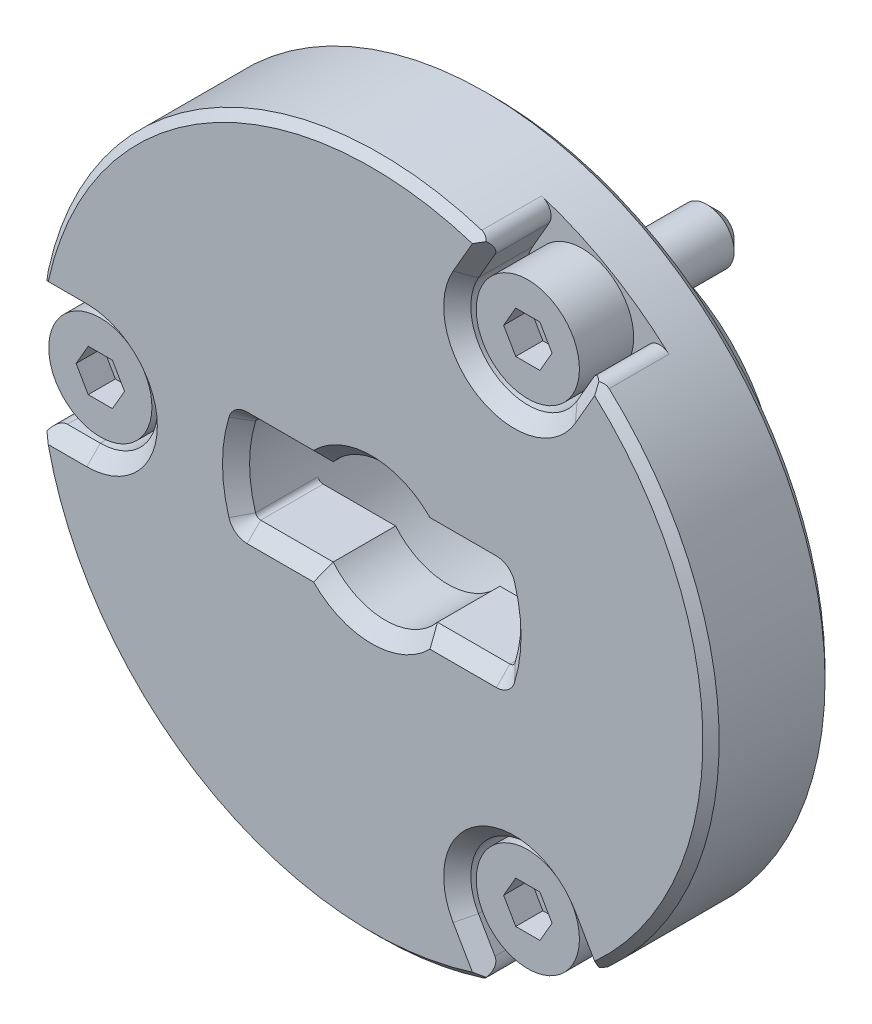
ISO-10303-21;
HEADER;
FILE_DESCRIPTION(('STEP AP214'),'2;1');
FILE_NAME('part.step','',(''),(''),'','','');
FILE_SCHEMA(('AUTOMOTIVE_DESIGN { 1 0 10303 214 1 1 1 1 }'));
ENDSEC;
DATA;
#1=APPLICATION_CONTEXT('core data for automotive mechanical design processes');
#2=APPLICATION_PROTOCOL_DEFINITION('international standard','automotive_design',2000,#1);
#3=PRODUCT_CONTEXT('',#1,'mechanical');
#4=PRODUCT('Part','Part','',(#3));
#5=PRODUCT_RELATED_PRODUCT_CATEGORY('part','',(#4));
#6=PRODUCT_DEFINITION_FORMATION('','',#4);
#7=PRODUCT_DEFINITION_CONTEXT('part definition',#1,'design');
#8=PRODUCT_DEFINITION('design','',#6,#7);
#9=PRODUCT_DEFINITION_SHAPE('','',#8);
#10=(LENGTH_UNIT() NAMED_UNIT(*) SI_UNIT(.MILLI.,.METRE.));
#11=(NAMED_UNIT(*) PLANE_ANGLE_UNIT() SI_UNIT($,.RADIAN.));
#12=(NAMED_UNIT(*) SI_UNIT($,.STERADIAN.) SOLID_ANGLE_UNIT());
#13=UNCERTAINTY_MEASURE_WITH_UNIT(LENGTH_MEASURE(1.E-05),#10,'distance_accuracy_value','');
#14=(GEOMETRIC_REPRESENTATION_CONTEXT(3) GLOBAL_UNCERTAINTY_ASSIGNED_CONTEXT((#13)) GLOBAL_UNIT_ASSIGNED_CONTEXT((#10,
#11,#12)) REPRESENTATION_CONTEXT('',''));
#15=CARTESIAN_POINT('',(0.,0.,0.));
#16=DIRECTION('',(0.,0.,1.));
#17=DIRECTION('',(1.,0.,0.));
#18=AXIS2_PLACEMENT_3D('',#15,#16,#17);
#19=CARTESIAN_POINT('',(-4.73708771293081,1.6,-0.384875));
#20=DIRECTION('',(0.,1.,0.));
#21=DIRECTION('',(-1.,0.,0.));
#22=AXIS2_PLACEMENT_3D('',#19,#20,#21);
#23=PLANE('',#22);
#24=DIRECTION('',(-1.,0.,0.));
#25=VECTOR('',#24,1.);
#26=CARTESIAN_POINT('',(-4.73708771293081,1.6,1.7));
#27=LINE('',#26,#25);
#28=CARTESIAN_POINT('',(-1.92093727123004,1.59999999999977,1.7));
#29=VERTEX_POINT('',#28);
#30=CARTESIAN_POINT('',(-4.5912961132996,1.6,1.7));
#31=VERTEX_POINT('',#30);
#32=EDGE_CURVE('E413',#29,#31,#27,.T.);
#33=ORIENTED_EDGE('',*,*,#32,.F.);
#34=DIRECTION('',(0.,0.,1.));
#35=VECTOR('',#34,1.);
#36=CARTESIAN_POINT('',(-1.92093727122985,1.6,-5.5));
#37=LINE('',#36,#35);
#38=CARTESIAN_POINT('',(-1.92093727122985,1.6,4.));
#39=VERTEX_POINT('',#38);
#40=EDGE_CURVE('E1029',#39,#29,#37,.F.);
#41=ORIENTED_EDGE('',*,*,#40,.F.);
#42=DIRECTION('',(-1.,0.,0.));
#43=VECTOR('',#42,1.);
#44=CARTESIAN_POINT('',(-4.5912961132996,1.6,4.));
#45=LINE('',#44,#43);
#46=CARTESIAN_POINT('',(-4.5912961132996,1.6,4.));
#47=VERTEX_POINT('',#46);
#48=EDGE_CURVE('E776',#39,#47,#45,.T.);
#49=ORIENTED_EDGE('',*,*,#48,.T.);
#50=DIRECTION('',(0.,0.,-1.));
#51=VECTOR('',#50,1.);
#52=CARTESIAN_POINT('',(-4.5912961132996,1.6,1.61225012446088));
#53=LINE('',#52,#51);
#54=EDGE_CURVE('E449',#47,#31,#53,.T.);
#55=ORIENTED_EDGE('',*,*,#54,.T.);
#56=EDGE_LOOP('',(#33,#41,#49,#55));
#57=FACE_BOUND('',#56,.T.);
#58=ADVANCED_FACE('F14',(#57),#23,.F.);
#59=CARTESIAN_POINT('',(-4.5912961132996,1.4,4.5));
#60=DIRECTION('',(0.,0.,1.));
#61=DIRECTION('',(0.,-1.,0.));
#62=AXIS2_PLACEMENT_3D('',#59,#60,#61);
#63=CYLINDRICAL_SURFACE('',#62,0.2);
#64=CARTESIAN_POINT('',(-4.5912961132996,1.4,1.7));
#65=DIRECTION('',(0.,0.,-1.));
#66=DIRECTION('',(-1.,0.,0.));
#67=AXIS2_PLACEMENT_3D('',#64,#65,#66);
#68=CIRCLE('',#67,0.2);
#69=CARTESIAN_POINT('',(-4.78260011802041,1.45833333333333,1.7));
#70=VERTEX_POINT('',#69);
#71=EDGE_CURVE('E407',#31,#70,#68,.F.);
#72=ORIENTED_EDGE('',*,*,#71,.F.);
#73=ORIENTED_EDGE('',*,*,#54,.F.);
#74=CARTESIAN_POINT('',(-4.5912961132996,1.4,4.));
#75=DIRECTION('',(0.,0.,1.));
#76=DIRECTION('',(0.,-1.,0.));
#77=AXIS2_PLACEMENT_3D('',#74,#75,#76);
#78=CIRCLE('',#77,0.2);
#79=CARTESIAN_POINT('',(-4.78260011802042,1.45833333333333,4.));
#80=VERTEX_POINT('',#79);
#81=EDGE_CURVE('E432',#47,#80,#78,.T.);
#82=ORIENTED_EDGE('',*,*,#81,.T.);
#83=DIRECTION('',(0.,0.,1.));
#84=VECTOR('',#83,1.);
#85=CARTESIAN_POINT('',(-4.78260011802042,1.45833333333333,4.5));
#86=LINE('',#85,#84);
#87=EDGE_CURVE('E424',#70,#80,#86,.T.);
#88=ORIENTED_EDGE('',*,*,#87,.F.);
#89=EDGE_LOOP('',(#72,#73,#82,#88));
#90=FACE_BOUND('',#89,.T.);
#91=ADVANCED_FACE('F430',(#90),#63,.F.);
#92=CARTESIAN_POINT('',(-4.5912961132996,-1.4,4.5));
#93=DIRECTION('',(0.,0.,1.));
#94=DIRECTION('',(0.,-1.,0.));
#95=AXIS2_PLACEMENT_3D('',#92,#93,#94);
#96=CYLINDRICAL_SURFACE('',#95,0.2);
#97=CARTESIAN_POINT('',(-4.5912961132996,-1.4,1.7));
#98=DIRECTION('',(0.,0.,-1.));
#99=DIRECTION('',(-1.,0.,0.));
#100=AXIS2_PLACEMENT_3D('',#97,#98,#99);
#101=CIRCLE('',#100,0.2);
#102=CARTESIAN_POINT('',(-4.78260011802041,-1.45833333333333,1.7));
#103=VERTEX_POINT('',#102);
#104=CARTESIAN_POINT('',(-4.5912961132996,-1.6,1.7));
#105=VERTEX_POINT('',#104);
#106=EDGE_CURVE('E761',#103,#105,#101,.F.);
#107=ORIENTED_EDGE('',*,*,#106,.F.);
#108=DIRECTION('',(0.,0.,1.));
#109=VECTOR('',#108,1.);
#110=CARTESIAN_POINT('',(-4.78260011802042,-1.45833333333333,4.5));
#111=LINE('',#110,#109);
#112=CARTESIAN_POINT('',(-4.78260011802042,-1.45833333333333,4.));
#113=VERTEX_POINT('',#112);
#114=EDGE_CURVE('E434',#113,#103,#111,.F.);
#115=ORIENTED_EDGE('',*,*,#114,.F.);
#116=CARTESIAN_POINT('',(-4.5912961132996,-1.4,4.));
#117=DIRECTION('',(0.,0.,1.));
#118=DIRECTION('',(0.,-1.,0.));
#119=AXIS2_PLACEMENT_3D('',#116,#117,#118);
#120=CIRCLE('',#119,0.2);
#121=CARTESIAN_POINT('',(-4.5912961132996,-1.6,4.));
#122=VERTEX_POINT('',#121);
#123=EDGE_CURVE('E748',#113,#122,#120,.T.);
#124=ORIENTED_EDGE('',*,*,#123,.T.);
#125=DIRECTION('',(0.,0.,-1.));
#126=VECTOR('',#125,1.);
#127=CARTESIAN_POINT('',(-4.5912961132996,-1.6,4.5));
#128=LINE('',#127,#126);
#129=EDGE_CURVE('E451',#105,#122,#128,.F.);
#130=ORIENTED_EDGE('',*,*,#129,.F.);
#131=EDGE_LOOP('',(#107,#115,#124,#130));
#132=FACE_BOUND('',#131,.T.);
#133=ADVANCED_FACE('F642',(#132),#96,.F.);
#134=CARTESIAN_POINT('',(-4.73708771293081,-1.6,-0.384875));
#135=DIRECTION('',(0.,-1.,0.));
#136=DIRECTION('',(1.,0.,0.));
#137=AXIS2_PLACEMENT_3D('',#134,#135,#136);
#138=PLANE('',#137);
#139=DIRECTION('',(1.,0.,0.));
#140=VECTOR('',#139,1.);
#141=CARTESIAN_POINT('',(-4.73708771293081,-1.6,1.7));
#142=LINE('',#141,#140);
#143=CARTESIAN_POINT('',(-1.92093727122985,-1.6,1.7));
#144=VERTEX_POINT('',#143);
#145=EDGE_CURVE('E1256',#105,#144,#142,.T.);
#146=ORIENTED_EDGE('',*,*,#145,.F.);
#147=ORIENTED_EDGE('',*,*,#129,.T.);
#148=DIRECTION('',(1.,0.,0.));
#149=VECTOR('',#148,1.);
#150=CARTESIAN_POINT('',(-2.53771550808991,-1.6,4.));
#151=LINE('',#150,#149);
#152=CARTESIAN_POINT('',(-1.92093727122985,-1.6,4.));
#153=VERTEX_POINT('',#152);
#154=EDGE_CURVE('E770',#122,#153,#151,.T.);
#155=ORIENTED_EDGE('',*,*,#154,.T.);
#156=DIRECTION('',(0.,0.,1.));
#157=VECTOR('',#156,1.);
#158=CARTESIAN_POINT('',(-1.92093727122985,-1.6,-5.5));
#159=LINE('',#158,#157);
#160=EDGE_CURVE('E1022',#144,#153,#159,.T.);
#161=ORIENTED_EDGE('',*,*,#160,.F.);
#162=EDGE_LOOP('',(#146,#147,#155,#161));
#163=FACE_BOUND('',#162,.T.);
#164=ADVANCED_FACE('F1254',(#163),#138,.F.);
#165=CARTESIAN_POINT('',(0.,0.,-5.5));
#166=DIRECTION('',(0.,0.,1.));
#167=DIRECTION('',(0.,-1.,0.));
#168=AXIS2_PLACEMENT_3D('',#165,#166,#167);
#169=CYLINDRICAL_SURFACE('',#168,2.5);
#170=CARTESIAN_POINT('',(0.,0.,1.7));
#171=DIRECTION('',(0.,0.,-1.));
#172=DIRECTION('',(-1.,0.,0.));
#173=AXIS2_PLACEMENT_3D('',#170,#171,#172);
#174=CIRCLE('',#173,2.5);
#175=CARTESIAN_POINT('',(1.92093727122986,-1.6,1.7));
#176=VERTEX_POINT('',#175);
#177=EDGE_CURVE('E1246',#144,#176,#174,.F.);
#178=ORIENTED_EDGE('',*,*,#177,.F.);
#179=ORIENTED_EDGE('',*,*,#160,.T.);
#180=CARTESIAN_POINT('',(0.,0.,4.));
#181=DIRECTION('',(0.,0.,1.));
#182=DIRECTION('',(0.,-1.,0.));
#183=AXIS2_PLACEMENT_3D('',#180,#181,#182);
#184=CIRCLE('',#183,2.5);
#185=CARTESIAN_POINT('',(1.92093727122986,-1.6,4.));
#186=VERTEX_POINT('',#185);
#187=EDGE_CURVE('E836',#153,#186,#184,.T.);
#188=ORIENTED_EDGE('',*,*,#187,.T.);
#189=DIRECTION('',(0.,0.,1.));
#190=VECTOR('',#189,1.);
#191=CARTESIAN_POINT('',(1.92093727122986,-1.6,-5.5));
#192=LINE('',#191,#190);
#193=EDGE_CURVE('E1019',#186,#176,#192,.F.);
#194=ORIENTED_EDGE('',*,*,#193,.T.);
#195=EDGE_LOOP('',(#178,#179,#188,#194));
#196=FACE_BOUND('',#195,.T.);
#197=ADVANCED_FACE('F1250',(#196),#169,.F.);
#198=DIRECTION('',(1.,0.,0.));
#199=VECTOR('',#198,1.);
#200=CARTESIAN_POINT('',(-4.73708771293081,-1.6,1.7));
#201=LINE('',#200,#199);
#202=CARTESIAN_POINT('',(4.5912961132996,-1.6,1.7));
#203=VERTEX_POINT('',#202);
#204=EDGE_CURVE('E30',#176,#203,#201,.T.);
#205=ORIENTED_EDGE('',*,*,#204,.F.);
#206=ORIENTED_EDGE('',*,*,#193,.F.);
#207=DIRECTION('',(1.,0.,0.));
#208=VECTOR('',#207,1.);
#209=CARTESIAN_POINT('',(4.5912961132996,-1.6,4.));
#210=LINE('',#209,#208);
#211=CARTESIAN_POINT('',(4.5912961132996,-1.6,4.));
#212=VERTEX_POINT('',#211);
#213=EDGE_CURVE('E1204',#186,#212,#210,.T.);
#214=ORIENTED_EDGE('',*,*,#213,.T.);
#215=DIRECTION('',(0.,0.,-1.));
#216=VECTOR('',#215,1.);
#217=CARTESIAN_POINT('',(4.5912961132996,-1.6,1.61225012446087));
#218=LINE('',#217,#216);
#219=EDGE_CURVE('E444',#212,#203,#218,.T.);
#220=ORIENTED_EDGE('',*,*,#219,.T.);
#221=EDGE_LOOP('',(#205,#206,#214,#220));
#222=FACE_BOUND('',#221,.T.);
#223=ADVANCED_FACE('F1245',(#222),#138,.F.);
#224=CARTESIAN_POINT('',(4.5912961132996,-1.4,4.5));
#225=DIRECTION('',(0.,0.,1.));
#226=DIRECTION('',(0.,-1.,0.));
#227=AXIS2_PLACEMENT_3D('',#224,#225,#226);
#228=CYLINDRICAL_SURFACE('',#227,0.2);
#229=CARTESIAN_POINT('',(4.5912961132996,-1.4,1.7));
#230=DIRECTION('',(0.,0.,-1.));
#231=DIRECTION('',(-1.,0.,0.));
#232=AXIS2_PLACEMENT_3D('',#229,#230,#231);
#233=CIRCLE('',#232,0.2);
#234=CARTESIAN_POINT('',(4.7826001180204,-1.45833333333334,1.7));
#235=VERTEX_POINT('',#234);
#236=EDGE_CURVE('E418',#203,#235,#233,.F.);
#237=ORIENTED_EDGE('',*,*,#236,.F.);
#238=ORIENTED_EDGE('',*,*,#219,.F.);
#239=CARTESIAN_POINT('',(4.5912961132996,-1.4,4.));
#240=DIRECTION('',(0.,0.,1.));
#241=DIRECTION('',(0.,-1.,0.));
#242=AXIS2_PLACEMENT_3D('',#239,#240,#241);
#243=CIRCLE('',#242,0.2);
#244=CARTESIAN_POINT('',(4.7826001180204,-1.45833333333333,4.));
#245=VERTEX_POINT('',#244);
#246=EDGE_CURVE('E1200',#212,#245,#243,.T.);
#247=ORIENTED_EDGE('',*,*,#246,.T.);
#248=DIRECTION('',(0.,0.,1.));
#249=VECTOR('',#248,1.);
#250=CARTESIAN_POINT('',(4.7826001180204,-1.45833333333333,4.5));
#251=LINE('',#250,#249);
#252=EDGE_CURVE('E436',#235,#245,#251,.T.);
#253=ORIENTED_EDGE('',*,*,#252,.F.);
#254=EDGE_LOOP('',(#237,#238,#247,#253));
#255=FACE_BOUND('',#254,.T.);
#256=ADVANCED_FACE('F656',(#255),#228,.F.);
#257=CARTESIAN_POINT('',(4.5912961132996,1.4,4.5));
#258=DIRECTION('',(0.,0.,1.));
#259=DIRECTION('',(0.,-1.,0.));
#260=AXIS2_PLACEMENT_3D('',#257,#258,#259);
#261=CYLINDRICAL_SURFACE('',#260,0.2);
#262=CARTESIAN_POINT('',(4.5912961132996,1.4,1.7));
#263=DIRECTION('',(0.,0.,-1.));
#264=DIRECTION('',(-1.,0.,0.));
#265=AXIS2_PLACEMENT_3D('',#262,#263,#264);
#266=CIRCLE('',#265,0.2);
#267=CARTESIAN_POINT('',(4.7826001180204,1.45833333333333,1.7));
#268=VERTEX_POINT('',#267);
#269=CARTESIAN_POINT('',(4.5912961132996,1.6,1.7));
#270=VERTEX_POINT('',#269);
#271=EDGE_CURVE('E664',#268,#270,#266,.F.);
#272=ORIENTED_EDGE('',*,*,#271,.F.);
#273=DIRECTION('',(0.,0.,1.));
#274=VECTOR('',#273,1.);
#275=CARTESIAN_POINT('',(4.7826001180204,1.45833333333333,4.5));
#276=LINE('',#275,#274);
#277=CARTESIAN_POINT('',(4.7826001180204,1.45833333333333,4.));
#278=VERTEX_POINT('',#277);
#279=EDGE_CURVE('E427',#278,#268,#276,.F.);
#280=ORIENTED_EDGE('',*,*,#279,.F.);
#281=CARTESIAN_POINT('',(4.5912961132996,1.4,4.));
#282=DIRECTION('',(0.,0.,1.));
#283=DIRECTION('',(0.,-1.,0.));
#284=AXIS2_PLACEMENT_3D('',#281,#282,#283);
#285=CIRCLE('',#284,0.2);
#286=CARTESIAN_POINT('',(4.5912961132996,1.6,4.));
#287=VERTEX_POINT('',#286);
#288=EDGE_CURVE('E667',#278,#287,#285,.T.);
#289=ORIENTED_EDGE('',*,*,#288,.T.);
#290=DIRECTION('',(0.,0.,-1.));
#291=VECTOR('',#290,1.);
#292=CARTESIAN_POINT('',(4.5912961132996,1.6,4.5));
#293=LINE('',#292,#291);
#294=EDGE_CURVE('E447',#270,#287,#293,.F.);
#295=ORIENTED_EDGE('',*,*,#294,.F.);
#296=EDGE_LOOP('',(#272,#280,#289,#295));
#297=FACE_BOUND('',#296,.T.);
#298=ADVANCED_FACE('F648',(#297),#261,.F.);
#299=DIRECTION('',(-1.,0.,0.));
#300=VECTOR('',#299,1.);
#301=CARTESIAN_POINT('',(-4.73708771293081,1.6,1.7));
#302=LINE('',#301,#300);
#303=CARTESIAN_POINT('',(1.92093727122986,1.6,1.7));
#304=VERTEX_POINT('',#303);
#305=EDGE_CURVE('E37',#270,#304,#302,.T.);
#306=ORIENTED_EDGE('',*,*,#305,.F.);
#307=ORIENTED_EDGE('',*,*,#294,.T.);
#308=DIRECTION('',(-1.,0.,0.));
#309=VECTOR('',#308,1.);
#310=CARTESIAN_POINT('',(2.53771550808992,1.6,4.));
#311=LINE('',#310,#309);
#312=CARTESIAN_POINT('',(1.92093727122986,1.6,4.));
#313=VERTEX_POINT('',#312);
#314=EDGE_CURVE('E687',#287,#313,#311,.T.);
#315=ORIENTED_EDGE('',*,*,#314,.T.);
#316=DIRECTION('',(0.,0.,1.));
#317=VECTOR('',#316,1.);
#318=CARTESIAN_POINT('',(1.92093727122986,1.6,-5.5));
#319=LINE('',#318,#317);
#320=EDGE_CURVE('E663',#304,#313,#319,.T.);
#321=ORIENTED_EDGE('',*,*,#320,.F.);
#322=EDGE_LOOP('',(#306,#307,#315,#321));
#323=FACE_BOUND('',#322,.T.);
#324=ADVANCED_FACE('F638',(#323),#23,.F.);
#325=CARTESIAN_POINT('',(0.,0.,-5.5));
#326=DIRECTION('',(0.,0.,1.));
#327=DIRECTION('',(0.,-1.,0.));
#328=AXIS2_PLACEMENT_3D('',#325,#326,#327);
#329=CYLINDRICAL_SURFACE('',#328,2.5);
#330=CARTESIAN_POINT('',(0.,0.,1.7));
#331=DIRECTION('',(0.,0.,-1.));
#332=DIRECTION('',(-1.,0.,0.));
#333=AXIS2_PLACEMENT_3D('',#330,#331,#332);
#334=CIRCLE('',#333,2.5);
#335=EDGE_CURVE('E9',#304,#29,#334,.F.);
#336=ORIENTED_EDGE('',*,*,#335,.F.);
#337=ORIENTED_EDGE('',*,*,#320,.T.);
#338=CARTESIAN_POINT('',(0.,0.,4.));
#339=DIRECTION('',(0.,0.,1.));
#340=DIRECTION('',(0.,-1.,0.));
#341=AXIS2_PLACEMENT_3D('',#338,#339,#340);
#342=CIRCLE('',#341,2.5);
#343=EDGE_CURVE('E845',#313,#39,#342,.T.);
#344=ORIENTED_EDGE('',*,*,#343,.T.);
#345=ORIENTED_EDGE('',*,*,#40,.T.);
#346=EDGE_LOOP('',(#336,#337,#344,#345));
#347=FACE_BOUND('',#346,.T.);
#348=ADVANCED_FACE('F647',(#347),#329,.F.);
#349=CARTESIAN_POINT('',(4.80399691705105,-8.32076673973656,3.));
#350=DIRECTION('',(0.,0.,1.));
#351=DIRECTION('',(0.866025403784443,0.500000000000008,0.));
#352=AXIS2_PLACEMENT_3D('',#349,#350,#351);
#353=PLANE('',#352);
#354=DIRECTION('',(-1.,0.,0.));
#355=VECTOR('',#354,1.);
#356=CARTESIAN_POINT('',(5.696003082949,-8.32076673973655,3.));
#357=LINE('',#356,#355);
#358=CARTESIAN_POINT('',(5.696003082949,-8.32076673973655,3.));
#359=VERTEX_POINT('',#358);
#360=CARTESIAN_POINT('',(4.80399691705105,-8.32076673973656,3.));
#361=VERTEX_POINT('',#360);
#362=EDGE_CURVE('E1264',#359,#361,#357,.T.);
#363=ORIENTED_EDGE('',*,*,#362,.T.);
#364=DIRECTION('',(-0.5,-0.866025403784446,0.));
#365=VECTOR('',#364,1.);
#366=CARTESIAN_POINT('',(4.80399691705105,-8.32076673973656,3.));
#367=LINE('',#366,#365);
#368=CARTESIAN_POINT('',(4.35799383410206,-9.09326673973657,3.));
#369=VERTEX_POINT('',#368);
#370=EDGE_CURVE('E1267',#361,#369,#367,.T.);
#371=ORIENTED_EDGE('',*,*,#370,.T.);
#372=DIRECTION('',(0.5,-0.866025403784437,0.));
#373=VECTOR('',#372,1.);
#374=CARTESIAN_POINT('',(4.35799383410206,-9.09326673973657,3.));
#375=LINE('',#374,#373);
#376=CARTESIAN_POINT('',(4.80399691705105,-9.86576673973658,3.));
#377=VERTEX_POINT('',#376);
#378=EDGE_CURVE('E1271',#369,#377,#375,.T.);
#379=ORIENTED_EDGE('',*,*,#378,.T.);
#380=DIRECTION('',(1.,0.,0.));
#381=VECTOR('',#380,1.);
#382=CARTESIAN_POINT('',(4.80399691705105,-9.86576673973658,3.));
#383=LINE('',#382,#381);
#384=CARTESIAN_POINT('',(5.696003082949,-9.86576673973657,3.));
#385=VERTEX_POINT('',#384);
#386=EDGE_CURVE('E1274',#377,#385,#383,.T.);
#387=ORIENTED_EDGE('',*,*,#386,.T.);
#388=DIRECTION('',(0.5,0.866025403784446,0.));
#389=VECTOR('',#388,1.);
#390=CARTESIAN_POINT('',(5.696003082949,-9.86576673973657,3.));
#391=LINE('',#390,#389);
#392=CARTESIAN_POINT('',(6.142006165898,-9.09326673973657,3.));
#393=VERTEX_POINT('',#392);
#394=EDGE_CURVE('E1277',#385,#393,#391,.T.);
#395=ORIENTED_EDGE('',*,*,#394,.T.);
#396=DIRECTION('',(-0.500000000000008,0.866025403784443,0.));
#397=VECTOR('',#396,1.);
#398=CARTESIAN_POINT('',(6.142006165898,-9.09326673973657,3.));
#399=LINE('',#398,#397);
#400=EDGE_CURVE('E1280',#393,#359,#399,.T.);
#401=ORIENTED_EDGE('',*,*,#400,.T.);
#402=EDGE_LOOP('',(#363,#371,#379,#387,#395,#401));
#403=FACE_BOUND('',#402,.T.);
#404=ADVANCED_FACE('F654',(#403),#353,.T.);
#405=CARTESIAN_POINT('',(4.35799383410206,-9.09326673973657,3.));
#406=DIRECTION('',(-0.866025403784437,-0.5,0.));
#407=DIRECTION('',(-0.5,0.866025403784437,0.));
#408=AXIS2_PLACEMENT_3D('',#405,#406,#407);
#409=PLANE('',#408);
#410=DIRECTION('',(0.5,-0.866025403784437,0.));
#411=VECTOR('',#410,1.);
#412=CARTESIAN_POINT('',(4.35799383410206,-9.09326673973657,4.));
#413=LINE('',#412,#411);
#414=CARTESIAN_POINT('',(4.35799383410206,-9.09326673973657,4.));
#415=VERTEX_POINT('',#414);
#416=CARTESIAN_POINT('',(4.80399691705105,-9.86576673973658,4.));
#417=VERTEX_POINT('',#416);
#418=EDGE_CURVE('E1289',#415,#417,#413,.T.);
#419=ORIENTED_EDGE('',*,*,#418,.T.);
#420=DIRECTION('',(0.,0.,1.));
#421=VECTOR('',#420,1.);
#422=CARTESIAN_POINT('',(4.80399691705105,-9.86576673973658,3.));
#423=LINE('',#422,#421);
#424=EDGE_CURVE('E1307',#377,#417,#423,.T.);
#425=ORIENTED_EDGE('',*,*,#424,.F.);
#426=ORIENTED_EDGE('',*,*,#378,.F.);
#427=DIRECTION('',(0.,0.,1.));
#428=VECTOR('',#427,1.);
#429=CARTESIAN_POINT('',(4.35799383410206,-9.09326673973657,3.));
#430=LINE('',#429,#428);
#431=EDGE_CURVE('E1309',#369,#415,#430,.T.);
#432=ORIENTED_EDGE('',*,*,#431,.T.);
#433=EDGE_LOOP('',(#419,#425,#426,#432));
#434=FACE_BOUND('',#433,.T.);
#435=ADVANCED_FACE('F1618',(#434),#409,.F.);
#436=CARTESIAN_POINT('',(4.80399691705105,-9.86576673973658,3.));
#437=DIRECTION('',(0.,-1.,0.));
#438=DIRECTION('',(-1.,0.,0.));
#439=AXIS2_PLACEMENT_3D('',#436,#437,#438);
#440=PLANE('',#439);
#441=DIRECTION('',(1.,0.,0.));
#442=VECTOR('',#441,1.);
#443=CARTESIAN_POINT('',(4.80399691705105,-9.86576673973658,4.));
#444=LINE('',#443,#442);
#445=CARTESIAN_POINT('',(5.696003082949,-9.86576673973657,4.));
#446=VERTEX_POINT('',#445);
#447=EDGE_CURVE('E1292',#417,#446,#444,.T.);
#448=ORIENTED_EDGE('',*,*,#447,.T.);
#449=DIRECTION('',(0.,0.,1.));
#450=VECTOR('',#449,1.);
#451=CARTESIAN_POINT('',(5.696003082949,-9.86576673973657,3.));
#452=LINE('',#451,#450);
#453=EDGE_CURVE('E1305',#385,#446,#452,.T.);
#454=ORIENTED_EDGE('',*,*,#453,.F.);
#455=ORIENTED_EDGE('',*,*,#386,.F.);
#456=ORIENTED_EDGE('',*,*,#424,.T.);
#457=EDGE_LOOP('',(#448,#454,#455,#456));
#458=FACE_BOUND('',#457,.T.);
#459=ADVANCED_FACE('F1621',(#458),#440,.F.);
#460=CARTESIAN_POINT('',(5.696003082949,-9.86576673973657,3.));
#461=DIRECTION('',(0.866025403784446,-0.5,0.));
#462=DIRECTION('',(-0.5,-0.866025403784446,0.));
#463=AXIS2_PLACEMENT_3D('',#460,#461,#462);
#464=PLANE('',#463);
#465=DIRECTION('',(0.5,0.866025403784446,0.));
#466=VECTOR('',#465,1.);
#467=CARTESIAN_POINT('',(5.696003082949,-9.86576673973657,4.));
#468=LINE('',#467,#466);
#469=CARTESIAN_POINT('',(6.142006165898,-9.09326673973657,4.));
#470=VERTEX_POINT('',#469);
#471=EDGE_CURVE('E1295',#446,#470,#468,.T.);
#472=ORIENTED_EDGE('',*,*,#471,.T.);
#473=DIRECTION('',(0.,0.,1.));
#474=VECTOR('',#473,1.);
#475=CARTESIAN_POINT('',(6.142006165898,-9.09326673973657,3.));
#476=LINE('',#475,#474);
#477=EDGE_CURVE('E1303',#393,#470,#476,.T.);
#478=ORIENTED_EDGE('',*,*,#477,.F.);
#479=ORIENTED_EDGE('',*,*,#394,.F.);
#480=ORIENTED_EDGE('',*,*,#453,.T.);
#481=EDGE_LOOP('',(#472,#478,#479,#480));
#482=FACE_BOUND('',#481,.T.);
#483=ADVANCED_FACE('F1625',(#482),#464,.F.);
#484=CARTESIAN_POINT('',(6.142006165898,-9.09326673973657,3.));
#485=DIRECTION('',(0.866025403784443,0.500000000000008,0.));
#486=DIRECTION('',(0.500000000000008,-0.866025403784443,0.));
#487=AXIS2_PLACEMENT_3D('',#484,#485,#486);
#488=PLANE('',#487);
#489=DIRECTION('',(-0.500000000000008,0.866025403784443,0.));
#490=VECTOR('',#489,1.);
#491=CARTESIAN_POINT('',(6.142006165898,-9.09326673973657,4.));
#492=LINE('',#491,#490);
#493=CARTESIAN_POINT('',(5.696003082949,-8.32076673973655,4.));
#494=VERTEX_POINT('',#493);
#495=EDGE_CURVE('E1268',#470,#494,#492,.T.);
#496=ORIENTED_EDGE('',*,*,#495,.T.);
#497=DIRECTION('',(0.,0.,1.));
#498=VECTOR('',#497,1.);
#499=CARTESIAN_POINT('',(5.696003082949,-8.32076673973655,3.));
#500=LINE('',#499,#498);
#501=EDGE_CURVE('E1300',#359,#494,#500,.T.);
#502=ORIENTED_EDGE('',*,*,#501,.F.);
#503=ORIENTED_EDGE('',*,*,#400,.F.);
#504=ORIENTED_EDGE('',*,*,#477,.T.);
#505=EDGE_LOOP('',(#496,#502,#503,#504));
#506=FACE_BOUND('',#505,.T.);
#507=ADVANCED_FACE('F1613',(#506),#488,.F.);
#508=CARTESIAN_POINT('',(5.696003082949,-8.32076673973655,3.));
#509=DIRECTION('',(0.,1.,0.));
#510=DIRECTION('',(1.,0.,0.));
#511=AXIS2_PLACEMENT_3D('',#508,#509,#510);
#512=PLANE('',#511);
#513=DIRECTION('',(-1.,0.,0.));
#514=VECTOR('',#513,1.);
#515=CARTESIAN_POINT('',(5.696003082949,-8.32076673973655,4.));
#516=LINE('',#515,#514);
#517=CARTESIAN_POINT('',(4.80399691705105,-8.32076673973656,4.));
#518=VERTEX_POINT('',#517);
#519=EDGE_CURVE('E1284',#494,#518,#516,.T.);
#520=ORIENTED_EDGE('',*,*,#519,.T.);
#521=DIRECTION('',(0.,0.,1.));
#522=VECTOR('',#521,1.);
#523=CARTESIAN_POINT('',(4.80399691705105,-8.32076673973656,3.));
#524=LINE('',#523,#522);
#525=EDGE_CURVE('E1283',#361,#518,#524,.T.);
#526=ORIENTED_EDGE('',*,*,#525,.F.);
#527=ORIENTED_EDGE('',*,*,#362,.F.);
#528=ORIENTED_EDGE('',*,*,#501,.T.);
#529=EDGE_LOOP('',(#520,#526,#527,#528));
#530=FACE_BOUND('',#529,.T.);
#531=ADVANCED_FACE('F1610',(#530),#512,.F.);
#532=CARTESIAN_POINT('',(4.80399691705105,-8.32076673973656,3.));
#533=DIRECTION('',(-0.866025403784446,0.5,0.));
#534=DIRECTION('',(0.5,0.866025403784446,0.));
#535=AXIS2_PLACEMENT_3D('',#532,#533,#534);
#536=PLANE('',#535);
#537=DIRECTION('',(-0.5,-0.866025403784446,0.));
#538=VECTOR('',#537,1.);
#539=CARTESIAN_POINT('',(4.80399691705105,-8.32076673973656,4.));
#540=LINE('',#539,#538);
#541=EDGE_CURVE('E1286',#518,#415,#540,.T.);
#542=ORIENTED_EDGE('',*,*,#541,.T.);
#543=ORIENTED_EDGE('',*,*,#431,.F.);
#544=ORIENTED_EDGE('',*,*,#370,.F.);
#545=ORIENTED_EDGE('',*,*,#525,.T.);
#546=EDGE_LOOP('',(#542,#543,#544,#545));
#547=FACE_BOUND('',#546,.T.);
#548=ADVANCED_FACE('F1602',(#547),#536,.F.);
#549=CARTESIAN_POINT('',(5.25,-9.09326673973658,4.));
#550=DIRECTION('',(0.,0.,-1.));
#551=DIRECTION('',(-0.866025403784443,-0.500000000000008,0.));
#552=AXIS2_PLACEMENT_3D('',#549,#550,#551);
#553=PLANE('',#552);
#554=ORIENTED_EDGE('',*,*,#541,.F.);
#555=ORIENTED_EDGE('',*,*,#519,.F.);
#556=ORIENTED_EDGE('',*,*,#495,.F.);
#557=ORIENTED_EDGE('',*,*,#471,.F.);
#558=ORIENTED_EDGE('',*,*,#447,.F.);
#559=ORIENTED_EDGE('',*,*,#418,.F.);
#560=EDGE_LOOP('',(#554,#555,#556,#557,#558,#559));
#561=FACE_BOUND('',#560,.T.);
#562=CARTESIAN_POINT('',(5.25,-9.09326673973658,4.));
#563=DIRECTION('',(0.,0.,-1.));
#564=DIRECTION('',(-0.866025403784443,-0.500000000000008,0.));
#565=AXIS2_PLACEMENT_3D('',#562,#563,#564);
#566=CIRCLE('',#565,1.9);
#567=CARTESIAN_POINT('',(3.60455173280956,-10.0432667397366,4.));
#568=VERTEX_POINT('',#567);
#569=EDGE_CURVE('E1316',#568,#568,#566,.T.);
#570=ORIENTED_EDGE('',*,*,#569,.F.);
#571=EDGE_LOOP('',(#570));
#572=FACE_BOUND('',#571,.T.);
#573=ADVANCED_FACE('F1595',(#561,#572),#553,.F.);
#574=CARTESIAN_POINT('',(5.25,-9.09326673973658,4.));
#575=DIRECTION('',(0.,0.,-1.));
#576=DIRECTION('',(-0.866025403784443,-0.500000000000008,0.));
#577=AXIS2_PLACEMENT_3D('',#574,#575,#576);
#578=CYLINDRICAL_SURFACE('',#577,1.9);
#579=ORIENTED_EDGE('',*,*,#569,.T.);
#580=EDGE_LOOP('',(#579));
#581=FACE_BOUND('',#580,.T.);
#582=CARTESIAN_POINT('',(5.25,-9.09326673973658,2.));
#583=DIRECTION('',(0.,0.,-1.));
#584=DIRECTION('',(-0.866025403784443,-0.500000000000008,0.));
#585=AXIS2_PLACEMENT_3D('',#582,#583,#584);
#586=CIRCLE('',#585,1.9);
#587=CARTESIAN_POINT('',(3.60455173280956,-10.0432667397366,2.));
#588=VERTEX_POINT('',#587);
#589=EDGE_CURVE('E1315',#588,#588,#586,.T.);
#590=ORIENTED_EDGE('',*,*,#589,.F.);
#591=EDGE_LOOP('',(#590));
#592=FACE_BOUND('',#591,.T.);
#593=ADVANCED_FACE('F1591',(#581,#592),#578,.T.);
#594=CARTESIAN_POINT('',(5.25,-9.09326673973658,2.));
#595=DIRECTION('',(0.,0.,-1.));
#596=DIRECTION('',(-0.866025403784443,-0.500000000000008,0.));
#597=AXIS2_PLACEMENT_3D('',#594,#595,#596);
#598=PLANE('',#597);
#599=CARTESIAN_POINT('',(5.25,-9.09326673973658,2.));
#600=DIRECTION('',(0.,0.,1.));
#601=DIRECTION('',(0.866025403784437,0.5,0.));
#602=AXIS2_PLACEMENT_3D('',#599,#600,#601);
#603=CIRCLE('',#602,1.2);
#604=CARTESIAN_POINT('',(6.28923048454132,-8.49326673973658,2.));
#605=VERTEX_POINT('',#604);
#606=EDGE_CURVE('E23',#605,#605,#603,.T.);
#607=ORIENTED_EDGE('',*,*,#606,.F.);
#608=EDGE_LOOP('',(#607));
#609=FACE_BOUND('',#608,.T.);
#610=CARTESIAN_POINT('',(5.25,-9.09326673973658,2.));
#611=DIRECTION('',(0.,0.,-1.));
#612=DIRECTION('',(-0.866025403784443,-0.500000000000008,0.));
#613=AXIS2_PLACEMENT_3D('',#610,#611,#612);
#614=CIRCLE('',#613,1.);
#615=CARTESIAN_POINT('',(4.38397459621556,-9.59326673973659,2.));
#616=VERTEX_POINT('',#615);
#617=EDGE_CURVE('E1302',#616,#616,#614,.T.);
#618=ORIENTED_EDGE('',*,*,#617,.F.);
#619=EDGE_LOOP('',(#618));
#620=FACE_BOUND('',#619,.T.);
#621=ADVANCED_FACE('F1594',(#609,#620),#598,.T.);
#622=CARTESIAN_POINT('',(5.25,-9.09326673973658,-3.));
#623=DIRECTION('',(0.,0.,1.));
#624=DIRECTION('',(0.866025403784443,0.500000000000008,0.));
#625=AXIS2_PLACEMENT_3D('',#622,#623,#624);
#626=CYLINDRICAL_SURFACE('',#625,1.);
#627=CARTESIAN_POINT('',(5.25,-9.09326673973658,-2.6));
#628=DIRECTION('',(0.,0.,-1.));
#629=DIRECTION('',(-0.866025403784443,-0.500000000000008,0.));
#630=AXIS2_PLACEMENT_3D('',#627,#628,#629);
#631=CIRCLE('',#630,1.);
#632=CARTESIAN_POINT('',(4.38397459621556,-9.59326673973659,-2.6));
#633=VERTEX_POINT('',#632);
#634=EDGE_CURVE('E963',#633,#633,#631,.F.);
#635=ORIENTED_EDGE('',*,*,#634,.T.);
#636=EDGE_LOOP('',(#635));
#637=FACE_BOUND('',#636,.T.);
#638=ORIENTED_EDGE('',*,*,#617,.T.);
#639=EDGE_LOOP('',(#638));
#640=FACE_BOUND('',#639,.T.);
#641=ADVANCED_FACE('F1599',(#637,#640),#626,.T.);
#642=CARTESIAN_POINT('',(5.25,-9.09326673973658,-3.));
#643=DIRECTION('',(0.,0.,-1.));
#644=DIRECTION('',(-0.866025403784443,-0.500000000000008,0.));
#645=AXIS2_PLACEMENT_3D('',#642,#643,#644);
#646=PLANE('',#645);
#647=CARTESIAN_POINT('',(5.25,-9.09326673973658,-3.));
#648=DIRECTION('',(0.,0.,-1.));
#649=DIRECTION('',(-0.866025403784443,-0.500000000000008,0.));
#650=AXIS2_PLACEMENT_3D('',#647,#648,#649);
#651=CIRCLE('',#650,0.6);
#652=CARTESIAN_POINT('',(4.73038475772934,-9.39326673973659,-3.));
#653=VERTEX_POINT('',#652);
#654=EDGE_CURVE('E966',#653,#653,#651,.T.);
#655=ORIENTED_EDGE('',*,*,#654,.T.);
#656=EDGE_LOOP('',(#655));
#657=FACE_BOUND('',#656,.T.);
#658=ADVANCED_FACE('F1589',(#657),#646,.T.);
#659=CARTESIAN_POINT('',(5.25,-9.09326673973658,-3.));
#660=DIRECTION('',(0.,0.,1.));
#661=DIRECTION('',(0.866025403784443,0.500000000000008,0.));
#662=AXIS2_PLACEMENT_3D('',#659,#660,#661);
#663=CONICAL_SURFACE('',#662,0.6,0.785398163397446);
#664=ORIENTED_EDGE('',*,*,#634,.F.);
#665=EDGE_LOOP('',(#664));
#666=FACE_BOUND('',#665,.T.);
#667=ORIENTED_EDGE('',*,*,#654,.F.);
#668=EDGE_LOOP('',(#667));
#669=FACE_BOUND('',#668,.T.);
#670=ADVANCED_FACE('F1515',(#666,#669),#663,.T.);
#671=CARTESIAN_POINT('',(-10.5,0.,-3.));
#672=DIRECTION('',(0.,0.,-1.));
#673=DIRECTION('',(0.,1.,0.));
#674=AXIS2_PLACEMENT_3D('',#671,#672,#673);
#675=PLANE('',#674);
#676=CARTESIAN_POINT('',(-10.5,0.,-3.));
#677=DIRECTION('',(0.,0.,-1.));
#678=DIRECTION('',(0.,1.,0.));
#679=AXIS2_PLACEMENT_3D('',#676,#677,#678);
#680=CIRCLE('',#679,0.6);
#681=CARTESIAN_POINT('',(-10.5,0.6,-3.));
#682=VERTEX_POINT('',#681);
#683=EDGE_CURVE('E1441',#682,#682,#680,.T.);
#684=ORIENTED_EDGE('',*,*,#683,.T.);
#685=EDGE_LOOP('',(#684));
#686=FACE_BOUND('',#685,.T.);
#687=ADVANCED_FACE('F1496',(#686),#675,.T.);
#688=CARTESIAN_POINT('',(5.25,9.09326673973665,-3.));
#689=DIRECTION('',(0.,0.,-1.));
#690=DIRECTION('',(0.86602540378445,-0.5,0.));
#691=AXIS2_PLACEMENT_3D('',#688,#689,#690);
#692=PLANE('',#691);
#693=CARTESIAN_POINT('',(5.25,9.09326673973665,-3.));
#694=DIRECTION('',(0.,0.,-1.));
#695=DIRECTION('',(0.86602540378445,-0.5,0.));
#696=AXIS2_PLACEMENT_3D('',#693,#694,#695);
#697=CIRCLE('',#696,0.6);
#698=CARTESIAN_POINT('',(5.76961524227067,8.79326673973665,-3.));
#699=VERTEX_POINT('',#698);
#700=EDGE_CURVE('E1379',#699,#699,#697,.T.);
#701=ORIENTED_EDGE('',*,*,#700,.T.);
#702=EDGE_LOOP('',(#701));
#703=FACE_BOUND('',#702,.T.);
#704=ADVANCED_FACE('F1493',(#703),#692,.T.);
#705=CARTESIAN_POINT('',(-10.5,0.,-3.));
#706=DIRECTION('',(0.,0.,1.));
#707=DIRECTION('',(0.,-1.,0.));
#708=AXIS2_PLACEMENT_3D('',#705,#706,#707);
#709=CONICAL_SURFACE('',#708,0.6,0.785398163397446);
#710=CARTESIAN_POINT('',(-10.5,0.,-2.6));
#711=DIRECTION('',(0.,0.,-1.));
#712=DIRECTION('',(0.,1.,0.));
#713=AXIS2_PLACEMENT_3D('',#710,#711,#712);
#714=CIRCLE('',#713,1.);
#715=CARTESIAN_POINT('',(-10.5,1.,-2.6));
#716=VERTEX_POINT('',#715);
#717=EDGE_CURVE('E1446',#716,#716,#714,.F.);
#718=ORIENTED_EDGE('',*,*,#717,.F.);
#719=EDGE_LOOP('',(#718));
#720=FACE_BOUND('',#719,.T.);
#721=ORIENTED_EDGE('',*,*,#683,.F.);
#722=EDGE_LOOP('',(#721));
#723=FACE_BOUND('',#722,.T.);
#724=ADVANCED_FACE('F1489',(#720,#723),#709,.T.);
#725=CARTESIAN_POINT('',(5.25,9.09326673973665,-3.));
#726=DIRECTION('',(0.,0.,1.));
#727=DIRECTION('',(-0.86602540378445,0.5,0.));
#728=AXIS2_PLACEMENT_3D('',#725,#726,#727);
#729=CONICAL_SURFACE('',#728,0.6,0.785398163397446);
#730=CARTESIAN_POINT('',(5.25,9.09326673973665,-2.6));
#731=DIRECTION('',(0.,0.,-1.));
#732=DIRECTION('',(0.86602540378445,-0.5,0.));
#733=AXIS2_PLACEMENT_3D('',#730,#731,#732);
#734=CIRCLE('',#733,1.);
#735=CARTESIAN_POINT('',(6.11602540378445,8.59326673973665,-2.6));
#736=VERTEX_POINT('',#735);
#737=EDGE_CURVE('E1384',#736,#736,#734,.F.);
#738=ORIENTED_EDGE('',*,*,#737,.F.);
#739=EDGE_LOOP('',(#738));
#740=FACE_BOUND('',#739,.T.);
#741=ORIENTED_EDGE('',*,*,#700,.F.);
#742=EDGE_LOOP('',(#741));
#743=FACE_BOUND('',#742,.T.);
#744=ADVANCED_FACE('F1492',(#740,#743),#729,.T.);
#745=CARTESIAN_POINT('',(-10.5,0.,-3.));
#746=DIRECTION('',(0.,0.,1.));
#747=DIRECTION('',(0.,-1.,0.));
#748=AXIS2_PLACEMENT_3D('',#745,#746,#747);
#749=CYLINDRICAL_SURFACE('',#748,1.);
#750=ORIENTED_EDGE('',*,*,#717,.T.);
#751=EDGE_LOOP('',(#750));
#752=FACE_BOUND('',#751,.T.);
#753=CARTESIAN_POINT('',(-10.5,0.,2.));
#754=DIRECTION('',(0.,0.,-1.));
#755=DIRECTION('',(0.,1.,0.));
#756=AXIS2_PLACEMENT_3D('',#753,#754,#755);
#757=CIRCLE('',#756,1.);
#758=CARTESIAN_POINT('',(-10.5,1.,2.));
#759=VERTEX_POINT('',#758);
#760=EDGE_CURVE('E1424',#759,#759,#757,.T.);
#761=ORIENTED_EDGE('',*,*,#760,.T.);
#762=EDGE_LOOP('',(#761));
#763=FACE_BOUND('',#762,.T.);
#764=ADVANCED_FACE('F1504',(#752,#763),#749,.T.);
#765=CARTESIAN_POINT('',(5.25,9.09326673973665,-3.));
#766=DIRECTION('',(0.,0.,1.));
#767=DIRECTION('',(-0.86602540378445,0.5,0.));
#768=AXIS2_PLACEMENT_3D('',#765,#766,#767);
#769=CYLINDRICAL_SURFACE('',#768,1.);
#770=ORIENTED_EDGE('',*,*,#737,.T.);
#771=EDGE_LOOP('',(#770));
#772=FACE_BOUND('',#771,.T.);
#773=CARTESIAN_POINT('',(5.25,9.09326673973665,2.));
#774=DIRECTION('',(0.,0.,-1.));
#775=DIRECTION('',(0.86602540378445,-0.5,0.));
#776=AXIS2_PLACEMENT_3D('',#773,#774,#775);
#777=CIRCLE('',#776,1.);
#778=CARTESIAN_POINT('',(6.11602540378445,8.59326673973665,2.));
#779=VERTEX_POINT('',#778);
#780=EDGE_CURVE('E1362',#779,#779,#777,.T.);
#781=ORIENTED_EDGE('',*,*,#780,.T.);
#782=EDGE_LOOP('',(#781));
#783=FACE_BOUND('',#782,.T.);
#784=ADVANCED_FACE('F1511',(#772,#783),#769,.T.);
#785=CARTESIAN_POINT('',(4.8039969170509,8.32076673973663,3.));
#786=DIRECTION('',(0.,0.,1.));
#787=DIRECTION('',(-0.86602540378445,0.5,0.));
#788=AXIS2_PLACEMENT_3D('',#785,#786,#787);
#789=PLANE('',#788);
#790=DIRECTION('',(0.500000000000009,-0.866025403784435,0.));
#791=VECTOR('',#790,1.);
#792=CARTESIAN_POINT('',(4.35799383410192,9.09326673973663,3.));
#793=LINE('',#792,#791);
#794=CARTESIAN_POINT('',(4.35799383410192,9.09326673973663,3.));
#795=VERTEX_POINT('',#794);
#796=CARTESIAN_POINT('',(4.8039969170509,8.32076673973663,3.));
#797=VERTEX_POINT('',#796);
#798=EDGE_CURVE('E1323',#795,#797,#793,.T.);
#799=ORIENTED_EDGE('',*,*,#798,.T.);
#800=DIRECTION('',(1.,0.,0.));
#801=VECTOR('',#800,1.);
#802=CARTESIAN_POINT('',(4.8039969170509,8.32076673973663,3.));
#803=LINE('',#802,#801);
#804=CARTESIAN_POINT('',(5.6960030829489,8.32076673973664,3.));
#805=VERTEX_POINT('',#804);
#806=EDGE_CURVE('E1326',#797,#805,#803,.T.);
#807=ORIENTED_EDGE('',*,*,#806,.T.);
#808=DIRECTION('',(0.499999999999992,0.866025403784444,0.));
#809=VECTOR('',#808,1.);
#810=CARTESIAN_POINT('',(5.6960030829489,8.32076673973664,3.));
#811=LINE('',#810,#809);
#812=CARTESIAN_POINT('',(6.1420061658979,9.09326673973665,3.));
#813=VERTEX_POINT('',#812);
#814=EDGE_CURVE('E1330',#805,#813,#811,.T.);
#815=ORIENTED_EDGE('',*,*,#814,.T.);
#816=DIRECTION('',(-0.500000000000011,0.866025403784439,0.));
#817=VECTOR('',#816,1.);
#818=CARTESIAN_POINT('',(6.1420061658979,9.09326673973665,3.));
#819=LINE('',#818,#817);
#820=CARTESIAN_POINT('',(5.6960030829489,9.86576673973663,3.));
#821=VERTEX_POINT('',#820);
#822=EDGE_CURVE('E1333',#813,#821,#819,.T.);
#823=ORIENTED_EDGE('',*,*,#822,.T.);
#824=DIRECTION('',(-1.,0.,0.));
#825=VECTOR('',#824,1.);
#826=CARTESIAN_POINT('',(5.6960030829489,9.86576673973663,3.));
#827=LINE('',#826,#825);
#828=CARTESIAN_POINT('',(4.8039969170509,9.86576673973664,3.));
#829=VERTEX_POINT('',#828);
#830=EDGE_CURVE('E1336',#821,#829,#827,.T.);
#831=ORIENTED_EDGE('',*,*,#830,.T.);
#832=DIRECTION('',(-0.5,-0.866025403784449,0.));
#833=VECTOR('',#832,1.);
#834=CARTESIAN_POINT('',(4.8039969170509,9.86576673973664,3.));
#835=LINE('',#834,#833);
#836=EDGE_CURVE('E1339',#829,#795,#835,.T.);
#837=ORIENTED_EDGE('',*,*,#836,.T.);
#838=EDGE_LOOP('',(#799,#807,#815,#823,#831,#837));
#839=FACE_BOUND('',#838,.T.);
#840=ADVANCED_FACE('F1495',(#839),#789,.T.);
#841=CARTESIAN_POINT('',(-9.607993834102,0.,3.));
#842=DIRECTION('',(0.,0.,1.));
#843=DIRECTION('',(0.,-1.,0.));
#844=AXIS2_PLACEMENT_3D('',#841,#842,#843);
#845=PLANE('',#844);
#846=DIRECTION('',(0.5,0.86602540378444,0.));
#847=VECTOR('',#846,1.);
#848=CARTESIAN_POINT('',(-10.053996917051,-0.772500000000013,3.));
#849=LINE('',#848,#847);
#850=CARTESIAN_POINT('',(-10.053996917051,-0.772500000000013,3.));
#851=VERTEX_POINT('',#850);
#852=CARTESIAN_POINT('',(-9.607993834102,0.,3.));
#853=VERTEX_POINT('',#852);
#854=EDGE_CURVE('E1387',#851,#853,#849,.T.);
#855=ORIENTED_EDGE('',*,*,#854,.T.);
#856=DIRECTION('',(-0.5,0.866025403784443,0.));
#857=VECTOR('',#856,1.);
#858=CARTESIAN_POINT('',(-9.607993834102,0.,3.));
#859=LINE('',#858,#857);
#860=CARTESIAN_POINT('',(-10.053996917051,0.7725,3.));
#861=VERTEX_POINT('',#860);
#862=EDGE_CURVE('E1390',#853,#861,#859,.T.);
#863=ORIENTED_EDGE('',*,*,#862,.T.);
#864=DIRECTION('',(-1.,0.,0.));
#865=VECTOR('',#864,1.);
#866=CARTESIAN_POINT('',(-10.053996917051,0.7725,3.));
#867=LINE('',#866,#865);
#868=CARTESIAN_POINT('',(-10.946003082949,0.7725,3.));
#869=VERTEX_POINT('',#868);
#870=EDGE_CURVE('E1394',#861,#869,#867,.T.);
#871=ORIENTED_EDGE('',*,*,#870,.T.);
#872=DIRECTION('',(-0.5,-0.866025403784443,0.));
#873=VECTOR('',#872,1.);
#874=CARTESIAN_POINT('',(-10.946003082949,0.7725,3.));
#875=LINE('',#874,#873);
#876=CARTESIAN_POINT('',(-11.3920061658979,0.,3.));
#877=VERTEX_POINT('',#876);
#878=EDGE_CURVE('E1397',#869,#877,#875,.T.);
#879=ORIENTED_EDGE('',*,*,#878,.T.);
#880=DIRECTION('',(0.5,-0.866025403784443,0.));
#881=VECTOR('',#880,1.);
#882=CARTESIAN_POINT('',(-11.3920061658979,0.,3.));
#883=LINE('',#882,#881);
#884=CARTESIAN_POINT('',(-10.946003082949,-0.7725,3.));
#885=VERTEX_POINT('',#884);
#886=EDGE_CURVE('E1400',#877,#885,#883,.T.);
#887=ORIENTED_EDGE('',*,*,#886,.T.);
#888=DIRECTION('',(1.,0.,0.));
#889=VECTOR('',#888,1.);
#890=CARTESIAN_POINT('',(-10.946003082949,-0.7725,3.));
#891=LINE('',#890,#889);
#892=EDGE_CURVE('E1403',#885,#851,#891,.T.);
#893=ORIENTED_EDGE('',*,*,#892,.T.);
#894=EDGE_LOOP('',(#855,#863,#871,#879,#887,#893));
#895=FACE_BOUND('',#894,.T.);
#896=ADVANCED_FACE('F725',(#895),#845,.T.);
#897=CARTESIAN_POINT('',(7.,0.,-4.5));
#898=DIRECTION('',(0.,0.,1.));
#899=DIRECTION('',(0.,-1.,0.));
#900=AXIS2_PLACEMENT_3D('',#897,#898,#899);
#901=PLANE('',#900);
#902=CARTESIAN_POINT('',(0.,0.,-4.5));
#903=DIRECTION('',(0.,0.,1.));
#904=DIRECTION('',(0.,-1.,0.));
#905=AXIS2_PLACEMENT_3D('',#902,#903,#904);
#906=CIRCLE('',#905,6.);
#907=CARTESIAN_POINT('',(0.,-6.,-4.5));
#908=VERTEX_POINT('',#907);
#909=EDGE_CURVE('E833',#908,#908,#906,.F.);
#910=ORIENTED_EDGE('',*,*,#909,.T.);
#911=EDGE_LOOP('',(#910));
#912=FACE_BOUND('',#911,.T.);
#913=CARTESIAN_POINT('',(0.,0.,-4.5));
#914=DIRECTION('',(0.,0.,1.));
#915=DIRECTION('',(0.,-1.,0.));
#916=AXIS2_PLACEMENT_3D('',#913,#914,#915);
#917=CIRCLE('',#916,5.);
#918=CARTESIAN_POINT('',(0.,-5.,-4.5));
#919=VERTEX_POINT('',#918);
#920=EDGE_CURVE('E1024',#919,#919,#917,.T.);
#921=ORIENTED_EDGE('',*,*,#920,.T.);
#922=EDGE_LOOP('',(#921));
#923=FACE_BOUND('',#922,.T.);
#924=ADVANCED_FACE('F1502',(#912,#923),#901,.F.);
#925=CARTESIAN_POINT('',(-10.5,0.,2.));
#926=DIRECTION('',(0.,0.,-1.));
#927=DIRECTION('',(0.,1.,0.));
#928=AXIS2_PLACEMENT_3D('',#925,#926,#927);
#929=PLANE('',#928);
#930=ORIENTED_EDGE('',*,*,#760,.F.);
#931=EDGE_LOOP('',(#930));
#932=FACE_BOUND('',#931,.T.);
#933=CARTESIAN_POINT('',(-10.5,0.,2.));
#934=DIRECTION('',(0.,0.,-1.));
#935=DIRECTION('',(0.,1.,0.));
#936=AXIS2_PLACEMENT_3D('',#933,#934,#935);
#937=CIRCLE('',#936,1.2);
#938=CARTESIAN_POINT('',(-10.5,1.2,2.));
#939=VERTEX_POINT('',#938);
#940=EDGE_CURVE('E1346',#939,#939,#937,.T.);
#941=ORIENTED_EDGE('',*,*,#940,.T.);
#942=EDGE_LOOP('',(#941));
#943=FACE_BOUND('',#942,.T.);
#944=ADVANCED_FACE('F1451',(#932,#943),#929,.T.);
#945=CARTESIAN_POINT('',(5.25,9.09326673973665,2.));
#946=DIRECTION('',(0.,0.,-1.));
#947=DIRECTION('',(0.86602540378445,-0.5,0.));
#948=AXIS2_PLACEMENT_3D('',#945,#946,#947);
#949=PLANE('',#948);
#950=CARTESIAN_POINT('',(5.25,9.09326673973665,2.));
#951=DIRECTION('',(0.,0.,1.));
#952=DIRECTION('',(-0.866025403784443,0.499999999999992,0.));
#953=AXIS2_PLACEMENT_3D('',#950,#951,#952);
#954=CIRCLE('',#953,1.2);
#955=CARTESIAN_POINT('',(4.21076951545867,9.69326673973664,2.));
#956=VERTEX_POINT('',#955);
#957=EDGE_CURVE('E970',#956,#956,#954,.T.);
#958=ORIENTED_EDGE('',*,*,#957,.F.);
#959=EDGE_LOOP('',(#958));
#960=FACE_BOUND('',#959,.T.);
#961=ORIENTED_EDGE('',*,*,#780,.F.);
#962=EDGE_LOOP('',(#961));
#963=FACE_BOUND('',#962,.T.);
#964=ADVANCED_FACE('F799',(#960,#963),#949,.T.);
#965=CARTESIAN_POINT('',(0.,0.,-3.5));
#966=DIRECTION('',(0.,0.,1.));
#967=DIRECTION('',(0.,-1.,0.));
#968=AXIS2_PLACEMENT_3D('',#965,#966,#967);
#969=CONICAL_SURFACE('',#968,7.,0.78539816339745);
#970=ORIENTED_EDGE('',*,*,#909,.F.);
#971=EDGE_LOOP('',(#970));
#972=FACE_BOUND('',#971,.T.);
#973=CARTESIAN_POINT('',(0.,0.,-3.5));
#974=DIRECTION('',(0.,0.,1.));
#975=DIRECTION('',(0.,-1.,0.));
#976=AXIS2_PLACEMENT_3D('',#973,#974,#975);
#977=CIRCLE('',#976,7.);
#978=CARTESIAN_POINT('',(0.,-7.,-3.5));
#979=VERTEX_POINT('',#978);
#980=EDGE_CURVE('E824',#979,#979,#977,.T.);
#981=ORIENTED_EDGE('',*,*,#980,.F.);
#982=EDGE_LOOP('',(#981));
#983=FACE_BOUND('',#982,.T.);
#984=ADVANCED_FACE('F795',(#972,#983),#969,.T.);
#985=CARTESIAN_POINT('',(5.6960030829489,8.32076673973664,3.));
#986=DIRECTION('',(0.866025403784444,-0.499999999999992,0.));
#987=DIRECTION('',(-0.499999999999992,-0.866025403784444,0.));
#988=AXIS2_PLACEMENT_3D('',#985,#986,#987);
#989=PLANE('',#988);
#990=DIRECTION('',(0.499999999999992,0.866025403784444,0.));
#991=VECTOR('',#990,1.);
#992=CARTESIAN_POINT('',(5.6960030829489,8.32076673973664,4.));
#993=LINE('',#992,#991);
#994=CARTESIAN_POINT('',(5.6960030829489,8.32076673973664,4.));
#995=VERTEX_POINT('',#994);
#996=CARTESIAN_POINT('',(6.1420061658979,9.09326673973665,4.));
#997=VERTEX_POINT('',#996);
#998=EDGE_CURVE('E1349',#995,#997,#993,.T.);
#999=ORIENTED_EDGE('',*,*,#998,.T.);
#1000=DIRECTION('',(0.,0.,1.));
#1001=VECTOR('',#1000,1.);
#1002=CARTESIAN_POINT('',(6.1420061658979,9.09326673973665,3.));
#1003=LINE('',#1002,#1001);
#1004=EDGE_CURVE('E1367',#813,#997,#1003,.T.);
#1005=ORIENTED_EDGE('',*,*,#1004,.F.);
#1006=ORIENTED_EDGE('',*,*,#814,.F.);
#1007=DIRECTION('',(0.,0.,1.));
#1008=VECTOR('',#1007,1.);
#1009=CARTESIAN_POINT('',(5.6960030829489,8.32076673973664,3.));
#1010=LINE('',#1009,#1008);
#1011=EDGE_CURVE('E1369',#805,#995,#1010,.T.);
#1012=ORIENTED_EDGE('',*,*,#1011,.T.);
#1013=EDGE_LOOP('',(#999,#1005,#1006,#1012));
#1014=FACE_BOUND('',#1013,.T.);
#1015=ADVANCED_FACE('F798',(#1014),#989,.F.);
#1016=CARTESIAN_POINT('',(6.1420061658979,9.09326673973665,3.));
#1017=DIRECTION('',(0.866025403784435,0.500000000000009,0.));
#1018=DIRECTION('',(0.500000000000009,-0.866025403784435,0.));
#1019=AXIS2_PLACEMENT_3D('',#1016,#1017,#1018);
#1020=PLANE('',#1019);
#1021=DIRECTION('',(-0.500000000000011,0.866025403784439,0.));
#1022=VECTOR('',#1021,1.);
#1023=CARTESIAN_POINT('',(6.1420061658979,9.09326673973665,4.));
#1024=LINE('',#1023,#1022);
#1025=CARTESIAN_POINT('',(5.6960030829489,9.86576673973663,4.));
#1026=VERTEX_POINT('',#1025);
#1027=EDGE_CURVE('E1352',#997,#1026,#1024,.T.);
#1028=ORIENTED_EDGE('',*,*,#1027,.T.);
#1029=DIRECTION('',(0.,0.,1.));
#1030=VECTOR('',#1029,1.);
#1031=CARTESIAN_POINT('',(5.6960030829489,9.86576673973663,3.));
#1032=LINE('',#1031,#1030);
#1033=EDGE_CURVE('E1365',#821,#1026,#1032,.T.);
#1034=ORIENTED_EDGE('',*,*,#1033,.F.);
#1035=ORIENTED_EDGE('',*,*,#822,.F.);
#1036=ORIENTED_EDGE('',*,*,#1004,.T.);
#1037=EDGE_LOOP('',(#1028,#1034,#1035,#1036));
#1038=FACE_BOUND('',#1037,.T.);
#1039=ADVANCED_FACE('F1572',(#1038),#1020,.F.);
#1040=CARTESIAN_POINT('',(5.6960030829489,9.86576673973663,3.));
#1041=DIRECTION('',(0.,1.,0.));
#1042=DIRECTION('',(1.,0.,0.));
#1043=AXIS2_PLACEMENT_3D('',#1040,#1041,#1042);
#1044=PLANE('',#1043);
#1045=DIRECTION('',(-1.,0.,0.));
#1046=VECTOR('',#1045,1.);
#1047=CARTESIAN_POINT('',(5.6960030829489,9.86576673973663,4.));
#1048=LINE('',#1047,#1046);
#1049=CARTESIAN_POINT('',(4.8039969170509,9.86576673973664,4.));
#1050=VERTEX_POINT('',#1049);
#1051=EDGE_CURVE('E1355',#1026,#1050,#1048,.T.);
#1052=ORIENTED_EDGE('',*,*,#1051,.T.);
#1053=DIRECTION('',(0.,0.,1.));
#1054=VECTOR('',#1053,1.);
#1055=CARTESIAN_POINT('',(4.8039969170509,9.86576673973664,3.));
#1056=LINE('',#1055,#1054);
#1057=EDGE_CURVE('E1363',#829,#1050,#1056,.T.);
#1058=ORIENTED_EDGE('',*,*,#1057,.F.);
#1059=ORIENTED_EDGE('',*,*,#830,.F.);
#1060=ORIENTED_EDGE('',*,*,#1033,.T.);
#1061=EDGE_LOOP('',(#1052,#1058,#1059,#1060));
#1062=FACE_BOUND('',#1061,.T.);
#1063=ADVANCED_FACE('F1576',(#1062),#1044,.F.);
#1064=CARTESIAN_POINT('',(4.8039969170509,9.86576673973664,3.));
#1065=DIRECTION('',(-0.866025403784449,0.5,0.));
#1066=DIRECTION('',(0.5,0.866025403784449,0.));
#1067=AXIS2_PLACEMENT_3D('',#1064,#1065,#1066);
#1068=PLANE('',#1067);
#1069=DIRECTION('',(-0.5,-0.866025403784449,0.));
#1070=VECTOR('',#1069,1.);
#1071=CARTESIAN_POINT('',(4.8039969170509,9.86576673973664,4.));
#1072=LINE('',#1071,#1070);
#1073=CARTESIAN_POINT('',(4.35799383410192,9.09326673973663,4.));
#1074=VERTEX_POINT('',#1073);
#1075=EDGE_CURVE('E1327',#1050,#1074,#1072,.T.);
#1076=ORIENTED_EDGE('',*,*,#1075,.T.);
#1077=DIRECTION('',(0.,0.,1.));
#1078=VECTOR('',#1077,1.);
#1079=CARTESIAN_POINT('',(4.35799383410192,9.09326673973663,3.));
#1080=LINE('',#1079,#1078);
#1081=EDGE_CURVE('E1360',#795,#1074,#1080,.T.);
#1082=ORIENTED_EDGE('',*,*,#1081,.F.);
#1083=ORIENTED_EDGE('',*,*,#836,.F.);
#1084=ORIENTED_EDGE('',*,*,#1057,.T.);
#1085=EDGE_LOOP('',(#1076,#1082,#1083,#1084));
#1086=FACE_BOUND('',#1085,.T.);
#1087=ADVANCED_FACE('F1565',(#1086),#1068,.F.);
#1088=CARTESIAN_POINT('',(4.35799383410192,9.09326673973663,3.));
#1089=DIRECTION('',(-0.866025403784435,-0.500000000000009,0.));
#1090=DIRECTION('',(-0.500000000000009,0.866025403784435,0.));
#1091=AXIS2_PLACEMENT_3D('',#1088,#1089,#1090);
#1092=PLANE('',#1091);
#1093=DIRECTION('',(0.500000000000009,-0.866025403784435,0.));
#1094=VECTOR('',#1093,1.);
#1095=CARTESIAN_POINT('',(4.35799383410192,9.09326673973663,4.));
#1096=LINE('',#1095,#1094);
#1097=CARTESIAN_POINT('',(4.8039969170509,8.32076673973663,4.));
#1098=VERTEX_POINT('',#1097);
#1099=EDGE_CURVE('E1343',#1074,#1098,#1096,.T.);
#1100=ORIENTED_EDGE('',*,*,#1099,.T.);
#1101=DIRECTION('',(0.,0.,1.));
#1102=VECTOR('',#1101,1.);
#1103=CARTESIAN_POINT('',(4.8039969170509,8.32076673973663,3.));
#1104=LINE('',#1103,#1102);
#1105=EDGE_CURVE('E1342',#797,#1098,#1104,.T.);
#1106=ORIENTED_EDGE('',*,*,#1105,.F.);
#1107=ORIENTED_EDGE('',*,*,#798,.F.);
#1108=ORIENTED_EDGE('',*,*,#1081,.T.);
#1109=EDGE_LOOP('',(#1100,#1106,#1107,#1108));
#1110=FACE_BOUND('',#1109,.T.);
#1111=ADVANCED_FACE('F1562',(#1110),#1092,.F.);
#1112=CARTESIAN_POINT('',(4.8039969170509,8.32076673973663,3.));
#1113=DIRECTION('',(0.,-1.,0.));
#1114=DIRECTION('',(-1.,0.,0.));
#1115=AXIS2_PLACEMENT_3D('',#1112,#1113,#1114);
#1116=PLANE('',#1115);
#1117=DIRECTION('',(1.,0.,0.));
#1118=VECTOR('',#1117,1.);
#1119=CARTESIAN_POINT('',(4.8039969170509,8.32076673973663,4.));
#1120=LINE('',#1119,#1118);
#1121=EDGE_CURVE('E1345',#1098,#995,#1120,.T.);
#1122=ORIENTED_EDGE('',*,*,#1121,.T.);
#1123=ORIENTED_EDGE('',*,*,#1011,.F.);
#1124=ORIENTED_EDGE('',*,*,#806,.F.);
#1125=ORIENTED_EDGE('',*,*,#1105,.T.);
#1126=EDGE_LOOP('',(#1122,#1123,#1124,#1125));
#1127=FACE_BOUND('',#1126,.T.);
#1128=ADVANCED_FACE('F1529',(#1127),#1116,.F.);
#1129=CARTESIAN_POINT('',(-10.053996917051,0.7725,3.));
#1130=DIRECTION('',(0.,1.,0.));
#1131=DIRECTION('',(1.,0.,0.));
#1132=AXIS2_PLACEMENT_3D('',#1129,#1130,#1131);
#1133=PLANE('',#1132);
#1134=DIRECTION('',(-1.,0.,0.));
#1135=VECTOR('',#1134,1.);
#1136=CARTESIAN_POINT('',(-10.053996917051,0.7725,4.));
#1137=LINE('',#1136,#1135);
#1138=CARTESIAN_POINT('',(-10.053996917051,0.7725,4.));
#1139=VERTEX_POINT('',#1138);
#1140=CARTESIAN_POINT('',(-10.946003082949,0.7725,4.));
#1141=VERTEX_POINT('',#1140);
#1142=EDGE_CURVE('E1411',#1139,#1141,#1137,.T.);
#1143=ORIENTED_EDGE('',*,*,#1142,.T.);
#1144=DIRECTION('',(0.,0.,1.));
#1145=VECTOR('',#1144,1.);
#1146=CARTESIAN_POINT('',(-10.946003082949,0.7725,3.));
#1147=LINE('',#1146,#1145);
#1148=EDGE_CURVE('E1429',#869,#1141,#1147,.T.);
#1149=ORIENTED_EDGE('',*,*,#1148,.F.);
#1150=ORIENTED_EDGE('',*,*,#870,.F.);
#1151=DIRECTION('',(0.,0.,1.));
#1152=VECTOR('',#1151,1.);
#1153=CARTESIAN_POINT('',(-10.053996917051,0.7725,3.));
#1154=LINE('',#1153,#1152);
#1155=EDGE_CURVE('E1431',#861,#1139,#1154,.T.);
#1156=ORIENTED_EDGE('',*,*,#1155,.T.);
#1157=EDGE_LOOP('',(#1143,#1149,#1150,#1156));
#1158=FACE_BOUND('',#1157,.T.);
#1159=ADVANCED_FACE('F1525',(#1158),#1133,.F.);
#1160=CARTESIAN_POINT('',(-10.946003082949,0.7725,3.));
#1161=DIRECTION('',(-0.86602540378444,0.5,0.));
#1162=DIRECTION('',(0.5,0.86602540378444,0.));
#1163=AXIS2_PLACEMENT_3D('',#1160,#1161,#1162);
#1164=PLANE('',#1163);
#1165=DIRECTION('',(-0.5,-0.866025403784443,0.));
#1166=VECTOR('',#1165,1.);
#1167=CARTESIAN_POINT('',(-10.946003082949,0.7725,4.));
#1168=LINE('',#1167,#1166);
#1169=CARTESIAN_POINT('',(-11.3920061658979,0.,4.));
#1170=VERTEX_POINT('',#1169);
#1171=EDGE_CURVE('E1414',#1141,#1170,#1168,.T.);
#1172=ORIENTED_EDGE('',*,*,#1171,.T.);
#1173=DIRECTION('',(0.,0.,1.));
#1174=VECTOR('',#1173,1.);
#1175=CARTESIAN_POINT('',(-11.3920061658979,0.,3.));
#1176=LINE('',#1175,#1174);
#1177=EDGE_CURVE('E1427',#877,#1170,#1176,.T.);
#1178=ORIENTED_EDGE('',*,*,#1177,.F.);
#1179=ORIENTED_EDGE('',*,*,#878,.F.);
#1180=ORIENTED_EDGE('',*,*,#1148,.T.);
#1181=EDGE_LOOP('',(#1172,#1178,#1179,#1180));
#1182=FACE_BOUND('',#1181,.T.);
#1183=ADVANCED_FACE('F1528',(#1182),#1164,.F.);
#1184=CARTESIAN_POINT('',(-11.3920061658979,0.,3.));
#1185=DIRECTION('',(-0.866025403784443,-0.5,0.));
#1186=DIRECTION('',(-0.5,0.866025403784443,0.));
#1187=AXIS2_PLACEMENT_3D('',#1184,#1185,#1186);
#1188=PLANE('',#1187);
#1189=DIRECTION('',(0.5,-0.866025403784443,0.));
#1190=VECTOR('',#1189,1.);
#1191=CARTESIAN_POINT('',(-11.3920061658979,0.,4.));
#1192=LINE('',#1191,#1190);
#1193=CARTESIAN_POINT('',(-10.946003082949,-0.7725,4.));
#1194=VERTEX_POINT('',#1193);
#1195=EDGE_CURVE('E1417',#1170,#1194,#1192,.T.);
#1196=ORIENTED_EDGE('',*,*,#1195,.T.);
#1197=DIRECTION('',(0.,0.,1.));
#1198=VECTOR('',#1197,1.);
#1199=CARTESIAN_POINT('',(-10.946003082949,-0.7725,3.));
#1200=LINE('',#1199,#1198);
#1201=EDGE_CURVE('E1425',#885,#1194,#1200,.T.);
#1202=ORIENTED_EDGE('',*,*,#1201,.F.);
#1203=ORIENTED_EDGE('',*,*,#886,.F.);
#1204=ORIENTED_EDGE('',*,*,#1177,.T.);
#1205=EDGE_LOOP('',(#1196,#1202,#1203,#1204));
#1206=FACE_BOUND('',#1205,.T.);
#1207=ADVANCED_FACE('F1533',(#1206),#1188,.F.);
#1208=CARTESIAN_POINT('',(-10.946003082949,-0.7725,3.));
#1209=DIRECTION('',(0.,-1.,0.));
#1210=DIRECTION('',(-1.,0.,0.));
#1211=AXIS2_PLACEMENT_3D('',#1208,#1209,#1210);
#1212=PLANE('',#1211);
#1213=DIRECTION('',(1.,0.,0.));
#1214=VECTOR('',#1213,1.);
#1215=CARTESIAN_POINT('',(-10.946003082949,-0.7725,4.));
#1216=LINE('',#1215,#1214);
#1217=CARTESIAN_POINT('',(-10.053996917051,-0.772500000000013,4.));
#1218=VERTEX_POINT('',#1217);
#1219=EDGE_CURVE('E1391',#1194,#1218,#1216,.T.);
#1220=ORIENTED_EDGE('',*,*,#1219,.T.);
#1221=DIRECTION('',(0.,0.,1.));
#1222=VECTOR('',#1221,1.);
#1223=CARTESIAN_POINT('',(-10.053996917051,-0.772500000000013,3.));
#1224=LINE('',#1223,#1222);
#1225=EDGE_CURVE('E1422',#851,#1218,#1224,.T.);
#1226=ORIENTED_EDGE('',*,*,#1225,.F.);
#1227=ORIENTED_EDGE('',*,*,#892,.F.);
#1228=ORIENTED_EDGE('',*,*,#1201,.T.);
#1229=EDGE_LOOP('',(#1220,#1226,#1227,#1228));
#1230=FACE_BOUND('',#1229,.T.);
#1231=ADVANCED_FACE('F1520',(#1230),#1212,.F.);
#1232=CARTESIAN_POINT('',(-10.053996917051,-0.772500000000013,3.));
#1233=DIRECTION('',(0.86602540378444,-0.5,0.));
#1234=DIRECTION('',(-0.5,-0.86602540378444,0.));
#1235=AXIS2_PLACEMENT_3D('',#1232,#1233,#1234);
#1236=PLANE('',#1235);
#1237=DIRECTION('',(0.5,0.86602540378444,0.));
#1238=VECTOR('',#1237,1.);
#1239=CARTESIAN_POINT('',(-10.053996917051,-0.772500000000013,4.));
#1240=LINE('',#1239,#1238);
#1241=CARTESIAN_POINT('',(-9.607993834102,0.,4.));
#1242=VERTEX_POINT('',#1241);
#1243=EDGE_CURVE('E773',#1218,#1242,#1240,.T.);
#1244=ORIENTED_EDGE('',*,*,#1243,.T.);
#1245=DIRECTION('',(0.,0.,1.));
#1246=VECTOR('',#1245,1.);
#1247=CARTESIAN_POINT('',(-9.607993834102,0.,3.));
#1248=LINE('',#1247,#1246);
#1249=EDGE_CURVE('E1406',#853,#1242,#1248,.T.);
#1250=ORIENTED_EDGE('',*,*,#1249,.F.);
#1251=ORIENTED_EDGE('',*,*,#854,.F.);
#1252=ORIENTED_EDGE('',*,*,#1225,.T.);
#1253=EDGE_LOOP('',(#1244,#1250,#1251,#1252));
#1254=FACE_BOUND('',#1253,.T.);
#1255=ADVANCED_FACE('F1517',(#1254),#1236,.F.);
#1256=CARTESIAN_POINT('',(-9.607993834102,0.,3.));
#1257=DIRECTION('',(0.866025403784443,0.5,0.));
#1258=DIRECTION('',(0.5,-0.866025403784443,0.));
#1259=AXIS2_PLACEMENT_3D('',#1256,#1257,#1258);
#1260=PLANE('',#1259);
#1261=DIRECTION('',(-0.5,0.866025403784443,0.));
#1262=VECTOR('',#1261,1.);
#1263=CARTESIAN_POINT('',(-9.607993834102,0.,4.));
#1264=LINE('',#1263,#1262);
#1265=EDGE_CURVE('E1408',#1242,#1139,#1264,.T.);
#1266=ORIENTED_EDGE('',*,*,#1265,.T.);
#1267=ORIENTED_EDGE('',*,*,#1155,.F.);
#1268=ORIENTED_EDGE('',*,*,#862,.F.);
#1269=ORIENTED_EDGE('',*,*,#1249,.T.);
#1270=EDGE_LOOP('',(#1266,#1267,#1268,#1269));
#1271=FACE_BOUND('',#1270,.T.);
#1272=ADVANCED_FACE('F1462',(#1271),#1260,.F.);
#1273=CARTESIAN_POINT('',(0.,0.,4.5));
#1274=DIRECTION('',(0.,0.,1.));
#1275=DIRECTION('',(0.,-1.,0.));
#1276=AXIS2_PLACEMENT_3D('',#1273,#1274,#1275);
#1277=CYLINDRICAL_SURFACE('',#1276,5.);
#1278=CARTESIAN_POINT('',(0.,0.,1.7));
#1279=DIRECTION('',(0.,0.,-1.));
#1280=DIRECTION('',(-1.,0.,0.));
#1281=AXIS2_PLACEMENT_3D('',#1278,#1279,#1280);
#1282=CIRCLE('',#1281,5.);
#1283=EDGE_CURVE('E410',#70,#268,#1282,.T.);
#1284=ORIENTED_EDGE('',*,*,#1283,.F.);
#1285=ORIENTED_EDGE('',*,*,#87,.T.);
#1286=CARTESIAN_POINT('',(0.,0.,4.));
#1287=DIRECTION('',(0.,0.,1.));
#1288=DIRECTION('',(0.,-1.,0.));
#1289=AXIS2_PLACEMENT_3D('',#1286,#1287,#1288);
#1290=CIRCLE('',#1289,5.);
#1291=EDGE_CURVE('E672',#80,#113,#1290,.T.);
#1292=ORIENTED_EDGE('',*,*,#1291,.T.);
#1293=ORIENTED_EDGE('',*,*,#114,.T.);
#1294=EDGE_CURVE('E428',#235,#103,#1282,.T.);
#1295=ORIENTED_EDGE('',*,*,#1294,.F.);
#1296=ORIENTED_EDGE('',*,*,#252,.T.);
#1297=CARTESIAN_POINT('',(0.,0.,4.));
#1298=DIRECTION('',(0.,0.,1.));
#1299=DIRECTION('',(0.,-1.,0.));
#1300=AXIS2_PLACEMENT_3D('',#1297,#1298,#1299);
#1301=CIRCLE('',#1300,5.);
#1302=EDGE_CURVE('E1219',#245,#278,#1301,.T.);
#1303=ORIENTED_EDGE('',*,*,#1302,.T.);
#1304=ORIENTED_EDGE('',*,*,#279,.T.);
#1305=EDGE_LOOP('',(#1284,#1285,#1292,#1293,#1295,#1296,#1303,#1304));
#1306=FACE_BOUND('',#1305,.T.);
#1307=ORIENTED_EDGE('',*,*,#920,.F.);
#1308=EDGE_LOOP('',(#1307));
#1309=FACE_BOUND('',#1308,.T.);
#1310=ADVANCED_FACE('F422',(#1306,#1309),#1277,.F.);
#1311=CARTESIAN_POINT('',(-10.5,0.,-4.5));
#1312=DIRECTION('',(0.,0.,1.));
#1313=DIRECTION('',(0.,-1.,0.));
#1314=AXIS2_PLACEMENT_3D('',#1311,#1312,#1313);
#1315=CYLINDRICAL_SURFACE('',#1314,1.2);
#1316=CARTESIAN_POINT('',(-10.5,0.,0.2));
#1317=DIRECTION('',(0.,0.,1.));
#1318=DIRECTION('',(0.,-1.,0.));
#1319=AXIS2_PLACEMENT_3D('',#1316,#1317,#1318);
#1320=CIRCLE('',#1319,1.2);
#1321=CARTESIAN_POINT('',(-10.5,-1.2,0.2));
#1322=VERTEX_POINT('',#1321);
#1323=EDGE_CURVE('E863',#1322,#1322,#1320,.F.);
#1324=ORIENTED_EDGE('',*,*,#1323,.T.);
#1325=EDGE_LOOP('',(#1324));
#1326=FACE_BOUND('',#1325,.T.);
#1327=ORIENTED_EDGE('',*,*,#940,.F.);
#1328=EDGE_LOOP('',(#1327));
#1329=FACE_BOUND('',#1328,.T.);
#1330=ADVANCED_FACE('F812',(#1326,#1329),#1315,.F.);
#1331=CARTESIAN_POINT('',(5.25,9.09326673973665,-4.5));
#1332=DIRECTION('',(0.,0.,1.));
#1333=DIRECTION('',(0.,-1.,0.));
#1334=AXIS2_PLACEMENT_3D('',#1331,#1332,#1333);
#1335=CYLINDRICAL_SURFACE('',#1334,1.2);
#1336=CARTESIAN_POINT('',(5.25,9.09326673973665,0.2));
#1337=DIRECTION('',(0.,0.,1.));
#1338=DIRECTION('',(0.,-1.,0.));
#1339=AXIS2_PLACEMENT_3D('',#1336,#1337,#1338);
#1340=CIRCLE('',#1339,1.2);
#1341=CARTESIAN_POINT('',(5.25,7.89326673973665,0.2));
#1342=VERTEX_POINT('',#1341);
#1343=EDGE_CURVE('E857',#1342,#1342,#1340,.F.);
#1344=ORIENTED_EDGE('',*,*,#1343,.T.);
#1345=EDGE_LOOP('',(#1344));
#1346=FACE_BOUND('',#1345,.T.);
#1347=ORIENTED_EDGE('',*,*,#957,.T.);
#1348=EDGE_LOOP('',(#1347));
#1349=FACE_BOUND('',#1348,.T.);
#1350=ADVANCED_FACE('F956',(#1346,#1349),#1335,.F.);
#1351=CARTESIAN_POINT('',(0.,0.,4.5));
#1352=DIRECTION('',(0.,0.,1.));
#1353=DIRECTION('',(0.,-1.,0.));
#1354=AXIS2_PLACEMENT_3D('',#1351,#1352,#1353);
#1355=CYLINDRICAL_SURFACE('',#1354,7.);
#1356=CARTESIAN_POINT('',(0.,0.,-0.4));
#1357=DIRECTION('',(0.,0.,1.));
#1358=DIRECTION('',(0.,-1.,0.));
#1359=AXIS2_PLACEMENT_3D('',#1356,#1357,#1358);
#1360=CIRCLE('',#1359,7.);
#1361=CARTESIAN_POINT('',(0.,-7.,-0.4));
#1362=VERTEX_POINT('',#1361);
#1363=EDGE_CURVE('E439',#1362,#1362,#1360,.F.);
#1364=ORIENTED_EDGE('',*,*,#1363,.T.);
#1365=EDGE_LOOP('',(#1364));
#1366=FACE_BOUND('',#1365,.T.);
#1367=ORIENTED_EDGE('',*,*,#980,.T.);
#1368=EDGE_LOOP('',(#1367));
#1369=FACE_BOUND('',#1368,.T.);
#1370=ADVANCED_FACE('F915',(#1366,#1369),#1355,.T.);
#1371=CARTESIAN_POINT('',(5.25,9.09326673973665,4.));
#1372=DIRECTION('',(0.,0.,-1.));
#1373=DIRECTION('',(0.86602540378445,-0.5,0.));
#1374=AXIS2_PLACEMENT_3D('',#1371,#1372,#1373);
#1375=PLANE('',#1374);
#1376=ORIENTED_EDGE('',*,*,#1121,.F.);
#1377=ORIENTED_EDGE('',*,*,#1099,.F.);
#1378=ORIENTED_EDGE('',*,*,#1075,.F.);
#1379=ORIENTED_EDGE('',*,*,#1051,.F.);
#1380=ORIENTED_EDGE('',*,*,#1027,.F.);
#1381=ORIENTED_EDGE('',*,*,#998,.F.);
#1382=EDGE_LOOP('',(#1376,#1377,#1378,#1379,#1380,#1381));
#1383=FACE_BOUND('',#1382,.T.);
#1384=CARTESIAN_POINT('',(5.25,9.09326673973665,4.));
#1385=DIRECTION('',(0.,0.,-1.));
#1386=DIRECTION('',(0.86602540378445,-0.5,0.));
#1387=AXIS2_PLACEMENT_3D('',#1384,#1385,#1386);
#1388=CIRCLE('',#1387,1.9);
#1389=CARTESIAN_POINT('',(6.89544826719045,8.14326673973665,4.));
#1390=VERTEX_POINT('',#1389);
#1391=EDGE_CURVE('E1376',#1390,#1390,#1388,.T.);
#1392=ORIENTED_EDGE('',*,*,#1391,.F.);
#1393=EDGE_LOOP('',(#1392));
#1394=FACE_BOUND('',#1393,.T.);
#1395=ADVANCED_FACE('F1507',(#1383,#1394),#1375,.F.);
#1396=CARTESIAN_POINT('',(-10.5,0.,4.));
#1397=DIRECTION('',(0.,0.,-1.));
#1398=DIRECTION('',(0.,1.,0.));
#1399=AXIS2_PLACEMENT_3D('',#1396,#1397,#1398);
#1400=PLANE('',#1399);
#1401=ORIENTED_EDGE('',*,*,#1265,.F.);
#1402=ORIENTED_EDGE('',*,*,#1243,.F.);
#1403=ORIENTED_EDGE('',*,*,#1219,.F.);
#1404=ORIENTED_EDGE('',*,*,#1195,.F.);
#1405=ORIENTED_EDGE('',*,*,#1171,.F.);
#1406=ORIENTED_EDGE('',*,*,#1142,.F.);
#1407=EDGE_LOOP('',(#1401,#1402,#1403,#1404,#1405,#1406));
#1408=FACE_BOUND('',#1407,.T.);
#1409=CARTESIAN_POINT('',(-10.5,0.,4.));
#1410=DIRECTION('',(0.,0.,-1.));
#1411=DIRECTION('',(0.,1.,0.));
#1412=AXIS2_PLACEMENT_3D('',#1409,#1410,#1411);
#1413=CIRCLE('',#1412,1.9);
#1414=CARTESIAN_POINT('',(-10.5,1.9,4.));
#1415=VERTEX_POINT('',#1414);
#1416=EDGE_CURVE('E1438',#1415,#1415,#1413,.T.);
#1417=ORIENTED_EDGE('',*,*,#1416,.F.);
#1418=EDGE_LOOP('',(#1417));
#1419=FACE_BOUND('',#1418,.T.);
#1420=ADVANCED_FACE('F723',(#1408,#1419),#1400,.F.);
#1421=CARTESIAN_POINT('',(-4.73708771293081,1.6,4.));
#1422=DIRECTION('',(0.,-0.707106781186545,0.70710678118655));
#1423=DIRECTION('',(0.,-0.70710678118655,-0.707106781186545));
#1424=AXIS2_PLACEMENT_3D('',#1421,#1422,#1423);
#1425=PLANE('',#1424);
#1426=CARTESIAN_POINT('',(-2.14242852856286,2.1,4.5));
#1427=CARTESIAN_POINT('',(-2.12484409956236,2.05814213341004,4.45814213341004));
#1428=CARTESIAN_POINT('',(-2.10706179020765,2.01632566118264,4.41632566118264));
#1429=CARTESIAN_POINT('',(-2.07107243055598,1.93278699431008,4.33278699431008));
#1430=CARTESIAN_POINT('',(-2.05286540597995,1.89106479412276,4.29106479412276));
#1431=CARTESIAN_POINT('',(-2.01599527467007,1.80772054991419,4.20772054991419));
#1432=CARTESIAN_POINT('',(-1.99733216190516,1.76609850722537,4.16609850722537));
#1433=CARTESIAN_POINT('',(-1.95951308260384,1.68296379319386,4.08296379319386));
#1434=CARTESIAN_POINT('',(-1.94035708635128,1.64145112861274,4.04145112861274));
#1435=CARTESIAN_POINT('',(-1.92093727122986,1.6,4.));
#1436=B_SPLINE_CURVE_WITH_KNOTS('',3,(#1426,#1427,#1428,#1429,#1430,#1431,#1432,#1433,#1434,
#1435),.UNSPECIFIED.,.F.,.F.,(4,2,2,2,4),(0.,0.185257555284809,0.37050392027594,
0.555752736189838,0.741012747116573),.UNSPECIFIED.);
#1437=CARTESIAN_POINT('',(-2.14242852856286,2.1,4.5));
#1438=VERTEX_POINT('',#1437);
#1439=EDGE_CURVE('E691',#1438,#39,#1436,.T.);
#1440=ORIENTED_EDGE('',*,*,#1439,.F.);
#1441=DIRECTION('',(1.,0.,0.));
#1442=VECTOR('',#1441,1.);
#1443=CARTESIAN_POINT('',(-2.53771550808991,2.1,4.5));
#1444=LINE('',#1443,#1442);
#1445=CARTESIAN_POINT('',(-4.5912961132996,2.1,4.5));
#1446=VERTEX_POINT('',#1445);
#1447=EDGE_CURVE('E1207',#1446,#1438,#1444,.T.);
#1448=ORIENTED_EDGE('',*,*,#1447,.F.);
#1449=DIRECTION('',(0.,-0.70710678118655,-0.707106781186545));
#1450=VECTOR('',#1449,1.);
#1451=CARTESIAN_POINT('',(-4.5912961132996,2.1,4.5));
#1452=LINE('',#1451,#1450);
#1453=EDGE_CURVE('E759',#1446,#47,#1452,.T.);
#1454=ORIENTED_EDGE('',*,*,#1453,.T.);
#1455=ORIENTED_EDGE('',*,*,#48,.F.);
#1456=EDGE_LOOP('',(#1440,#1448,#1454,#1455));
#1457=FACE_BOUND('',#1456,.T.);
#1458=ADVANCED_FACE('F717',(#1457),#1425,.T.);
#1459=CARTESIAN_POINT('',(-4.5912961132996,1.4,4.5));
#1460=DIRECTION('',(0.,0.,1.));
#1461=DIRECTION('',(0.,-1.,0.));
#1462=AXIS2_PLACEMENT_3D('',#1459,#1460,#1461);
#1463=CONICAL_SURFACE('',#1462,0.7,0.785398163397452);
#1464=DIRECTION('',(0.676361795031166,-0.206239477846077,-0.707106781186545));
#1465=VECTOR('',#1464,1.);
#1466=CARTESIAN_POINT('',(-5.26086012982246,1.60416666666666,4.5));
#1467=LINE('',#1466,#1465);
#1468=CARTESIAN_POINT('',(-5.26086012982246,1.60416666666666,4.5));
#1469=VERTEX_POINT('',#1468);
#1470=EDGE_CURVE('E754',#1469,#80,#1467,.T.);
#1471=ORIENTED_EDGE('',*,*,#1470,.T.);
#1472=ORIENTED_EDGE('',*,*,#81,.F.);
#1473=ORIENTED_EDGE('',*,*,#1453,.F.);
#1474=CARTESIAN_POINT('',(-4.5912961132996,1.4,4.5));
#1475=DIRECTION('',(0.,0.,1.));
#1476=DIRECTION('',(0.,-1.,0.));
#1477=AXIS2_PLACEMENT_3D('',#1474,#1475,#1476);
#1478=CIRCLE('',#1477,0.7);
#1479=EDGE_CURVE('E1211',#1469,#1446,#1478,.F.);
#1480=ORIENTED_EDGE('',*,*,#1479,.F.);
#1481=EDGE_LOOP('',(#1471,#1472,#1473,#1480));
#1482=FACE_BOUND('',#1481,.T.);
#1483=ADVANCED_FACE('F722',(#1482),#1463,.F.);
#1484=CARTESIAN_POINT('',(0.,0.,4.));
#1485=DIRECTION('',(0.,0.,1.));
#1486=DIRECTION('',(0.,-1.,0.));
#1487=AXIS2_PLACEMENT_3D('',#1484,#1485,#1486);
#1488=CONICAL_SURFACE('',#1487,5.,0.785398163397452);
#1489=DIRECTION('',(0.676361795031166,0.206239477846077,-0.707106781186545));
#1490=VECTOR('',#1489,1.);
#1491=CARTESIAN_POINT('',(-5.26086012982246,-1.60416666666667,4.5));
#1492=LINE('',#1491,#1490);
#1493=CARTESIAN_POINT('',(-5.26086012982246,-1.60416666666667,4.5));
#1494=VERTEX_POINT('',#1493);
#1495=EDGE_CURVE('E753',#1494,#113,#1492,.T.);
#1496=ORIENTED_EDGE('',*,*,#1495,.T.);
#1497=ORIENTED_EDGE('',*,*,#1291,.F.);
#1498=ORIENTED_EDGE('',*,*,#1470,.F.);
#1499=CARTESIAN_POINT('',(0.,0.,4.5));
#1500=DIRECTION('',(0.,0.,1.));
#1501=DIRECTION('',(0.,-1.,0.));
#1502=AXIS2_PLACEMENT_3D('',#1499,#1500,#1501);
#1503=CIRCLE('',#1502,5.5);
#1504=EDGE_CURVE('E1227',#1494,#1469,#1503,.F.);
#1505=ORIENTED_EDGE('',*,*,#1504,.F.);
#1506=EDGE_LOOP('',(#1496,#1497,#1498,#1505));
#1507=FACE_BOUND('',#1506,.T.);
#1508=ADVANCED_FACE('F730',(#1507),#1488,.F.);
#1509=CARTESIAN_POINT('',(-4.5912961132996,-1.4,4.5));
#1510=DIRECTION('',(0.,0.,1.));
#1511=DIRECTION('',(0.,-1.,0.));
#1512=AXIS2_PLACEMENT_3D('',#1509,#1510,#1511);
#1513=CONICAL_SURFACE('',#1512,0.7,0.785398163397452);
#1514=DIRECTION('',(0.,0.70710678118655,-0.707106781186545));
#1515=VECTOR('',#1514,1.);
#1516=CARTESIAN_POINT('',(-4.5912961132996,-2.1,4.5));
#1517=LINE('',#1516,#1515);
#1518=CARTESIAN_POINT('',(-4.5912961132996,-2.1,4.5));
#1519=VERTEX_POINT('',#1518);
#1520=EDGE_CURVE('E684',#1519,#122,#1517,.T.);
#1521=ORIENTED_EDGE('',*,*,#1520,.T.);
#1522=ORIENTED_EDGE('',*,*,#123,.F.);
#1523=ORIENTED_EDGE('',*,*,#1495,.F.);
#1524=CARTESIAN_POINT('',(-4.5912961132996,-1.4,4.5));
#1525=DIRECTION('',(0.,0.,1.));
#1526=DIRECTION('',(0.,-1.,0.));
#1527=AXIS2_PLACEMENT_3D('',#1524,#1525,#1526);
#1528=CIRCLE('',#1527,0.7);
#1529=EDGE_CURVE('E750',#1519,#1494,#1528,.F.);
#1530=ORIENTED_EDGE('',*,*,#1529,.F.);
#1531=EDGE_LOOP('',(#1521,#1522,#1523,#1530));
#1532=FACE_BOUND('',#1531,.T.);
#1533=ADVANCED_FACE('F733',(#1532),#1513,.F.);
#1534=CARTESIAN_POINT('',(-4.73708771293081,-1.6,4.));
#1535=DIRECTION('',(0.,0.707106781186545,0.70710678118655));
#1536=DIRECTION('',(0.,-0.70710678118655,0.707106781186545));
#1537=AXIS2_PLACEMENT_3D('',#1534,#1535,#1536);
#1538=PLANE('',#1537);
#1539=CARTESIAN_POINT('',(-1.92093727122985,-1.6,4.));
#1540=CARTESIAN_POINT('',(-1.94035708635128,-1.64145112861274,4.04145112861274));
#1541=CARTESIAN_POINT('',(-1.95951308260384,-1.68296379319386,4.08296379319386));
#1542=CARTESIAN_POINT('',(-1.99733216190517,-1.76609850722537,4.16609850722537));
#1543=CARTESIAN_POINT('',(-2.01599527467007,-1.80772054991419,4.20772054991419));
#1544=CARTESIAN_POINT('',(-2.05286540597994,-1.89106479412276,4.29106479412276));
#1545=CARTESIAN_POINT('',(-2.07107243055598,-1.93278699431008,4.33278699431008));
#1546=CARTESIAN_POINT('',(-2.10706179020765,-2.01632566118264,4.41632566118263));
#1547=CARTESIAN_POINT('',(-2.12484409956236,-2.05814213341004,4.45814213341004));
#1548=CARTESIAN_POINT('',(-2.14242852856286,-2.1,4.5));
#1549=B_SPLINE_CURVE_WITH_KNOTS('',3,(#1539,#1540,#1541,#1542,#1543,#1544,#1545,#1546,#1547,
#1548),.UNSPECIFIED.,.F.,.F.,(4,2,2,2,4),(0.,0.185260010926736,0.370508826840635,
0.555755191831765,0.741012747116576),.UNSPECIFIED.);
#1550=CARTESIAN_POINT('',(-2.14242852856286,-2.1,4.5));
#1551=VERTEX_POINT('',#1550);
#1552=EDGE_CURVE('E785',#153,#1551,#1549,.T.);
#1553=ORIENTED_EDGE('',*,*,#1552,.F.);
#1554=ORIENTED_EDGE('',*,*,#154,.F.);
#1555=ORIENTED_EDGE('',*,*,#1520,.F.);
#1556=DIRECTION('',(-1.,0.,0.));
#1557=VECTOR('',#1556,1.);
#1558=CARTESIAN_POINT('',(-4.5912961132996,-2.1,4.5));
#1559=LINE('',#1558,#1557);
#1560=EDGE_CURVE('E1226',#1551,#1519,#1559,.T.);
#1561=ORIENTED_EDGE('',*,*,#1560,.F.);
#1562=EDGE_LOOP('',(#1553,#1554,#1555,#1561));
#1563=FACE_BOUND('',#1562,.T.);
#1564=ADVANCED_FACE('F16',(#1563),#1538,.T.);
#1565=CARTESIAN_POINT('',(0.,0.,4.));
#1566=DIRECTION('',(0.,0.,1.));
#1567=DIRECTION('',(0.,-1.,0.));
#1568=AXIS2_PLACEMENT_3D('',#1565,#1566,#1567);
#1569=CONICAL_SURFACE('',#1568,2.5,0.78539816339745);
#1570=CARTESIAN_POINT('',(0.,0.,4.5));
#1571=DIRECTION('',(0.,0.,1.));
#1572=DIRECTION('',(0.,-1.,0.));
#1573=AXIS2_PLACEMENT_3D('',#1570,#1571,#1572);
#1574=CIRCLE('',#1573,3.);
#1575=CARTESIAN_POINT('',(2.14242852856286,-2.1,4.5));
#1576=VERTEX_POINT('',#1575);
#1577=EDGE_CURVE('E842',#1576,#1551,#1574,.F.);
#1578=ORIENTED_EDGE('',*,*,#1577,.F.);
#1579=CARTESIAN_POINT('',(2.14242852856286,-2.1,4.5));
#1580=CARTESIAN_POINT('',(2.12484409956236,-2.05814213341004,4.45814213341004));
#1581=CARTESIAN_POINT('',(2.10706179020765,-2.01632566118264,4.41632566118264));
#1582=CARTESIAN_POINT('',(2.07107243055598,-1.93278699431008,4.33278699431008));
#1583=CARTESIAN_POINT('',(2.05286540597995,-1.89106479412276,4.29106479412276));
#1584=CARTESIAN_POINT('',(2.01599527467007,-1.80772054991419,4.20772054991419));
#1585=CARTESIAN_POINT('',(1.99733216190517,-1.76609850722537,4.16609850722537));
#1586=CARTESIAN_POINT('',(1.95951308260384,-1.68296379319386,4.08296379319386));
#1587=CARTESIAN_POINT('',(1.94035708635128,-1.64145112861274,4.04145112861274));
#1588=CARTESIAN_POINT('',(1.92093727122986,-1.6,4.));
#1589=B_SPLINE_CURVE_WITH_KNOTS('',3,(#1579,#1580,#1581,#1582,#1583,#1584,#1585,#1586,#1587,
#1588),.UNSPECIFIED.,.F.,.F.,(4,2,2,2,4),(0.,0.185257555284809,0.37050392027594,
0.555752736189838,0.741012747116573),.UNSPECIFIED.);
#1590=EDGE_CURVE('E779',#1576,#186,#1589,.T.);
#1591=ORIENTED_EDGE('',*,*,#1590,.T.);
#1592=ORIENTED_EDGE('',*,*,#187,.F.);
#1593=ORIENTED_EDGE('',*,*,#1552,.T.);
#1594=EDGE_LOOP('',(#1578,#1591,#1592,#1593));
#1595=FACE_BOUND('',#1594,.T.);
#1596=ADVANCED_FACE('F740',(#1595),#1569,.F.);
#1597=CARTESIAN_POINT('',(-4.73708771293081,-1.6,4.));
#1598=DIRECTION('',(0.,0.707106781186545,0.70710678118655));
#1599=DIRECTION('',(0.,-0.70710678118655,0.707106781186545));
#1600=AXIS2_PLACEMENT_3D('',#1597,#1598,#1599);
#1601=PLANE('',#1600);
#1602=ORIENTED_EDGE('',*,*,#1590,.F.);
#1603=DIRECTION('',(-1.,0.,0.));
#1604=VECTOR('',#1603,1.);
#1605=CARTESIAN_POINT('',(2.53771550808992,-2.1,4.5));
#1606=LINE('',#1605,#1604);
#1607=CARTESIAN_POINT('',(4.5912961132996,-2.1,4.5));
#1608=VERTEX_POINT('',#1607);
#1609=EDGE_CURVE('E1205',#1608,#1576,#1606,.T.);
#1610=ORIENTED_EDGE('',*,*,#1609,.F.);
#1611=DIRECTION('',(0.,-0.70710678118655,0.707106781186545));
#1612=VECTOR('',#1611,1.);
#1613=CARTESIAN_POINT('',(4.5912961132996,-1.6,4.));
#1614=LINE('',#1613,#1612);
#1615=EDGE_CURVE('E762',#212,#1608,#1614,.T.);
#1616=ORIENTED_EDGE('',*,*,#1615,.F.);
#1617=ORIENTED_EDGE('',*,*,#213,.F.);
#1618=EDGE_LOOP('',(#1602,#1610,#1616,#1617));
#1619=FACE_BOUND('',#1618,.T.);
#1620=ADVANCED_FACE('F510',(#1619),#1601,.T.);
#1621=CARTESIAN_POINT('',(4.5912961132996,-1.4,4.5));
#1622=DIRECTION('',(0.,0.,1.));
#1623=DIRECTION('',(0.,-1.,0.));
#1624=AXIS2_PLACEMENT_3D('',#1621,#1622,#1623);
#1625=CONICAL_SURFACE('',#1624,0.7,0.785398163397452);
#1626=ORIENTED_EDGE('',*,*,#1615,.T.);
#1627=CARTESIAN_POINT('',(4.5912961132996,-1.4,4.5));
#1628=DIRECTION('',(0.,0.,1.));
#1629=DIRECTION('',(0.,-1.,0.));
#1630=AXIS2_PLACEMENT_3D('',#1627,#1628,#1629);
#1631=CIRCLE('',#1630,0.7);
#1632=CARTESIAN_POINT('',(5.26086012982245,-1.60416666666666,4.5));
#1633=VERTEX_POINT('',#1632);
#1634=EDGE_CURVE('E1198',#1633,#1608,#1631,.F.);
#1635=ORIENTED_EDGE('',*,*,#1634,.F.);
#1636=DIRECTION('',(0.676361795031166,-0.206239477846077,0.707106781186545));
#1637=VECTOR('',#1636,1.);
#1638=CARTESIAN_POINT('',(4.7826001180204,-1.45833333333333,4.));
#1639=LINE('',#1638,#1637);
#1640=EDGE_CURVE('E766',#245,#1633,#1639,.T.);
#1641=ORIENTED_EDGE('',*,*,#1640,.F.);
#1642=ORIENTED_EDGE('',*,*,#246,.F.);
#1643=EDGE_LOOP('',(#1626,#1635,#1641,#1642));
#1644=FACE_BOUND('',#1643,.T.);
#1645=ADVANCED_FACE('F1186',(#1644),#1625,.F.);
#1646=CARTESIAN_POINT('',(0.,0.,4.));
#1647=DIRECTION('',(0.,0.,1.));
#1648=DIRECTION('',(0.,-1.,0.));
#1649=AXIS2_PLACEMENT_3D('',#1646,#1647,#1648);
#1650=CONICAL_SURFACE('',#1649,5.,0.785398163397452);
#1651=ORIENTED_EDGE('',*,*,#1640,.T.);
#1652=CARTESIAN_POINT('',(0.,0.,4.5));
#1653=DIRECTION('',(0.,0.,1.));
#1654=DIRECTION('',(0.,-1.,0.));
#1655=AXIS2_PLACEMENT_3D('',#1652,#1653,#1654);
#1656=CIRCLE('',#1655,5.5);
#1657=CARTESIAN_POINT('',(5.26086012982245,1.60416666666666,4.5));
#1658=VERTEX_POINT('',#1657);
#1659=EDGE_CURVE('E1209',#1658,#1633,#1656,.F.);
#1660=ORIENTED_EDGE('',*,*,#1659,.F.);
#1661=DIRECTION('',(0.676361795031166,0.206239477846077,0.707106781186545));
#1662=VECTOR('',#1661,1.);
#1663=CARTESIAN_POINT('',(4.7826001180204,1.45833333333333,4.));
#1664=LINE('',#1663,#1662);
#1665=EDGE_CURVE('E683',#278,#1658,#1664,.T.);
#1666=ORIENTED_EDGE('',*,*,#1665,.F.);
#1667=ORIENTED_EDGE('',*,*,#1302,.F.);
#1668=EDGE_LOOP('',(#1651,#1660,#1666,#1667));
#1669=FACE_BOUND('',#1668,.T.);
#1670=ADVANCED_FACE('F1184',(#1669),#1650,.F.);
#1671=CARTESIAN_POINT('',(4.5912961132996,1.4,4.5));
#1672=DIRECTION('',(0.,0.,1.));
#1673=DIRECTION('',(0.,-1.,0.));
#1674=AXIS2_PLACEMENT_3D('',#1671,#1672,#1673);
#1675=CONICAL_SURFACE('',#1674,0.7,0.785398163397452);
#1676=ORIENTED_EDGE('',*,*,#1665,.T.);
#1677=CARTESIAN_POINT('',(4.5912961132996,1.4,4.5));
#1678=DIRECTION('',(0.,0.,1.));
#1679=DIRECTION('',(0.,-1.,0.));
#1680=AXIS2_PLACEMENT_3D('',#1677,#1678,#1679);
#1681=CIRCLE('',#1680,0.7);
#1682=CARTESIAN_POINT('',(4.5912961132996,2.1,4.5));
#1683=VERTEX_POINT('',#1682);
#1684=EDGE_CURVE('E680',#1683,#1658,#1681,.F.);
#1685=ORIENTED_EDGE('',*,*,#1684,.F.);
#1686=DIRECTION('',(0.,0.70710678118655,0.707106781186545));
#1687=VECTOR('',#1686,1.);
#1688=CARTESIAN_POINT('',(4.5912961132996,1.6,4.));
#1689=LINE('',#1688,#1687);
#1690=EDGE_CURVE('E677',#287,#1683,#1689,.T.);
#1691=ORIENTED_EDGE('',*,*,#1690,.F.);
#1692=ORIENTED_EDGE('',*,*,#288,.F.);
#1693=EDGE_LOOP('',(#1676,#1685,#1691,#1692));
#1694=FACE_BOUND('',#1693,.T.);
#1695=ADVANCED_FACE('F679',(#1694),#1675,.F.);
#1696=CARTESIAN_POINT('',(-4.73708771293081,1.6,4.));
#1697=DIRECTION('',(0.,-0.707106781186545,0.70710678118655));
#1698=DIRECTION('',(0.,-0.70710678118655,-0.707106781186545));
#1699=AXIS2_PLACEMENT_3D('',#1696,#1697,#1698);
#1700=PLANE('',#1699);
#1701=ORIENTED_EDGE('',*,*,#1690,.T.);
#1702=DIRECTION('',(1.,0.,0.));
#1703=VECTOR('',#1702,1.);
#1704=CARTESIAN_POINT('',(4.5912961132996,2.1,4.5));
#1705=LINE('',#1704,#1703);
#1706=CARTESIAN_POINT('',(2.14242852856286,2.1,4.5));
#1707=VERTEX_POINT('',#1706);
#1708=EDGE_CURVE('E673',#1707,#1683,#1705,.T.);
#1709=ORIENTED_EDGE('',*,*,#1708,.F.);
#1710=CARTESIAN_POINT('',(1.92093727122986,1.6,4.));
#1711=CARTESIAN_POINT('',(1.94035708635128,1.64145112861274,4.04145112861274));
#1712=CARTESIAN_POINT('',(1.95951308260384,1.68296379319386,4.08296379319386));
#1713=CARTESIAN_POINT('',(1.99733216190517,1.76609850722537,4.16609850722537));
#1714=CARTESIAN_POINT('',(2.01599527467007,1.80772054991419,4.20772054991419));
#1715=CARTESIAN_POINT('',(2.05286540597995,1.89106479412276,4.29106479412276));
#1716=CARTESIAN_POINT('',(2.07107243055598,1.93278699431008,4.33278699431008));
#1717=CARTESIAN_POINT('',(2.10706179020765,2.01632566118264,4.41632566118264));
#1718=CARTESIAN_POINT('',(2.12484409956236,2.05814213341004,4.45814213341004));
#1719=CARTESIAN_POINT('',(2.14242852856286,2.1,4.5));
#1720=B_SPLINE_CURVE_WITH_KNOTS('',3,(#1710,#1711,#1712,#1713,#1714,#1715,#1716,#1717,#1718,
#1719),.UNSPECIFIED.,.F.,.F.,(4,2,2,2,4),(0.,0.185260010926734,0.370508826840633,
0.555755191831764,0.741012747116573),.UNSPECIFIED.);
#1721=EDGE_CURVE('E689',#313,#1707,#1720,.T.);
#1722=ORIENTED_EDGE('',*,*,#1721,.F.);
#1723=ORIENTED_EDGE('',*,*,#314,.F.);
#1724=EDGE_LOOP('',(#1701,#1709,#1722,#1723));
#1725=FACE_BOUND('',#1724,.T.);
#1726=ADVANCED_FACE('F688',(#1725),#1700,.T.);
#1727=CARTESIAN_POINT('',(0.,0.,4.));
#1728=DIRECTION('',(0.,0.,1.));
#1729=DIRECTION('',(0.,-1.,0.));
#1730=AXIS2_PLACEMENT_3D('',#1727,#1728,#1729);
#1731=CONICAL_SURFACE('',#1730,2.5,0.78539816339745);
#1732=ORIENTED_EDGE('',*,*,#343,.F.);
#1733=ORIENTED_EDGE('',*,*,#1721,.T.);
#1734=CARTESIAN_POINT('',(0.,0.,4.5));
#1735=DIRECTION('',(0.,0.,1.));
#1736=DIRECTION('',(0.,-1.,0.));
#1737=AXIS2_PLACEMENT_3D('',#1734,#1735,#1736);
#1738=CIRCLE('',#1737,3.);
#1739=EDGE_CURVE('E839',#1438,#1707,#1738,.F.);
#1740=ORIENTED_EDGE('',*,*,#1739,.F.);
#1741=ORIENTED_EDGE('',*,*,#1439,.T.);
#1742=EDGE_LOOP('',(#1732,#1733,#1740,#1741));
#1743=FACE_BOUND('',#1742,.T.);
#1744=ADVANCED_FACE('F713',(#1743),#1731,.F.);
#1745=CARTESIAN_POINT('',(-10.5,0.,4.));
#1746=DIRECTION('',(0.,0.,1.));
#1747=DIRECTION('',(0.,-1.,0.));
#1748=AXIS2_PLACEMENT_3D('',#1745,#1746,#1747);
#1749=CONICAL_SURFACE('',#1748,2.1,0.78539816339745);
#1750=DIRECTION('',(0.,-0.707106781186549,-0.707106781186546));
#1751=VECTOR('',#1750,1.);
#1752=CARTESIAN_POINT('',(-10.5,2.6,4.5));
#1753=LINE('',#1752,#1751);
#1754=CARTESIAN_POINT('',(-10.5,2.6,4.5));
#1755=VERTEX_POINT('',#1754);
#1756=CARTESIAN_POINT('',(-10.5,2.1,4.));
#1757=VERTEX_POINT('',#1756);
#1758=EDGE_CURVE('E1112',#1755,#1757,#1753,.T.);
#1759=ORIENTED_EDGE('',*,*,#1758,.T.);
#1760=CARTESIAN_POINT('',(-10.5,0.,4.));
#1761=DIRECTION('',(0.,0.,1.));
#1762=DIRECTION('',(0.,-1.,0.));
#1763=AXIS2_PLACEMENT_3D('',#1760,#1761,#1762);
#1764=CIRCLE('',#1763,2.1);
#1765=CARTESIAN_POINT('',(-10.5,-2.1,4.));
#1766=VERTEX_POINT('',#1765);
#1767=EDGE_CURVE('E1102',#1766,#1757,#1764,.T.);
#1768=ORIENTED_EDGE('',*,*,#1767,.F.);
#1769=DIRECTION('',(0.,0.707106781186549,-0.707106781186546));
#1770=VECTOR('',#1769,1.);
#1771=CARTESIAN_POINT('',(-10.5,-2.6,4.5));
#1772=LINE('',#1771,#1770);
#1773=CARTESIAN_POINT('',(-10.5,-2.6,4.5));
#1774=VERTEX_POINT('',#1773);
#1775=EDGE_CURVE('E1115',#1774,#1766,#1772,.T.);
#1776=ORIENTED_EDGE('',*,*,#1775,.F.);
#1777=CARTESIAN_POINT('',(-10.5,0.,4.5));
#1778=DIRECTION('',(0.,0.,1.));
#1779=DIRECTION('',(0.,-1.,0.));
#1780=AXIS2_PLACEMENT_3D('',#1777,#1778,#1779);
#1781=CIRCLE('',#1780,2.6);
#1782=EDGE_CURVE('E462',#1755,#1774,#1781,.F.);
#1783=ORIENTED_EDGE('',*,*,#1782,.F.);
#1784=EDGE_LOOP('',(#1759,#1768,#1776,#1783));
#1785=FACE_BOUND('',#1784,.T.);
#1786=ADVANCED_FACE('F501',(#1785),#1749,.F.);
#1787=CARTESIAN_POINT('',(5.25,9.09326673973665,4.));
#1788=DIRECTION('',(0.,0.,1.));
#1789=DIRECTION('',(0.,-1.,0.));
#1790=AXIS2_PLACEMENT_3D('',#1787,#1788,#1789);
#1791=CONICAL_SURFACE('',#1790,2.1,0.785398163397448);
#1792=DIRECTION('',(-0.612372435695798,0.353553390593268,-0.707106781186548));
#1793=VECTOR('',#1792,1.);
#1794=CARTESIAN_POINT('',(7.5016660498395,7.79326673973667,4.5));
#1795=LINE('',#1794,#1793);
#1796=CARTESIAN_POINT('',(7.5016660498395,7.79326673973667,4.5));
#1797=VERTEX_POINT('',#1796);
#1798=CARTESIAN_POINT('',(7.06865334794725,8.04326673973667,4.));
#1799=VERTEX_POINT('',#1798);
#1800=EDGE_CURVE('E976',#1797,#1799,#1795,.T.);
#1801=ORIENTED_EDGE('',*,*,#1800,.T.);
#1802=CARTESIAN_POINT('',(5.25,9.09326673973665,4.));
#1803=DIRECTION('',(0.,0.,1.));
#1804=DIRECTION('',(0.,-1.,0.));
#1805=AXIS2_PLACEMENT_3D('',#1802,#1803,#1804);
#1806=CIRCLE('',#1805,2.1);
#1807=CARTESIAN_POINT('',(3.4313466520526,10.1432667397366,4.));
#1808=VERTEX_POINT('',#1807);
#1809=EDGE_CURVE('E1169',#1808,#1799,#1806,.T.);
#1810=ORIENTED_EDGE('',*,*,#1809,.F.);
#1811=DIRECTION('',(0.612372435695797,-0.353553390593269,-0.707106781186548));
#1812=VECTOR('',#1811,1.);
#1813=CARTESIAN_POINT('',(2.99833395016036,10.3932667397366,4.5));
#1814=LINE('',#1813,#1812);
#1815=CARTESIAN_POINT('',(2.99833395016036,10.3932667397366,4.5));
#1816=VERTEX_POINT('',#1815);
#1817=EDGE_CURVE('E1110',#1816,#1808,#1814,.T.);
#1818=ORIENTED_EDGE('',*,*,#1817,.F.);
#1819=CARTESIAN_POINT('',(5.25,9.09326673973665,4.5));
#1820=DIRECTION('',(0.,0.,1.));
#1821=DIRECTION('',(0.,-1.,0.));
#1822=AXIS2_PLACEMENT_3D('',#1819,#1820,#1821);
#1823=CIRCLE('',#1822,2.6);
#1824=EDGE_CURVE('E468',#1797,#1816,#1823,.F.);
#1825=ORIENTED_EDGE('',*,*,#1824,.F.);
#1826=EDGE_LOOP('',(#1801,#1810,#1818,#1825));
#1827=FACE_BOUND('',#1826,.T.);
#1828=ADVANCED_FACE('F938',(#1827),#1791,.F.);
#1829=CARTESIAN_POINT('',(-10.5,0.,0.));
#1830=DIRECTION('',(0.,0.,-1.));
#1831=DIRECTION('',(0.,1.,0.));
#1832=AXIS2_PLACEMENT_3D('',#1829,#1830,#1831);
#1833=CONICAL_SURFACE('',#1832,1.4,0.785398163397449);
#1834=ORIENTED_EDGE('',*,*,#1323,.F.);
#1835=EDGE_LOOP('',(#1834));
#1836=FACE_BOUND('',#1835,.T.);
#1837=CARTESIAN_POINT('',(-10.5,0.,0.));
#1838=DIRECTION('',(0.,0.,1.));
#1839=DIRECTION('',(0.,-1.,0.));
#1840=AXIS2_PLACEMENT_3D('',#1837,#1838,#1839);
#1841=CIRCLE('',#1840,1.4);
#1842=CARTESIAN_POINT('',(-10.5,-1.4,0.));
#1843=VERTEX_POINT('',#1842);
#1844=EDGE_CURVE('E848',#1843,#1843,#1841,.T.);
#1845=ORIENTED_EDGE('',*,*,#1844,.F.);
#1846=EDGE_LOOP('',(#1845));
#1847=FACE_BOUND('',#1846,.T.);
#1848=ADVANCED_FACE('F615',(#1836,#1847),#1833,.F.);
#1849=CARTESIAN_POINT('',(5.25,9.09326673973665,0.));
#1850=DIRECTION('',(0.,0.,-1.));
#1851=DIRECTION('',(0.,1.,0.));
#1852=AXIS2_PLACEMENT_3D('',#1849,#1850,#1851);
#1853=CONICAL_SURFACE('',#1852,1.4,0.785398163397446);
#1854=ORIENTED_EDGE('',*,*,#1343,.F.);
#1855=EDGE_LOOP('',(#1854));
#1856=FACE_BOUND('',#1855,.T.);
#1857=CARTESIAN_POINT('',(5.25,9.09326673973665,0.));
#1858=DIRECTION('',(0.,0.,1.));
#1859=DIRECTION('',(0.,-1.,0.));
#1860=AXIS2_PLACEMENT_3D('',#1857,#1858,#1859);
#1861=CIRCLE('',#1860,1.4);
#1862=CARTESIAN_POINT('',(5.25,7.69326673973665,0.));
#1863=VERTEX_POINT('',#1862);
#1864=EDGE_CURVE('E854',#1863,#1863,#1861,.T.);
#1865=ORIENTED_EDGE('',*,*,#1864,.F.);
#1866=EDGE_LOOP('',(#1865));
#1867=FACE_BOUND('',#1866,.T.);
#1868=ADVANCED_FACE('F921',(#1856,#1867),#1853,.F.);
#1869=CARTESIAN_POINT('',(0.,0.,-0.4));
#1870=DIRECTION('',(0.,0.,1.));
#1871=DIRECTION('',(0.,-1.,0.));
#1872=AXIS2_PLACEMENT_3D('',#1869,#1870,#1871);
#1873=TOROIDAL_SURFACE('',#1872,7.4,0.4);
#1874=ORIENTED_EDGE('',*,*,#1363,.F.);
#1875=EDGE_LOOP('',(#1874));
#1876=FACE_BOUND('',#1875,.T.);
#1877=CARTESIAN_POINT('',(0.,0.,0.));
#1878=DIRECTION('',(0.,0.,1.));
#1879=DIRECTION('',(0.,-1.,0.));
#1880=AXIS2_PLACEMENT_3D('',#1877,#1878,#1879);
#1881=CIRCLE('',#1880,7.4);
#1882=CARTESIAN_POINT('',(0.,-7.4,0.));
#1883=VERTEX_POINT('',#1882);
#1884=EDGE_CURVE('E910',#1883,#1883,#1881,.T.);
#1885=ORIENTED_EDGE('',*,*,#1884,.F.);
#1886=EDGE_LOOP('',(#1885));
#1887=FACE_BOUND('',#1886,.T.);
#1888=ADVANCED_FACE('F581',(#1876,#1887),#1873,.F.);
#1889=CARTESIAN_POINT('',(7.06865334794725,8.04326673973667,4.));
#1890=DIRECTION('',(-0.612372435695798,0.353553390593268,0.707106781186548));
#1891=DIRECTION('',(-0.755928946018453,0.,-0.654653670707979));
#1892=AXIS2_PLACEMENT_3D('',#1889,#1890,#1891);
#1893=PLANE('',#1892);
#1894=CARTESIAN_POINT('',(8.10913990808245,8.84544232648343,4.5));
#1895=DIRECTION('',(-0.612372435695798,0.353553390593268,0.707106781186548));
#1896=DIRECTION('',(0.612372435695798,-0.353553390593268,0.707106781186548));
#1897=AXIS2_PLACEMENT_3D('',#1894,#1895,#1896);
#1898=ELLIPSE('',#1897,0.707106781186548,0.5);
#1899=CARTESIAN_POINT('',(7.67612720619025,9.09544232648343,4.));
#1900=VERTEX_POINT('',#1899);
#1901=CARTESIAN_POINT('',(8.16002943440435,9.34284584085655,4.29536986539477));
#1902=VERTEX_POINT('',#1901);
#1903=EDGE_CURVE('E522',#1900,#1902,#1898,.F.);
#1904=ORIENTED_EDGE('',*,*,#1903,.F.);
#1905=DIRECTION('',(0.499999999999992,0.866025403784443,0.));
#1906=VECTOR('',#1905,1.);
#1907=CARTESIAN_POINT('',(7.67612720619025,9.09544232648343,4.));
#1908=LINE('',#1907,#1906);
#1909=EDGE_CURVE('E1158',#1799,#1900,#1908,.T.);
#1910=ORIENTED_EDGE('',*,*,#1909,.F.);
#1911=ORIENTED_EDGE('',*,*,#1800,.F.);
#1912=DIRECTION('',(-0.499999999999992,-0.866025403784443,0.));
#1913=VECTOR('',#1912,1.);
#1914=CARTESIAN_POINT('',(7.5016660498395,7.79326673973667,4.5));
#1915=LINE('',#1914,#1913);
#1916=CARTESIAN_POINT('',(8.21153182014,9.02279032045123,4.5));
#1917=VERTEX_POINT('',#1916);
#1918=EDGE_CURVE('E470',#1917,#1797,#1915,.T.);
#1919=ORIENTED_EDGE('',*,*,#1918,.F.);
#1920=CARTESIAN_POINT('',(8.16002943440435,9.34284584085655,4.29536986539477));
#1921=CARTESIAN_POINT('',(8.1688703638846,9.28964253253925,4.32962798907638));
#1922=CARTESIAN_POINT('',(8.17758269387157,9.23636958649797,4.36380956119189));
#1923=CARTESIAN_POINT('',(8.19475015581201,9.12968441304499,4.4320196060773));
#1924=CARTESIAN_POINT('',(8.20320528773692,9.07627218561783,4.4660480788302));
#1925=CARTESIAN_POINT('',(8.21153182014,9.02279032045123,4.5));
#1926=B_SPLINE_CURVE_WITH_KNOTS('',3,(#1920,#1921,#1922,#1923,#1924,#1925),.UNSPECIFIED.,.F.,
.F.,(4,2,4),(0.,0.191678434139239,0.383356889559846),.UNSPECIFIED.);
#1927=EDGE_CURVE('E521',#1902,#1917,#1926,.T.);
#1928=ORIENTED_EDGE('',*,*,#1927,.F.);
#1929=EDGE_LOOP('',(#1904,#1910,#1911,#1919,#1928));
#1930=FACE_BOUND('',#1929,.T.);
#1931=ADVANCED_FACE('F920',(#1930),#1893,.T.);
#1932=CARTESIAN_POINT('',(7.06865334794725,8.04326673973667,2.));
#1933=DIRECTION('',(0.866025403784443,-0.499999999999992,0.));
#1934=DIRECTION('',(0.499999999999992,0.866025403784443,0.));
#1935=AXIS2_PLACEMENT_3D('',#1932,#1933,#1934);
#1936=PLANE('',#1935);
#1937=DIRECTION('',(0.,0.,1.));
#1938=VECTOR('',#1937,1.);
#1939=CARTESIAN_POINT('',(7.06865334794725,8.04326673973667,2.));
#1940=LINE('',#1939,#1938);
#1941=CARTESIAN_POINT('',(7.06865334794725,8.04326673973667,2.));
#1942=VERTEX_POINT('',#1941);
#1943=EDGE_CURVE('E983',#1942,#1799,#1940,.T.);
#1944=ORIENTED_EDGE('',*,*,#1943,.T.);
#1945=ORIENTED_EDGE('',*,*,#1909,.T.);
#1946=DIRECTION('',(0.,0.,1.));
#1947=VECTOR('',#1946,1.);
#1948=CARTESIAN_POINT('',(7.67612720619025,9.09544232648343,2.));
#1949=LINE('',#1948,#1947);
#1950=CARTESIAN_POINT('',(7.67612720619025,9.09544232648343,2.));
#1951=VERTEX_POINT('',#1950);
#1952=EDGE_CURVE('E1163',#1900,#1951,#1949,.F.);
#1953=ORIENTED_EDGE('',*,*,#1952,.T.);
#1954=DIRECTION('',(0.499999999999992,0.866025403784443,0.));
#1955=VECTOR('',#1954,1.);
#1956=CARTESIAN_POINT('',(7.06865334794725,8.04326673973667,2.));
#1957=LINE('',#1956,#1955);
#1958=EDGE_CURVE('E975',#1942,#1951,#1957,.T.);
#1959=ORIENTED_EDGE('',*,*,#1958,.F.);
#1960=EDGE_LOOP('',(#1944,#1945,#1953,#1959));
#1961=FACE_BOUND('',#1960,.T.);
#1962=ADVANCED_FACE('F631',(#1961),#1936,.F.);
#1963=CARTESIAN_POINT('',(5.25,9.09326673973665,2.));
#1964=DIRECTION('',(0.,0.,1.));
#1965=DIRECTION('',(0.,-1.,0.));
#1966=AXIS2_PLACEMENT_3D('',#1963,#1964,#1965);
#1967=CYLINDRICAL_SURFACE('',#1966,2.1);
#1968=DIRECTION('',(0.,0.,1.));
#1969=VECTOR('',#1968,1.);
#1970=CARTESIAN_POINT('',(3.4313466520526,10.1432667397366,2.));
#1971=LINE('',#1970,#1969);
#1972=CARTESIAN_POINT('',(3.4313466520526,10.1432667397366,2.));
#1973=VERTEX_POINT('',#1972);
#1974=EDGE_CURVE('E984',#1973,#1808,#1971,.T.);
#1975=ORIENTED_EDGE('',*,*,#1974,.T.);
#1976=ORIENTED_EDGE('',*,*,#1809,.T.);
#1977=ORIENTED_EDGE('',*,*,#1943,.F.);
#1978=CARTESIAN_POINT('',(5.25,9.09326673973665,2.));
#1979=DIRECTION('',(0.,0.,1.));
#1980=DIRECTION('',(-0.866025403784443,0.499999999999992,0.));
#1981=AXIS2_PLACEMENT_3D('',#1978,#1979,#1980);
#1982=CIRCLE('',#1981,2.1);
#1983=EDGE_CURVE('E972',#1973,#1942,#1982,.T.);
#1984=ORIENTED_EDGE('',*,*,#1983,.F.);
#1985=EDGE_LOOP('',(#1975,#1976,#1977,#1984));
#1986=FACE_BOUND('',#1985,.T.);
#1987=ADVANCED_FACE('F1472',(#1986),#1967,.F.);
#1988=CARTESIAN_POINT('',(5.25,9.09326673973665,4.));
#1989=DIRECTION('',(0.,0.,-1.));
#1990=DIRECTION('',(0.86602540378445,-0.5,0.));
#1991=AXIS2_PLACEMENT_3D('',#1988,#1989,#1990);
#1992=CYLINDRICAL_SURFACE('',#1991,1.9);
#1993=ORIENTED_EDGE('',*,*,#1391,.T.);
#1994=EDGE_LOOP('',(#1993));
#1995=FACE_BOUND('',#1994,.T.);
#1996=CARTESIAN_POINT('',(5.25,9.09326673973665,2.));
#1997=DIRECTION('',(0.,0.,-1.));
#1998=DIRECTION('',(0.86602540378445,-0.5,0.));
#1999=AXIS2_PLACEMENT_3D('',#1996,#1997,#1998);
#2000=CIRCLE('',#1999,1.9);
#2001=CARTESIAN_POINT('',(6.89544826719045,8.14326673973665,2.));
#2002=VERTEX_POINT('',#2001);
#2003=EDGE_CURVE('E1375',#2002,#2002,#2000,.T.);
#2004=ORIENTED_EDGE('',*,*,#2003,.F.);
#2005=EDGE_LOOP('',(#2004));
#2006=FACE_BOUND('',#2005,.T.);
#2007=ADVANCED_FACE('F1482',(#1995,#2006),#1992,.T.);
#2008=CARTESIAN_POINT('',(3.4313466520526,10.1432667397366,2.));
#2009=DIRECTION('',(-0.866025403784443,0.499999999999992,0.));
#2010=DIRECTION('',(-0.499999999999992,-0.866025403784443,0.));
#2011=AXIS2_PLACEMENT_3D('',#2008,#2009,#2010);
#2012=PLANE('',#2011);
#2013=DIRECTION('',(0.,0.,1.));
#2014=VECTOR('',#2013,1.);
#2015=CARTESIAN_POINT('',(4.03882051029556,11.1954423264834,2.));
#2016=LINE('',#2015,#2014);
#2017=CARTESIAN_POINT('',(4.03882051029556,11.1954423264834,2.));
#2018=VERTEX_POINT('',#2017);
#2019=CARTESIAN_POINT('',(4.03882051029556,11.1954423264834,4.));
#2020=VERTEX_POINT('',#2019);
#2021=EDGE_CURVE('E895',#2018,#2020,#2016,.T.);
#2022=ORIENTED_EDGE('',*,*,#2021,.T.);
#2023=DIRECTION('',(-0.499999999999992,-0.866025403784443,0.));
#2024=VECTOR('',#2023,1.);
#2025=CARTESIAN_POINT('',(3.4313466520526,10.1432667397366,4.));
#2026=LINE('',#2025,#2024);
#2027=EDGE_CURVE('E453',#2020,#1808,#2026,.T.);
#2028=ORIENTED_EDGE('',*,*,#2027,.T.);
#2029=ORIENTED_EDGE('',*,*,#1974,.F.);
#2030=DIRECTION('',(-0.499999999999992,-0.866025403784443,0.));
#2031=VECTOR('',#2030,1.);
#2032=CARTESIAN_POINT('',(3.4313466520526,10.1432667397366,2.));
#2033=LINE('',#2032,#2031);
#2034=EDGE_CURVE('E981',#2018,#1973,#2033,.T.);
#2035=ORIENTED_EDGE('',*,*,#2034,.F.);
#2036=EDGE_LOOP('',(#2022,#2028,#2029,#2035));
#2037=FACE_BOUND('',#2036,.T.);
#2038=ADVANCED_FACE('F1483',(#2037),#2012,.F.);
#2039=CARTESIAN_POINT('',(3.4313466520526,10.1432667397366,4.));
#2040=DIRECTION('',(0.612372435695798,-0.353553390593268,0.707106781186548));
#2041=DIRECTION('',(-0.755928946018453,0.,0.654653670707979));
#2042=AXIS2_PLACEMENT_3D('',#2039,#2040,#2041);
#2043=PLANE('',#2042);
#2044=CARTESIAN_POINT('',(3.70819972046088,11.6227903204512,4.5));
#2045=CARTESIAN_POINT('',(3.75867964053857,11.642320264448,4.46604807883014));
#2046=CARTESIAN_POINT('',(3.80916355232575,11.6617040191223,4.43201960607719));
#2047=CARTESIAN_POINT('',(3.91013935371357,11.70017914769,4.36380956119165));
#2048=CARTESIAN_POINT('',(3.96063124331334,11.7192705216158,4.32962798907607));
#2049=CARTESIAN_POINT('',(4.0111271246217,11.7382157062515,4.2953698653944));
#2050=B_SPLINE_CURVE_WITH_KNOTS('',3,(#2044,#2045,#2046,#2047,#2048,#2049),.UNSPECIFIED.,.F.,
.F.,(4,2,4),(0.,0.191678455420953,0.383356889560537),.UNSPECIFIED.);
#2051=CARTESIAN_POINT('',(3.70819972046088,11.6227903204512,4.5));
#2052=VERTEX_POINT('',#2051);
#2053=CARTESIAN_POINT('',(4.0111271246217,11.7382157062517,4.29536986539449));
#2054=VERTEX_POINT('',#2053);
#2055=EDGE_CURVE('E482',#2052,#2054,#2050,.T.);
#2056=ORIENTED_EDGE('',*,*,#2055,.F.);
#2057=DIRECTION('',(0.499999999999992,0.866025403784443,0.));
#2058=VECTOR('',#2057,1.);
#2059=CARTESIAN_POINT('',(3.60580780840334,11.4454423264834,4.5));
#2060=LINE('',#2059,#2058);
#2061=EDGE_CURVE('E472',#1816,#2052,#2060,.T.);
#2062=ORIENTED_EDGE('',*,*,#2061,.F.);
#2063=ORIENTED_EDGE('',*,*,#1817,.T.);
#2064=ORIENTED_EDGE('',*,*,#2027,.F.);
#2065=CARTESIAN_POINT('',(3.60580780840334,11.4454423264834,4.5));
#2066=DIRECTION('',(0.612372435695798,-0.353553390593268,0.707106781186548));
#2067=DIRECTION('',(-0.612372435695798,0.353553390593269,0.707106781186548));
#2068=AXIS2_PLACEMENT_3D('',#2065,#2066,#2067);
#2069=ELLIPSE('',#2068,0.707106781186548,0.5);
#2070=EDGE_CURVE('E1157',#2054,#2020,#2069,.F.);
#2071=ORIENTED_EDGE('',*,*,#2070,.F.);
#2072=EDGE_LOOP('',(#2056,#2062,#2063,#2064,#2071));
#2073=FACE_BOUND('',#2072,.T.);
#2074=ADVANCED_FACE('F499',(#2073),#2043,.T.);
#2075=CARTESIAN_POINT('',(-10.5,2.1,4.));
#2076=DIRECTION('',(0.,-0.707106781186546,0.70710678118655));
#2077=DIRECTION('',(0.,-0.70710678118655,-0.707106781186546));
#2078=AXIS2_PLACEMENT_3D('',#2075,#2076,#2077);
#2079=PLANE('',#2078);
#2080=CARTESIAN_POINT('',(-11.714947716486,2.6,4.5));
#2081=DIRECTION('',(0.,-0.707106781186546,0.70710678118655));
#2082=DIRECTION('',(0.,0.70710678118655,0.707106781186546));
#2083=AXIS2_PLACEMENT_3D('',#2080,#2081,#2082);
#2084=ELLIPSE('',#2083,0.707106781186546,0.5);
#2085=CARTESIAN_POINT('',(-11.714947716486,2.1,4.));
#2086=VERTEX_POINT('',#2085);
#2087=CARTESIAN_POINT('',(-12.1711565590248,2.39536986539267,4.2953698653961));
#2088=VERTEX_POINT('',#2087);
#2089=EDGE_CURVE('E1091',#2086,#2088,#2084,.F.);
#2090=ORIENTED_EDGE('',*,*,#2089,.F.);
#2091=DIRECTION('',(-1.,0.,0.));
#2092=VECTOR('',#2091,1.);
#2093=CARTESIAN_POINT('',(-11.714947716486,2.1,4.));
#2094=LINE('',#2093,#2092);
#2095=EDGE_CURVE('E1089',#1757,#2086,#2094,.T.);
#2096=ORIENTED_EDGE('',*,*,#2095,.F.);
#2097=ORIENTED_EDGE('',*,*,#1758,.F.);
#2098=DIRECTION('',(1.,0.,0.));
#2099=VECTOR('',#2098,1.);
#2100=CARTESIAN_POINT('',(-10.5,2.6,4.5));
#2101=LINE('',#2100,#2099);
#2102=CARTESIAN_POINT('',(-11.9197315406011,2.6,4.5));
#2103=VERTEX_POINT('',#2102);
#2104=EDGE_CURVE('E464',#2103,#1755,#2101,.T.);
#2105=ORIENTED_EDGE('',*,*,#2104,.F.);
#2106=CARTESIAN_POINT('',(-12.1711565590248,2.39536986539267,4.2953698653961));
#2107=CARTESIAN_POINT('',(-12.1295016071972,2.42962798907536,4.32962798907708));
#2108=CARTESIAN_POINT('',(-12.0877220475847,2.4638095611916,4.36380956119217));
#2109=CARTESIAN_POINT('',(-12.0039137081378,2.53201960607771,4.43201960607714));
#2110=CARTESIAN_POINT('',(-11.9618849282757,2.56604807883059,4.46604807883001));
#2111=CARTESIAN_POINT('',(-11.9197315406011,2.6,4.5));
#2112=B_SPLINE_CURVE_WITH_KNOTS('',3,(#2106,#2107,#2108,#2109,#2110,#2111),.UNSPECIFIED.,.F.,
.F.,(4,2,4),(0.,0.191678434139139,0.383356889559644),.UNSPECIFIED.);
#2113=EDGE_CURVE('E474',#2088,#2103,#2112,.T.);
#2114=ORIENTED_EDGE('',*,*,#2113,.F.);
#2115=EDGE_LOOP('',(#2090,#2096,#2097,#2105,#2114));
#2116=FACE_BOUND('',#2115,.T.);
#2117=ADVANCED_FACE('F493',(#2116),#2079,.T.);
#2118=CARTESIAN_POINT('',(-10.5,-2.1,2.));
#2119=DIRECTION('',(0.,-1.,0.));
#2120=DIRECTION('',(1.,0.,0.));
#2121=AXIS2_PLACEMENT_3D('',#2118,#2119,#2120);
#2122=PLANE('',#2121);
#2123=DIRECTION('',(0.,0.,1.));
#2124=VECTOR('',#2123,1.);
#2125=CARTESIAN_POINT('',(-11.714947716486,-2.1,2.));
#2126=LINE('',#2125,#2124);
#2127=CARTESIAN_POINT('',(-11.714947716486,-2.1,2.));
#2128=VERTEX_POINT('',#2127);
#2129=CARTESIAN_POINT('',(-11.714947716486,-2.1,4.));
#2130=VERTEX_POINT('',#2129);
#2131=EDGE_CURVE('E590',#2128,#2130,#2126,.T.);
#2132=ORIENTED_EDGE('',*,*,#2131,.T.);
#2133=DIRECTION('',(1.,0.,0.));
#2134=VECTOR('',#2133,1.);
#2135=CARTESIAN_POINT('',(-10.5,-2.1,4.));
#2136=LINE('',#2135,#2134);
#2137=EDGE_CURVE('E1088',#2130,#1766,#2136,.T.);
#2138=ORIENTED_EDGE('',*,*,#2137,.T.);
#2139=DIRECTION('',(0.,0.,1.));
#2140=VECTOR('',#2139,1.);
#2141=CARTESIAN_POINT('',(-10.5,-2.1,2.));
#2142=LINE('',#2141,#2140);
#2143=CARTESIAN_POINT('',(-10.5,-2.1,2.));
#2144=VERTEX_POINT('',#2143);
#2145=EDGE_CURVE('E1016',#2144,#1766,#2142,.T.);
#2146=ORIENTED_EDGE('',*,*,#2145,.F.);
#2147=DIRECTION('',(1.,0.,0.));
#2148=VECTOR('',#2147,1.);
#2149=CARTESIAN_POINT('',(-10.5,-2.1,2.));
#2150=LINE('',#2149,#2148);
#2151=EDGE_CURVE('E1013',#2128,#2144,#2150,.T.);
#2152=ORIENTED_EDGE('',*,*,#2151,.F.);
#2153=EDGE_LOOP('',(#2132,#2138,#2146,#2152));
#2154=FACE_BOUND('',#2153,.T.);
#2155=ADVANCED_FACE('F498',(#2154),#2122,.F.);
#2156=CARTESIAN_POINT('',(-10.5,2.1,2.));
#2157=DIRECTION('',(0.,1.,0.));
#2158=DIRECTION('',(-1.,0.,0.));
#2159=AXIS2_PLACEMENT_3D('',#2156,#2157,#2158);
#2160=PLANE('',#2159);
#2161=DIRECTION('',(0.,0.,1.));
#2162=VECTOR('',#2161,1.);
#2163=CARTESIAN_POINT('',(-10.5,2.1,2.));
#2164=LINE('',#2163,#2162);
#2165=CARTESIAN_POINT('',(-10.5,2.1,2.));
#2166=VERTEX_POINT('',#2165);
#2167=EDGE_CURVE('E1015',#2166,#1757,#2164,.T.);
#2168=ORIENTED_EDGE('',*,*,#2167,.T.);
#2169=ORIENTED_EDGE('',*,*,#2095,.T.);
#2170=DIRECTION('',(0.,0.,1.));
#2171=VECTOR('',#2170,1.);
#2172=CARTESIAN_POINT('',(-11.714947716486,2.1,2.));
#2173=LINE('',#2172,#2171);
#2174=CARTESIAN_POINT('',(-11.714947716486,2.1,2.));
#2175=VERTEX_POINT('',#2174);
#2176=EDGE_CURVE('E593',#2086,#2175,#2173,.F.);
#2177=ORIENTED_EDGE('',*,*,#2176,.T.);
#2178=DIRECTION('',(-1.,0.,0.));
#2179=VECTOR('',#2178,1.);
#2180=CARTESIAN_POINT('',(-10.5,2.1,2.));
#2181=LINE('',#2180,#2179);
#2182=EDGE_CURVE('E1008',#2166,#2175,#2181,.T.);
#2183=ORIENTED_EDGE('',*,*,#2182,.F.);
#2184=EDGE_LOOP('',(#2168,#2169,#2177,#2183));
#2185=FACE_BOUND('',#2184,.T.);
#2186=ADVANCED_FACE('F813',(#2185),#2160,.F.);
#2187=CARTESIAN_POINT('',(-10.5,0.,2.));
#2188=DIRECTION('',(0.,0.,1.));
#2189=DIRECTION('',(0.,-1.,0.));
#2190=AXIS2_PLACEMENT_3D('',#2187,#2188,#2189);
#2191=CYLINDRICAL_SURFACE('',#2190,2.1);
#2192=ORIENTED_EDGE('',*,*,#2145,.T.);
#2193=ORIENTED_EDGE('',*,*,#1767,.T.);
#2194=ORIENTED_EDGE('',*,*,#2167,.F.);
#2195=CARTESIAN_POINT('',(-10.5,0.,2.));
#2196=DIRECTION('',(0.,0.,1.));
#2197=DIRECTION('',(0.,-1.,0.));
#2198=AXIS2_PLACEMENT_3D('',#2195,#2196,#2197);
#2199=CIRCLE('',#2198,2.1);
#2200=EDGE_CURVE('E1003',#2144,#2166,#2199,.T.);
#2201=ORIENTED_EDGE('',*,*,#2200,.F.);
#2202=EDGE_LOOP('',(#2192,#2193,#2194,#2201));
#2203=FACE_BOUND('',#2202,.T.);
#2204=ADVANCED_FACE('F1140',(#2203),#2191,.F.);
#2205=CARTESIAN_POINT('',(-10.5,0.,4.));
#2206=DIRECTION('',(0.,0.,-1.));
#2207=DIRECTION('',(0.,1.,0.));
#2208=AXIS2_PLACEMENT_3D('',#2205,#2206,#2207);
#2209=CYLINDRICAL_SURFACE('',#2208,1.9);
#2210=ORIENTED_EDGE('',*,*,#1416,.T.);
#2211=EDGE_LOOP('',(#2210));
#2212=FACE_BOUND('',#2211,.T.);
#2213=CARTESIAN_POINT('',(-10.5,0.,2.));
#2214=DIRECTION('',(0.,0.,-1.));
#2215=DIRECTION('',(0.,1.,0.));
#2216=AXIS2_PLACEMENT_3D('',#2213,#2214,#2215);
#2217=CIRCLE('',#2216,1.9);
#2218=CARTESIAN_POINT('',(-10.5,1.9,2.));
#2219=VERTEX_POINT('',#2218);
#2220=EDGE_CURVE('E1437',#2219,#2219,#2217,.T.);
#2221=ORIENTED_EDGE('',*,*,#2220,.F.);
#2222=EDGE_LOOP('',(#2221));
#2223=FACE_BOUND('',#2222,.T.);
#2224=ADVANCED_FACE('F928',(#2212,#2223),#2209,.T.);
#2225=CARTESIAN_POINT('',(12.5,0.,0.));
#2226=DIRECTION('',(0.,0.,1.));
#2227=DIRECTION('',(0.,-1.,0.));
#2228=AXIS2_PLACEMENT_3D('',#2225,#2226,#2227);
#2229=PLANE('',#2228);
#2230=ORIENTED_EDGE('',*,*,#1884,.T.);
#2231=EDGE_LOOP('',(#2230));
#2232=FACE_BOUND('',#2231,.T.);
#2233=ORIENTED_EDGE('',*,*,#1864,.T.);
#2234=EDGE_LOOP('',(#2233));
#2235=FACE_BOUND('',#2234,.T.);
#2236=CARTESIAN_POINT('',(5.25,-9.09326673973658,0.));
#2237=DIRECTION('',(0.,0.,1.));
#2238=DIRECTION('',(0.,-1.,0.));
#2239=AXIS2_PLACEMENT_3D('',#2236,#2237,#2238);
#2240=CIRCLE('',#2239,1.4);
#2241=CARTESIAN_POINT('',(5.25,-10.4932667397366,0.));
#2242=VERTEX_POINT('',#2241);
#2243=EDGE_CURVE('E851',#2242,#2242,#2240,.T.);
#2244=ORIENTED_EDGE('',*,*,#2243,.T.);
#2245=EDGE_LOOP('',(#2244));
#2246=FACE_BOUND('',#2245,.T.);
#2247=ORIENTED_EDGE('',*,*,#1844,.T.);
#2248=EDGE_LOOP('',(#2247));
#2249=FACE_BOUND('',#2248,.T.);
#2250=CARTESIAN_POINT('',(0.,0.,0.));
#2251=DIRECTION('',(0.,0.,1.));
#2252=DIRECTION('',(0.,-1.,0.));
#2253=AXIS2_PLACEMENT_3D('',#2250,#2251,#2252);
#2254=CIRCLE('',#2253,12.2);
#2255=CARTESIAN_POINT('',(0.,-12.2,0.));
#2256=VERTEX_POINT('',#2255);
#2257=EDGE_CURVE('E817',#2256,#2256,#2254,.F.);
#2258=ORIENTED_EDGE('',*,*,#2257,.T.);
#2259=EDGE_LOOP('',(#2258));
#2260=FACE_BOUND('',#2259,.T.);
#2261=ADVANCED_FACE('F924',(#2232,#2235,#2246,#2249,#2260),#2229,.F.);
#2262=CARTESIAN_POINT('',(5.25,-9.09326673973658,0.));
#2263=DIRECTION('',(0.,0.,-1.));
#2264=DIRECTION('',(0.,1.,0.));
#2265=AXIS2_PLACEMENT_3D('',#2262,#2263,#2264);
#2266=CONICAL_SURFACE('',#2265,1.4,0.785398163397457);
#2267=CARTESIAN_POINT('',(5.25,-9.09326673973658,0.2));
#2268=DIRECTION('',(0.,0.,1.));
#2269=DIRECTION('',(0.,-1.,0.));
#2270=AXIS2_PLACEMENT_3D('',#2267,#2268,#2269);
#2271=CIRCLE('',#2270,1.2);
#2272=CARTESIAN_POINT('',(5.25,-10.2932667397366,0.2));
#2273=VERTEX_POINT('',#2272);
#2274=EDGE_CURVE('E860',#2273,#2273,#2271,.F.);
#2275=ORIENTED_EDGE('',*,*,#2274,.F.);
#2276=EDGE_LOOP('',(#2275));
#2277=FACE_BOUND('',#2276,.T.);
#2278=ORIENTED_EDGE('',*,*,#2243,.F.);
#2279=EDGE_LOOP('',(#2278));
#2280=FACE_BOUND('',#2279,.T.);
#2281=ADVANCED_FACE('F927',(#2277,#2280),#2266,.F.);
#2282=CARTESIAN_POINT('',(5.25,-9.09326673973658,-4.5));
#2283=DIRECTION('',(0.,0.,1.));
#2284=DIRECTION('',(0.,-1.,0.));
#2285=AXIS2_PLACEMENT_3D('',#2282,#2283,#2284);
#2286=CYLINDRICAL_SURFACE('',#2285,1.2);
#2287=ORIENTED_EDGE('',*,*,#2274,.T.);
#2288=EDGE_LOOP('',(#2287));
#2289=FACE_BOUND('',#2288,.T.);
#2290=ORIENTED_EDGE('',*,*,#606,.T.);
#2291=EDGE_LOOP('',(#2290));
#2292=FACE_BOUND('',#2291,.T.);
#2293=ADVANCED_FACE('F630',(#2289,#2292),#2286,.F.);
#2294=CARTESIAN_POINT('',(-10.5,-2.1,4.));
#2295=DIRECTION('',(0.,0.707106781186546,0.70710678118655));
#2296=DIRECTION('',(0.,-0.70710678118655,0.707106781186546));
#2297=AXIS2_PLACEMENT_3D('',#2294,#2295,#2296);
#2298=PLANE('',#2297);
#2299=CARTESIAN_POINT('',(-11.9197315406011,-2.6,4.5));
#2300=CARTESIAN_POINT('',(-11.9618849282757,-2.56604807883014,4.46604807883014));
#2301=CARTESIAN_POINT('',(-12.0039137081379,-2.53201960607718,4.43201960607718));
#2302=CARTESIAN_POINT('',(-12.0877220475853,-2.46380956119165,4.36380956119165));
#2303=CARTESIAN_POINT('',(-12.1295016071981,-2.42962798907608,4.32962798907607));
#2304=CARTESIAN_POINT('',(-12.1711565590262,-2.39536986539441,4.2953698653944));
#2305=B_SPLINE_CURVE_WITH_KNOTS('',3,(#2299,#2300,#2301,#2302,#2303,#2304),.UNSPECIFIED.,.F.,
.F.,(4,2,4),(0.,0.191678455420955,0.383356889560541),.UNSPECIFIED.);
#2306=CARTESIAN_POINT('',(-11.9197315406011,-2.6,4.5));
#2307=VERTEX_POINT('',#2306);
#2308=CARTESIAN_POINT('',(-12.1711565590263,-2.39536986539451,4.29536986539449));
#2309=VERTEX_POINT('',#2308);
#2310=EDGE_CURVE('E1079',#2307,#2309,#2305,.T.);
#2311=ORIENTED_EDGE('',*,*,#2310,.F.);
#2312=DIRECTION('',(-1.,0.,0.));
#2313=VECTOR('',#2312,1.);
#2314=CARTESIAN_POINT('',(-11.714947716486,-2.6,4.5));
#2315=LINE('',#2314,#2313);
#2316=EDGE_CURVE('E466',#1774,#2307,#2315,.T.);
#2317=ORIENTED_EDGE('',*,*,#2316,.F.);
#2318=ORIENTED_EDGE('',*,*,#1775,.T.);
#2319=ORIENTED_EDGE('',*,*,#2137,.F.);
#2320=CARTESIAN_POINT('',(-11.714947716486,-2.6,4.5));
#2321=DIRECTION('',(0.,0.707106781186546,0.70710678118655));
#2322=DIRECTION('',(0.,-0.70710678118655,0.707106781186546));
#2323=AXIS2_PLACEMENT_3D('',#2320,#2321,#2322);
#2324=ELLIPSE('',#2323,0.707106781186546,0.5);
#2325=EDGE_CURVE('E1082',#2309,#2130,#2324,.F.);
#2326=ORIENTED_EDGE('',*,*,#2325,.F.);
#2327=EDGE_LOOP('',(#2311,#2317,#2318,#2319,#2326));
#2328=FACE_BOUND('',#2327,.T.);
#2329=ADVANCED_FACE('F953',(#2328),#2298,.T.);
#2330=CARTESIAN_POINT('',(0.,0.,4.5));
#2331=DIRECTION('',(0.,0.,1.));
#2332=DIRECTION('',(0.,-1.,0.));
#2333=AXIS2_PLACEMENT_3D('',#2330,#2331,#2332);
#2334=PLANE('',#2333);
#2335=ORIENTED_EDGE('',*,*,#1824,.T.);
#2336=ORIENTED_EDGE('',*,*,#2061,.T.);
#2337=CARTESIAN_POINT('',(0.,0.,4.5));
#2338=DIRECTION('',(0.,0.,1.));
#2339=DIRECTION('',(0.,-1.,0.));
#2340=AXIS2_PLACEMENT_3D('',#2337,#2338,#2339);
#2341=CIRCLE('',#2340,12.2);
#2342=EDGE_CURVE('E1039',#2052,#2103,#2341,.T.);
#2343=ORIENTED_EDGE('',*,*,#2342,.T.);
#2344=ORIENTED_EDGE('',*,*,#2104,.T.);
#2345=ORIENTED_EDGE('',*,*,#1782,.T.);
#2346=ORIENTED_EDGE('',*,*,#2316,.T.);
#2347=CARTESIAN_POINT('',(0.,0.,4.5));
#2348=DIRECTION('',(0.,0.,1.));
#2349=DIRECTION('',(0.,-1.,0.));
#2350=AXIS2_PLACEMENT_3D('',#2347,#2348,#2349);
#2351=CIRCLE('',#2350,12.2);
#2352=CARTESIAN_POINT('',(3.70819972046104,-11.6227903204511,4.5));
#2353=VERTEX_POINT('',#2352);
#2354=EDGE_CURVE('E1033',#2307,#2353,#2351,.T.);
#2355=ORIENTED_EDGE('',*,*,#2354,.T.);
#2356=DIRECTION('',(-0.5,0.866025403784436,0.));
#2357=VECTOR('',#2356,1.);
#2358=CARTESIAN_POINT('',(2.9983339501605,-10.3932667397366,4.5));
#2359=LINE('',#2358,#2357);
#2360=CARTESIAN_POINT('',(2.9983339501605,-10.3932667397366,4.5));
#2361=VERTEX_POINT('',#2360);
#2362=EDGE_CURVE('E456',#2353,#2361,#2359,.T.);
#2363=ORIENTED_EDGE('',*,*,#2362,.T.);
#2364=CARTESIAN_POINT('',(5.25,-9.09326673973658,4.5));
#2365=DIRECTION('',(0.,0.,1.));
#2366=DIRECTION('',(0.,-1.,0.));
#2367=AXIS2_PLACEMENT_3D('',#2364,#2365,#2366);
#2368=CIRCLE('',#2367,2.6);
#2369=CARTESIAN_POINT('',(7.5016660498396,-7.79326673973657,4.5));
#2370=VERTEX_POINT('',#2369);
#2371=EDGE_CURVE('E458',#2361,#2370,#2368,.F.);
#2372=ORIENTED_EDGE('',*,*,#2371,.T.);
#2373=DIRECTION('',(0.5,-0.866025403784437,0.));
#2374=VECTOR('',#2373,1.);
#2375=CARTESIAN_POINT('',(8.1091399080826,-8.84544232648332,4.5));
#2376=LINE('',#2375,#2374);
#2377=CARTESIAN_POINT('',(8.21153182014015,-9.02279032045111,4.5));
#2378=VERTEX_POINT('',#2377);
#2379=EDGE_CURVE('E460',#2370,#2378,#2376,.T.);
#2380=ORIENTED_EDGE('',*,*,#2379,.T.);
#2381=CARTESIAN_POINT('',(0.,0.,4.5));
#2382=DIRECTION('',(0.,0.,1.));
#2383=DIRECTION('',(0.,-1.,0.));
#2384=AXIS2_PLACEMENT_3D('',#2381,#2382,#2383);
#2385=CIRCLE('',#2384,12.2);
#2386=EDGE_CURVE('E1036',#2378,#1917,#2385,.T.);
#2387=ORIENTED_EDGE('',*,*,#2386,.T.);
#2388=ORIENTED_EDGE('',*,*,#1918,.T.);
#2389=EDGE_LOOP('',(#2335,#2336,#2343,#2344,#2345,#2346,#2355,#2363,#2372,#2380,#2387,#2388));
#2390=FACE_BOUND('',#2389,.T.);
#2391=ORIENTED_EDGE('',*,*,#1739,.T.);
#2392=ORIENTED_EDGE('',*,*,#1708,.T.);
#2393=ORIENTED_EDGE('',*,*,#1684,.T.);
#2394=ORIENTED_EDGE('',*,*,#1659,.T.);
#2395=ORIENTED_EDGE('',*,*,#1634,.T.);
#2396=ORIENTED_EDGE('',*,*,#1609,.T.);
#2397=ORIENTED_EDGE('',*,*,#1577,.T.);
#2398=ORIENTED_EDGE('',*,*,#1560,.T.);
#2399=ORIENTED_EDGE('',*,*,#1529,.T.);
#2400=ORIENTED_EDGE('',*,*,#1504,.T.);
#2401=ORIENTED_EDGE('',*,*,#1479,.T.);
#2402=ORIENTED_EDGE('',*,*,#1447,.T.);
#2403=EDGE_LOOP('',(#2391,#2392,#2393,#2394,#2395,#2396,#2397,#2398,#2399,#2400,#2401,#2402));
#2404=FACE_BOUND('',#2403,.T.);
#2405=ADVANCED_FACE('F508',(#2390,#2404),#2334,.T.);
#2406=CARTESIAN_POINT('',(7.06865334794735,-8.04326673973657,4.));
#2407=DIRECTION('',(-0.612372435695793,-0.353553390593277,0.707106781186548));
#2408=DIRECTION('',(-0.755928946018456,0.,-0.654653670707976));
#2409=AXIS2_PLACEMENT_3D('',#2406,#2407,#2408);
#2410=PLANE('',#2409);
#2411=CARTESIAN_POINT('',(8.21153182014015,-9.02279032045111,4.5));
#2412=CARTESIAN_POINT('',(8.20320528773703,-9.07627218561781,4.46604807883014));
#2413=CARTESIAN_POINT('',(8.19475015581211,-9.12968441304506,4.43201960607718));
#2414=CARTESIAN_POINT('',(8.17758269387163,-9.23636958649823,4.36380956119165));
#2415=CARTESIAN_POINT('',(8.16887036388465,-9.28964253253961,4.32962798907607));
#2416=CARTESIAN_POINT('',(8.1600294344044,-9.34284584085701,4.2953698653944));
#2417=B_SPLINE_CURVE_WITH_KNOTS('',3,(#2411,#2412,#2413,#2414,#2415,#2416),.UNSPECIFIED.,.F.,
.F.,(4,2,4),(0.,0.191678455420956,0.383356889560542),.UNSPECIFIED.);
#2418=CARTESIAN_POINT('',(8.16002943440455,-9.3428458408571,4.29536986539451));
#2419=VERTEX_POINT('',#2418);
#2420=EDGE_CURVE('E514',#2378,#2419,#2417,.T.);
#2421=ORIENTED_EDGE('',*,*,#2420,.F.);
#2422=ORIENTED_EDGE('',*,*,#2379,.F.);
#2423=DIRECTION('',(-0.612372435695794,-0.353553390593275,-0.707106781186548));
#2424=VECTOR('',#2423,1.);
#2425=CARTESIAN_POINT('',(7.5016660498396,-7.79326673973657,4.5));
#2426=LINE('',#2425,#2424);
#2427=CARTESIAN_POINT('',(7.06865334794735,-8.04326673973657,4.));
#2428=VERTEX_POINT('',#2427);
#2429=EDGE_CURVE('E765',#2370,#2428,#2426,.T.);
#2430=ORIENTED_EDGE('',*,*,#2429,.T.);
#2431=DIRECTION('',(-0.5,0.866025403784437,0.));
#2432=VECTOR('',#2431,1.);
#2433=CARTESIAN_POINT('',(7.06865334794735,-8.04326673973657,4.));
#2434=LINE('',#2433,#2432);
#2435=CARTESIAN_POINT('',(7.67612720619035,-9.09544232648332,4.));
#2436=VERTEX_POINT('',#2435);
#2437=EDGE_CURVE('E1063',#2436,#2428,#2434,.T.);
#2438=ORIENTED_EDGE('',*,*,#2437,.F.);
#2439=CARTESIAN_POINT('',(8.10913990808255,-8.84544232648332,4.5));
#2440=DIRECTION('',(-0.612372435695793,-0.353553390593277,0.707106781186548));
#2441=DIRECTION('',(0.612372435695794,0.353553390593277,0.707106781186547));
#2442=AXIS2_PLACEMENT_3D('',#2439,#2440,#2441);
#2443=ELLIPSE('',#2442,0.707106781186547,0.5);
#2444=EDGE_CURVE('E1105',#2419,#2436,#2443,.F.);
#2445=ORIENTED_EDGE('',*,*,#2444,.F.);
#2446=EDGE_LOOP('',(#2421,#2422,#2430,#2438,#2445));
#2447=FACE_BOUND('',#2446,.T.);
#2448=ADVANCED_FACE('F503',(#2447),#2410,.T.);
#2449=CARTESIAN_POINT('',(-11.714947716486,-2.6,4.5));
#2450=DIRECTION('',(0.,0.,1.));
#2451=DIRECTION('',(0.,-1.,0.));
#2452=AXIS2_PLACEMENT_3D('',#2449,#2450,#2451);
#2453=CYLINDRICAL_SURFACE('',#2452,0.5);
#2454=CARTESIAN_POINT('',(-12.0017498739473,-2.190433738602,4.5));
#2455=CARTESIAN_POINT('',(-12.0271964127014,-2.20828659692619,4.47175521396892));
#2456=CARTESIAN_POINT('',(-12.0516397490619,-2.22892422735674,4.44398883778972));
#2457=CARTESIAN_POINT('',(-12.0973975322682,-2.27621217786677,4.39033888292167));
#2458=CARTESIAN_POINT('',(-12.1186711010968,-2.30293139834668,4.3644817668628));
#2459=CARTESIAN_POINT('',(-12.1500316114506,-2.35251169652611,4.32432644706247));
#2460=CARTESIAN_POINT('',(-12.1614853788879,-2.37369786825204,4.30904509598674));
#2461=CARTESIAN_POINT('',(-12.1815450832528,-2.41864487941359,4.28068120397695));
#2462=CARTESIAN_POINT('',(-12.1901619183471,-2.4423953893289,4.26759034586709));
#2463=CARTESIAN_POINT('',(-12.2026493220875,-2.48776288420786,4.24635566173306));
#2464=CARTESIAN_POINT('',(-12.2070931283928,-2.50900174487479,4.2377458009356));
#2465=CARTESIAN_POINT('',(-12.2131894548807,-2.55267508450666,4.22291231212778));
#2466=CARTESIAN_POINT('',(-12.2148463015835,-2.57510765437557,4.2166849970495));
#2467=CARTESIAN_POINT('',(-12.2150207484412,-2.61609584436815,4.20798762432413));
#2468=CARTESIAN_POINT('',(-12.2140929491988,-2.63454370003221,4.20501881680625));
#2469=CARTESIAN_POINT('',(-12.2101630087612,-2.67150909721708,4.20101240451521));
#2470=CARTESIAN_POINT('',(-12.2071516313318,-2.69002658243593,4.19998347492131));
#2471=CARTESIAN_POINT('',(-12.2030705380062,-2.70833333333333,4.2));
#2472=B_SPLINE_CURVE_WITH_KNOTS('',3,(#2454,#2455,#2456,#2457,#2458,#2459,#2460,#2461,#2462,
#2463,#2464,#2465,#2466,#2467,#2468,#2469,#2470,#2471),.UNSPECIFIED.,.F.,.F.,(4,2,2,2,2,2,2,2,
4),(0.,0.126310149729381,0.254129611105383,0.339414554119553,0.424367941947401,
0.494127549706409,0.563778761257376,0.619695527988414,0.675861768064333),.UNSPECIFIED.);
#2473=CARTESIAN_POINT('',(-12.2030705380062,-2.70833333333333,4.2));
#2474=VERTEX_POINT('',#2473);
#2475=EDGE_CURVE('E558',#2309,#2474,#2472,.T.);
#2476=ORIENTED_EDGE('',*,*,#2475,.F.);
#2477=ORIENTED_EDGE('',*,*,#2325,.T.);
#2478=ORIENTED_EDGE('',*,*,#2131,.F.);
#2479=CARTESIAN_POINT('',(-11.714947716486,-2.6,2.));
#2480=DIRECTION('',(0.,0.,1.));
#2481=DIRECTION('',(0.,-1.,0.));
#2482=AXIS2_PLACEMENT_3D('',#2479,#2480,#2481);
#2483=CIRCLE('',#2482,0.5);
#2484=CARTESIAN_POINT('',(-12.2030705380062,-2.70833333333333,2.));
#2485=VERTEX_POINT('',#2484);
#2486=EDGE_CURVE('E904',#2485,#2128,#2483,.F.);
#2487=ORIENTED_EDGE('',*,*,#2486,.F.);
#2488=DIRECTION('',(0.,0.,1.));
#2489=VECTOR('',#2488,1.);
#2490=CARTESIAN_POINT('',(-12.2030705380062,-2.70833333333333,4.5));
#2491=LINE('',#2490,#2489);
#2492=EDGE_CURVE('E878',#2474,#2485,#2491,.F.);
#2493=ORIENTED_EDGE('',*,*,#2492,.F.);
#2494=EDGE_LOOP('',(#2476,#2477,#2478,#2487,#2493));
#2495=FACE_BOUND('',#2494,.T.);
#2496=ADVANCED_FACE('F507',(#2495),#2453,.T.);
#2497=CARTESIAN_POINT('',(0.,0.,4.5));
#2498=DIRECTION('',(0.,0.,-1.));
#2499=DIRECTION('',(0.,1.,0.));
#2500=AXIS2_PLACEMENT_3D('',#2497,#2498,#2499);
#2501=CONICAL_SURFACE('',#2500,12.2,0.785398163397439);
#2502=CARTESIAN_POINT('',(8.4470207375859,9.21400242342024,4.2));
#2503=CARTESIAN_POINT('',(8.43033905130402,9.22934654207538,4.19996479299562));
#2504=CARTESIAN_POINT('',(8.41260590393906,9.24346535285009,4.20147694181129));
#2505=CARTESIAN_POINT('',(8.37586828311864,9.26892923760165,4.20729222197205));
#2506=CARTESIAN_POINT('',(8.35687496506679,9.28029535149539,4.21157320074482));
#2507=CARTESIAN_POINT('',(8.31820885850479,9.30015665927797,4.22261783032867));
#2508=CARTESIAN_POINT('',(8.29853777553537,9.30865855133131,4.22937561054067));
#2509=CARTESIAN_POINT('',(8.25901297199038,9.32291480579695,4.24497469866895));
#2510=CARTESIAN_POINT('',(8.23915901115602,9.32866478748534,4.25381929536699));
#2511=CARTESIAN_POINT('',(8.19213793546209,9.33929918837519,4.27691551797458));
#2512=CARTESIAN_POINT('',(8.16508510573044,9.34300672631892,4.29194013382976));
#2513=CARTESIAN_POINT('',(8.1121013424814,9.34614143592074,4.32437455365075));
#2514=CARTESIAN_POINT('',(8.08617562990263,9.34555046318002,4.34179416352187));
#2515=CARTESIAN_POINT('',(8.03126236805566,9.34024799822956,4.38168138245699));
#2516=CARTESIAN_POINT('',(8.00259791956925,9.33479310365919,4.40448620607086));
#2517=CARTESIAN_POINT('',(7.9481272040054,9.31963436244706,4.45140461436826));
#2518=CARTESIAN_POINT('',(7.92229195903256,9.30997990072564,4.47550021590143));
#2519=CARTESIAN_POINT('',(7.89784619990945,9.29860341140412,4.5));
#2520=B_SPLINE_CURVE_WITH_KNOTS('',3,(#2502,#2503,#2504,#2505,#2506,#2507,#2508,#2509,#2510,
#2511,#2512,#2513,#2514,#2515,#2516,#2517,#2518,#2519),.UNSPECIFIED.,.F.,.F.,(4,2,2,2,2,2,2,2,
4),(0.,0.0678071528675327,0.135078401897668,0.202191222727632,0.269410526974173,
0.362399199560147,0.455780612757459,0.566469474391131,0.675890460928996),.UNSPECIFIED.);
#2521=CARTESIAN_POINT('',(8.4470207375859,9.21400242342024,4.2));
#2522=VERTEX_POINT('',#2521);
#2523=EDGE_CURVE('E542',#2522,#1902,#2520,.T.);
#2524=ORIENTED_EDGE('',*,*,#2523,.T.);
#2525=ORIENTED_EDGE('',*,*,#1927,.T.);
#2526=ORIENTED_EDGE('',*,*,#2386,.F.);
#2527=ORIENTED_EDGE('',*,*,#2420,.T.);
#2528=CARTESIAN_POINT('',(7.89784619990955,-9.29860341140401,4.5));
#2529=CARTESIAN_POINT('',(7.92603049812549,-9.31171433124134,4.47175521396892));
#2530=CARTESIAN_POINT('',(7.95612487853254,-9.32256406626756,4.44398883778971));
#2531=CARTESIAN_POINT('',(8.01995633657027,-9.33854749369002,4.39033888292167));
#2532=CARTESIAN_POINT('',(8.0537326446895,-9.34361133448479,4.3644817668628));
#2533=CARTESIAN_POINT('',(8.11235069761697,-9.34598018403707,4.32432644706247));
#2534=CARTESIAN_POINT('',(8.13642534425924,-9.34530635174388,4.30904509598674));
#2535=CARTESIAN_POINT('',(8.18538044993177,-9.34020505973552,4.28068120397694));
#2536=CARTESIAN_POINT('',(8.21025741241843,-9.33579220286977,4.2675903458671));
#2537=CARTESIAN_POINT('',(8.25579051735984,-9.32392286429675,4.24635566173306));
#2538=CARTESIAN_POINT('',(8.2764058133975,-9.31715188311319,4.23774580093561));
#2539=CARTESIAN_POINT('',(8.31727619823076,-9.30059478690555,4.22291231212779));
#2540=CARTESIAN_POINT('',(8.3375317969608,-9.2908133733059,4.21668499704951));
#2541=CARTESIAN_POINT('',(8.37311583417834,-9.27047035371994,4.20798762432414));
#2542=CARTESIAN_POINT('',(8.38862824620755,-9.26044292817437,4.20501881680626));
#2543=CARTESIAN_POINT('',(8.41867624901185,-9.23855680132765,4.20101240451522));
#2544=CARTESIAN_POINT('',(8.43320717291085,-9.22669012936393,4.19998347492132));
#2545=CARTESIAN_POINT('',(8.447020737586,-9.21400242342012,4.2));
#2546=B_SPLINE_CURVE_WITH_KNOTS('',3,(#2528,#2529,#2530,#2531,#2532,#2533,#2534,#2535,#2536,
#2537,#2538,#2539,#2540,#2541,#2542,#2543,#2544,#2545),.UNSPECIFIED.,.F.,.F.,(4,2,2,2,2,2,2,2,
4),(0.,0.126310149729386,0.254129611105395,0.339414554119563,0.424367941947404,
0.494127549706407,0.563778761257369,0.619695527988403,0.675861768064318),.UNSPECIFIED.);
#2547=CARTESIAN_POINT('',(8.447020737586,-9.21400242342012,4.2));
#2548=VERTEX_POINT('',#2547);
#2549=EDGE_CURVE('E551',#2419,#2548,#2546,.T.);
#2550=ORIENTED_EDGE('',*,*,#2549,.T.);
#2551=CARTESIAN_POINT('',(0.,0.,4.2));
#2552=DIRECTION('',(0.,0.,1.));
#2553=DIRECTION('',(0.,-1.,0.));
#2554=AXIS2_PLACEMENT_3D('',#2551,#2552,#2553);
#2555=CIRCLE('',#2554,12.5);
#2556=EDGE_CURVE('E827',#2522,#2548,#2555,.F.);
#2557=ORIENTED_EDGE('',*,*,#2556,.F.);
#2558=EDGE_LOOP('',(#2524,#2525,#2526,#2527,#2550,#2557));
#2559=FACE_BOUND('',#2558,.T.);
#2560=ADVANCED_FACE('F530',(#2559),#2501,.T.);
#2561=CARTESIAN_POINT('',(8.10913990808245,8.84544232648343,4.5));
#2562=DIRECTION('',(0.,0.,1.));
#2563=DIRECTION('',(0.,-1.,0.));
#2564=AXIS2_PLACEMENT_3D('',#2561,#2562,#2563);
#2565=CYLINDRICAL_SURFACE('',#2564,0.5);
#2566=ORIENTED_EDGE('',*,*,#1952,.F.);
#2567=ORIENTED_EDGE('',*,*,#1903,.T.);
#2568=ORIENTED_EDGE('',*,*,#2523,.F.);
#2569=DIRECTION('',(0.,0.,1.));
#2570=VECTOR('',#2569,1.);
#2571=CARTESIAN_POINT('',(8.4470207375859,9.21400242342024,4.5));
#2572=LINE('',#2571,#2570);
#2573=CARTESIAN_POINT('',(8.4470207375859,9.21400242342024,2.));
#2574=VERTEX_POINT('',#2573);
#2575=EDGE_CURVE('E875',#2574,#2522,#2572,.T.);
#2576=ORIENTED_EDGE('',*,*,#2575,.F.);
#2577=CARTESIAN_POINT('',(8.10913990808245,8.84544232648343,2.));
#2578=DIRECTION('',(0.,0.,1.));
#2579=DIRECTION('',(0.,-1.,0.));
#2580=AXIS2_PLACEMENT_3D('',#2577,#2578,#2579);
#2581=CIRCLE('',#2580,0.5);
#2582=EDGE_CURVE('E899',#1951,#2574,#2581,.F.);
#2583=ORIENTED_EDGE('',*,*,#2582,.F.);
#2584=EDGE_LOOP('',(#2566,#2567,#2568,#2576,#2583));
#2585=FACE_BOUND('',#2584,.T.);
#2586=ADVANCED_FACE('F534',(#2585),#2565,.T.);
#2587=CARTESIAN_POINT('',(5.25,9.09326673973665,2.));
#2588=DIRECTION('',(0.,0.,1.));
#2589=DIRECTION('',(-0.866025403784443,0.499999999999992,0.));
#2590=AXIS2_PLACEMENT_3D('',#2587,#2588,#2589);
#2591=PLANE('',#2590);
#2592=ORIENTED_EDGE('',*,*,#2003,.T.);
#2593=EDGE_LOOP('',(#2592));
#2594=FACE_BOUND('',#2593,.T.);
#2595=ORIENTED_EDGE('',*,*,#1983,.T.);
#2596=ORIENTED_EDGE('',*,*,#1958,.T.);
#2597=ORIENTED_EDGE('',*,*,#2582,.T.);
#2598=CARTESIAN_POINT('',(0.,0.,2.));
#2599=DIRECTION('',(0.,0.,1.));
#2600=DIRECTION('',(-0.866025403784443,0.499999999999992,0.));
#2601=AXIS2_PLACEMENT_3D('',#2598,#2599,#2600);
#2602=CIRCLE('',#2601,12.5);
#2603=CARTESIAN_POINT('',(3.75604980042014,11.9223357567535,2.));
#2604=VERTEX_POINT('',#2603);
#2605=EDGE_CURVE('E979',#2574,#2604,#2602,.T.);
#2606=ORIENTED_EDGE('',*,*,#2605,.T.);
#2607=CARTESIAN_POINT('',(3.60580780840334,11.4454423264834,2.));
#2608=DIRECTION('',(0.,0.,1.));
#2609=DIRECTION('',(0.,-1.,0.));
#2610=AXIS2_PLACEMENT_3D('',#2607,#2608,#2609);
#2611=CIRCLE('',#2610,0.5);
#2612=EDGE_CURVE('E893',#2604,#2018,#2611,.F.);
#2613=ORIENTED_EDGE('',*,*,#2612,.T.);
#2614=ORIENTED_EDGE('',*,*,#2034,.T.);
#2615=EDGE_LOOP('',(#2595,#2596,#2597,#2606,#2613,#2614));
#2616=FACE_BOUND('',#2615,.T.);
#2617=ADVANCED_FACE('F622',(#2594,#2616),#2591,.T.);
#2618=CARTESIAN_POINT('',(3.60580780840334,11.4454423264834,4.5));
#2619=DIRECTION('',(0.,0.,1.));
#2620=DIRECTION('',(0.,-1.,0.));
#2621=AXIS2_PLACEMENT_3D('',#2618,#2619,#2620);
#2622=CYLINDRICAL_SURFACE('',#2621,0.5);
#2623=CARTESIAN_POINT('',(4.1039036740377,11.4890371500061,4.5));
#2624=CARTESIAN_POINT('',(4.10116591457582,11.5200009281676,4.47175521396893));
#2625=CARTESIAN_POINT('',(4.09551487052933,11.5514882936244,4.44398883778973));
#2626=CARTESIAN_POINT('',(4.07744119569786,11.6147596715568,4.39033888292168));
#2627=CARTESIAN_POINT('',(4.06493845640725,11.6465427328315,4.3644817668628));
#2628=CARTESIAN_POINT('',(4.03768091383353,11.6984918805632,4.32432644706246));
#2629=CARTESIAN_POINT('',(4.02506003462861,11.719004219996,4.30904509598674));
#2630=CARTESIAN_POINT('',(3.99616463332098,11.7588499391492,4.28068120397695));
#2631=CARTESIAN_POINT('',(3.97990450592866,11.7781875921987,4.2675903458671));
#2632=CARTESIAN_POINT('',(3.9468588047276,11.8116857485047,4.24635566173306));
#2633=CARTESIAN_POINT('',(3.93068731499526,11.8261536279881,4.2377458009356));
#2634=CARTESIAN_POINT('',(3.8959132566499,11.8532698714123,4.22291231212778));
#2635=CARTESIAN_POINT('',(3.87731450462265,11.8659210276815,4.21668499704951));
#2636=CARTESIAN_POINT('',(3.84190491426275,11.8865661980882,4.20798762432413));
#2637=CARTESIAN_POINT('',(3.82546470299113,11.8949866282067,4.20501881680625));
#2638=CARTESIAN_POINT('',(3.79148675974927,11.9100658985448,4.2010124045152));
#2639=CARTESIAN_POINT('',(3.77394445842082,11.9167167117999,4.1999834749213));
#2640=CARTESIAN_POINT('',(3.75604980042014,11.9223357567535,4.2));
#2641=B_SPLINE_CURVE_WITH_KNOTS('',3,(#2623,#2624,#2625,#2626,#2627,#2628,#2629,#2630,#2631,
#2632,#2633,#2634,#2635,#2636,#2637,#2638,#2639,#2640),.UNSPECIFIED.,.F.,.F.,(4,2,2,2,2,2,2,2,
4),(0.,0.126310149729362,0.25412961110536,0.339414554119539,0.42436794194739,0.494127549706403,
0.563778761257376,0.619695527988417,0.675861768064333),.UNSPECIFIED.);
#2642=CARTESIAN_POINT('',(3.75604980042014,11.9223357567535,4.2));
#2643=VERTEX_POINT('',#2642);
#2644=EDGE_CURVE('E603',#2054,#2643,#2641,.T.);
#2645=ORIENTED_EDGE('',*,*,#2644,.F.);
#2646=ORIENTED_EDGE('',*,*,#2070,.T.);
#2647=ORIENTED_EDGE('',*,*,#2021,.F.);
#2648=ORIENTED_EDGE('',*,*,#2612,.F.);
#2649=DIRECTION('',(0.,0.,1.));
#2650=VECTOR('',#2649,1.);
#2651=CARTESIAN_POINT('',(3.75604980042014,11.9223357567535,4.5));
#2652=LINE('',#2651,#2650);
#2653=EDGE_CURVE('E872',#2643,#2604,#2652,.F.);
#2654=ORIENTED_EDGE('',*,*,#2653,.F.);
#2655=EDGE_LOOP('',(#2645,#2646,#2647,#2648,#2654));
#2656=FACE_BOUND('',#2655,.T.);
#2657=ADVANCED_FACE('F574',(#2656),#2622,.T.);
#2658=CARTESIAN_POINT('',(0.,0.,4.5));
#2659=DIRECTION('',(0.,0.,-1.));
#2660=DIRECTION('',(0.,1.,0.));
#2661=AXIS2_PLACEMENT_3D('',#2658,#2659,#2660);
#2662=CONICAL_SURFACE('',#2661,12.2,0.785398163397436);
#2663=ORIENTED_EDGE('',*,*,#2342,.F.);
#2664=ORIENTED_EDGE('',*,*,#2055,.T.);
#2665=ORIENTED_EDGE('',*,*,#2644,.T.);
#2666=CARTESIAN_POINT('',(0.,0.,4.2));
#2667=DIRECTION('',(0.,0.,1.));
#2668=DIRECTION('',(0.,-1.,0.));
#2669=AXIS2_PLACEMENT_3D('',#2666,#2667,#2668);
#2670=CIRCLE('',#2669,12.5);
#2671=CARTESIAN_POINT('',(-12.2030705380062,2.70833333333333,4.2));
#2672=VERTEX_POINT('',#2671);
#2673=EDGE_CURVE('E822',#2672,#2643,#2670,.F.);
#2674=ORIENTED_EDGE('',*,*,#2673,.F.);
#2675=CARTESIAN_POINT('',(-12.2030705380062,2.70833333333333,4.2));
#2676=CARTESIAN_POINT('',(-12.2080180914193,2.6862145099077,4.19996479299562));
#2677=CARTESIAN_POINT('',(-12.211378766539,2.66379774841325,4.20147694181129));
#2678=CARTESIAN_POINT('',(-12.2150623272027,2.61925009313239,4.20729222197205));
#2679=CARTESIAN_POINT('',(-12.215409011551,2.59711834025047,4.21157320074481));
#2680=CARTESIAN_POINT('',(-12.2132763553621,2.55370185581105,4.22261783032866));
#2681=CARTESIAN_POINT('',(-12.2108036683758,2.53241525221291,4.22937561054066));
#2682=CARTESIAN_POINT('',(-12.2033875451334,2.49105764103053,4.24497469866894));
#2683=CARTESIAN_POINT('',(-12.1984401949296,2.47098861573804,4.25381929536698));
#2684=CARTESIAN_POINT('',(-12.1841393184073,2.4249499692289,4.27691551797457));
#2685=CARTESIAN_POINT('',(-12.1738237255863,2.39966776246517,4.29194013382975));
#2686=CARTESIAN_POINT('',(-12.1500465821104,2.35221512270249,4.32437455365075));
#2687=CARTESIAN_POINT('',(-12.1365719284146,2.33005828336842,4.34179416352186));
#2688=CARTESIAN_POINT('',(-12.1045232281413,2.28515323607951,4.38168138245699));
#2689=CARTESIAN_POINT('',(-12.0854669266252,2.26305654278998,4.40448620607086));
#2690=CARTESIAN_POINT('',(-12.0451037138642,2.22346288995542,4.45140461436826));
#2691=CARTESIAN_POINT('',(-12.0238250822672,2.20591614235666,4.47550021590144));
#2692=CARTESIAN_POINT('',(-12.0017498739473,2.190433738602,4.5));
#2693=B_SPLINE_CURVE_WITH_KNOTS('',3,(#2675,#2676,#2677,#2678,#2679,#2680,#2681,#2682,#2683,
#2684,#2685,#2686,#2687,#2688,#2689,#2690,#2691,#2692),.UNSPECIFIED.,.F.,.F.,(4,2,2,2,2,2,2,2,
4),(0.,0.0678071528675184,0.135078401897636,0.202191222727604,0.269410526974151,
0.362399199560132,0.455780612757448,0.566469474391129,0.675890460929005),.UNSPECIFIED.);
#2694=EDGE_CURVE('E595',#2672,#2088,#2693,.T.);
#2695=ORIENTED_EDGE('',*,*,#2694,.T.);
#2696=ORIENTED_EDGE('',*,*,#2113,.T.);
#2697=EDGE_LOOP('',(#2663,#2664,#2665,#2674,#2695,#2696));
#2698=FACE_BOUND('',#2697,.T.);
#2699=ADVANCED_FACE('F489',(#2698),#2662,.T.);
#2700=CARTESIAN_POINT('',(-11.714947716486,2.6,4.5));
#2701=DIRECTION('',(0.,0.,1.));
#2702=DIRECTION('',(0.,-1.,0.));
#2703=AXIS2_PLACEMENT_3D('',#2700,#2701,#2702);
#2704=CYLINDRICAL_SURFACE('',#2703,0.5);
#2705=ORIENTED_EDGE('',*,*,#2176,.F.);
#2706=ORIENTED_EDGE('',*,*,#2089,.T.);
#2707=ORIENTED_EDGE('',*,*,#2694,.F.);
#2708=DIRECTION('',(0.,0.,1.));
#2709=VECTOR('',#2708,1.);
#2710=CARTESIAN_POINT('',(-12.2030705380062,2.70833333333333,4.5));
#2711=LINE('',#2710,#2709);
#2712=CARTESIAN_POINT('',(-12.2030705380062,2.70833333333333,2.));
#2713=VERTEX_POINT('',#2712);
#2714=EDGE_CURVE('E880',#2713,#2672,#2711,.T.);
#2715=ORIENTED_EDGE('',*,*,#2714,.F.);
#2716=CARTESIAN_POINT('',(-11.714947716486,2.6,2.));
#2717=DIRECTION('',(0.,0.,1.));
#2718=DIRECTION('',(0.,-1.,0.));
#2719=AXIS2_PLACEMENT_3D('',#2716,#2717,#2718);
#2720=CIRCLE('',#2719,0.5);
#2721=EDGE_CURVE('E1128',#2175,#2713,#2720,.F.);
#2722=ORIENTED_EDGE('',*,*,#2721,.F.);
#2723=EDGE_LOOP('',(#2705,#2706,#2707,#2715,#2722));
#2724=FACE_BOUND('',#2723,.T.);
#2725=ADVANCED_FACE('F609',(#2724),#2704,.T.);
#2726=CARTESIAN_POINT('',(-10.5,0.,2.));
#2727=DIRECTION('',(0.,0.,1.));
#2728=DIRECTION('',(0.,-1.,0.));
#2729=AXIS2_PLACEMENT_3D('',#2726,#2727,#2728);
#2730=PLANE('',#2729);
#2731=ORIENTED_EDGE('',*,*,#2220,.T.);
#2732=EDGE_LOOP('',(#2731));
#2733=FACE_BOUND('',#2732,.T.);
#2734=ORIENTED_EDGE('',*,*,#2200,.T.);
#2735=ORIENTED_EDGE('',*,*,#2182,.T.);
#2736=ORIENTED_EDGE('',*,*,#2721,.T.);
#2737=CARTESIAN_POINT('',(0.,0.,2.));
#2738=DIRECTION('',(0.,0.,1.));
#2739=DIRECTION('',(0.,-1.,0.));
#2740=AXIS2_PLACEMENT_3D('',#2737,#2738,#2739);
#2741=CIRCLE('',#2740,12.5);
#2742=EDGE_CURVE('E1011',#2713,#2485,#2741,.T.);
#2743=ORIENTED_EDGE('',*,*,#2742,.T.);
#2744=ORIENTED_EDGE('',*,*,#2486,.T.);
#2745=ORIENTED_EDGE('',*,*,#2151,.T.);
#2746=EDGE_LOOP('',(#2734,#2735,#2736,#2743,#2744,#2745));
#2747=FACE_BOUND('',#2746,.T.);
#2748=ADVANCED_FACE('F613',(#2733,#2747),#2730,.T.);
#2749=CARTESIAN_POINT('',(0.,0.,0.3));
#2750=DIRECTION('',(0.,0.,1.));
#2751=DIRECTION('',(0.,-1.,0.));
#2752=AXIS2_PLACEMENT_3D('',#2749,#2750,#2751);
#2753=CONICAL_SURFACE('',#2752,12.5,0.785398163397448);
#2754=ORIENTED_EDGE('',*,*,#2257,.F.);
#2755=EDGE_LOOP('',(#2754));
#2756=FACE_BOUND('',#2755,.T.);
#2757=CARTESIAN_POINT('',(0.,0.,0.3));
#2758=DIRECTION('',(0.,0.,1.));
#2759=DIRECTION('',(0.,-1.,0.));
#2760=AXIS2_PLACEMENT_3D('',#2757,#2758,#2759);
#2761=CIRCLE('',#2760,12.5);
#2762=CARTESIAN_POINT('',(0.,-12.5,0.3));
#2763=VERTEX_POINT('',#2762);
#2764=EDGE_CURVE('E820',#2763,#2763,#2761,.T.);
#2765=ORIENTED_EDGE('',*,*,#2764,.F.);
#2766=EDGE_LOOP('',(#2765));
#2767=FACE_BOUND('',#2766,.T.);
#2768=ADVANCED_FACE('F801',(#2756,#2767),#2753,.T.);
#2769=CARTESIAN_POINT('',(0.,0.,4.5));
#2770=DIRECTION('',(0.,0.,-1.));
#2771=DIRECTION('',(0.,1.,0.));
#2772=AXIS2_PLACEMENT_3D('',#2769,#2770,#2771);
#2773=CONICAL_SURFACE('',#2772,12.2,0.785398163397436);
#2774=ORIENTED_EDGE('',*,*,#2354,.F.);
#2775=ORIENTED_EDGE('',*,*,#2310,.T.);
#2776=ORIENTED_EDGE('',*,*,#2475,.T.);
#2777=CARTESIAN_POINT('',(0.,0.,4.2));
#2778=DIRECTION('',(0.,0.,1.));
#2779=DIRECTION('',(0.,-1.,0.));
#2780=AXIS2_PLACEMENT_3D('',#2777,#2778,#2779);
#2781=CIRCLE('',#2780,12.5);
#2782=CARTESIAN_POINT('',(3.75604980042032,-11.9223357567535,4.2));
#2783=VERTEX_POINT('',#2782);
#2784=EDGE_CURVE('E1042',#2783,#2474,#2781,.F.);
#2785=ORIENTED_EDGE('',*,*,#2784,.F.);
#2786=CARTESIAN_POINT('',(3.75604980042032,-11.9223357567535,4.2));
#2787=CARTESIAN_POINT('',(3.77767904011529,-11.915561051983,4.19996479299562));
#2788=CARTESIAN_POINT('',(3.79877286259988,-11.9072631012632,4.20147694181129));
#2789=CARTESIAN_POINT('',(3.83919404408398,-11.8881793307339,4.20729222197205));
#2790=CARTESIAN_POINT('',(3.85853404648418,-11.8774136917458,4.21157320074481));
#2791=CARTESIAN_POINT('',(3.89506749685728,-11.8538585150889,4.22261783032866));
#2792=CARTESIAN_POINT('',(3.91226589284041,-11.8410738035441,4.22937561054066));
#2793=CARTESIAN_POINT('',(3.94437457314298,-11.8139724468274,4.24497469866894));
#2794=CARTESIAN_POINT('',(3.95928118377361,-11.7996534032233,4.25381929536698));
#2795=CARTESIAN_POINT('',(3.99200138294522,-11.764249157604,4.27691551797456));
#2796=CARTESIAN_POINT('',(4.00873861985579,-11.742674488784,4.29194013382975));
#2797=CARTESIAN_POINT('',(4.03794523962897,-11.6983565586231,4.32437455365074));
#2798=CARTESIAN_POINT('',(4.05039629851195,-11.6756087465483,4.34179416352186));
#2799=CARTESIAN_POINT('',(4.07326086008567,-11.625401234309,4.38168138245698));
#2800=CARTESIAN_POINT('',(4.08286900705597,-11.5978496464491,4.40448620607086));
#2801=CARTESIAN_POINT('',(4.0969765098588,-11.5430972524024,4.45140461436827));
#2802=CARTESIAN_POINT('',(4.1015331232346,-11.5158960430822,4.47550021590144));
#2803=CARTESIAN_POINT('',(4.10390367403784,-11.489037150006,4.5));
#2804=B_SPLINE_CURVE_WITH_KNOTS('',3,(#2786,#2787,#2788,#2789,#2790,#2791,#2792,#2793,#2794,
#2795,#2796,#2797,#2798,#2799,#2800,#2801,#2802,#2803),.UNSPECIFIED.,.F.,.F.,(4,2,2,2,2,2,2,2,
4),(0.,0.0678071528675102,0.135078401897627,0.202191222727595,0.26941052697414,
0.362399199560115,0.455780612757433,0.566469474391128,0.675890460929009),.UNSPECIFIED.);
#2805=CARTESIAN_POINT('',(4.01112712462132,-11.7382157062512,4.29536986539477));
#2806=VERTEX_POINT('',#2805);
#2807=EDGE_CURVE('E583',#2783,#2806,#2804,.T.);
#2808=ORIENTED_EDGE('',*,*,#2807,.T.);
#2809=CARTESIAN_POINT('',(4.01112712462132,-11.7382157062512,4.29536986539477));
#2810=CARTESIAN_POINT('',(3.96063124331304,-11.7192705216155,4.32962798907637));
#2811=CARTESIAN_POINT('',(3.91013935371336,-11.7001791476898,4.36380956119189));
#2812=CARTESIAN_POINT('',(3.80916355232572,-11.6617040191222,4.4320196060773));
#2813=CARTESIAN_POINT('',(3.75867964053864,-11.6423202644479,4.4660480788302));
#2814=CARTESIAN_POINT('',(3.70819972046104,-11.6227903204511,4.5));
#2815=B_SPLINE_CURVE_WITH_KNOTS('',3,(#2809,#2810,#2811,#2812,#2813,#2814),.UNSPECIFIED.,.F.,
.F.,(4,2,4),(0.,0.191678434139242,0.383356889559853),.UNSPECIFIED.);
#2816=EDGE_CURVE('E1093',#2806,#2353,#2815,.T.);
#2817=ORIENTED_EDGE('',*,*,#2816,.T.);
#2818=EDGE_LOOP('',(#2774,#2775,#2776,#2785,#2808,#2817));
#2819=FACE_BOUND('',#2818,.T.);
#2820=ADVANCED_FACE('F536',(#2819),#2773,.T.);
#2821=CARTESIAN_POINT('',(3.43134665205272,-10.1432667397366,4.));
#2822=DIRECTION('',(0.612372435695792,0.353553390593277,0.707106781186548));
#2823=DIRECTION('',(-0.755928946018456,0.,0.654653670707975));
#2824=AXIS2_PLACEMENT_3D('',#2821,#2822,#2823);
#2825=PLANE('',#2824);
#2826=CARTESIAN_POINT('',(3.6058078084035,-11.4454423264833,4.5));
#2827=DIRECTION('',(0.612372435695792,0.353553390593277,0.707106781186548));
#2828=DIRECTION('',(-0.612372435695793,-0.353553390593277,0.707106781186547));
#2829=AXIS2_PLACEMENT_3D('',#2826,#2827,#2828);
#2830=ELLIPSE('',#2829,0.707106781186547,0.5);
#2831=CARTESIAN_POINT('',(4.03882051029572,-11.1954423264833,4.));
#2832=VERTEX_POINT('',#2831);
#2833=EDGE_CURVE('E692',#2832,#2806,#2830,.F.);
#2834=ORIENTED_EDGE('',*,*,#2833,.F.);
#2835=DIRECTION('',(0.5,-0.866025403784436,0.));
#2836=VECTOR('',#2835,1.);
#2837=CARTESIAN_POINT('',(4.03882051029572,-11.1954423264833,4.));
#2838=LINE('',#2837,#2836);
#2839=CARTESIAN_POINT('',(3.43134665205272,-10.1432667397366,4.));
#2840=VERTEX_POINT('',#2839);
#2841=EDGE_CURVE('E695',#2840,#2832,#2838,.T.);
#2842=ORIENTED_EDGE('',*,*,#2841,.F.);
#2843=DIRECTION('',(0.612372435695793,0.353553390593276,-0.707106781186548));
#2844=VECTOR('',#2843,1.);
#2845=CARTESIAN_POINT('',(2.9983339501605,-10.3932667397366,4.5));
#2846=LINE('',#2845,#2844);
#2847=EDGE_CURVE('E698',#2361,#2840,#2846,.T.);
#2848=ORIENTED_EDGE('',*,*,#2847,.F.);
#2849=ORIENTED_EDGE('',*,*,#2362,.F.);
#2850=ORIENTED_EDGE('',*,*,#2816,.F.);
#2851=EDGE_LOOP('',(#2834,#2842,#2848,#2849,#2850));
#2852=FACE_BOUND('',#2851,.T.);
#2853=ADVANCED_FACE('F808',(#2852),#2825,.T.);
#2854=CARTESIAN_POINT('',(5.25,-9.09326673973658,4.));
#2855=DIRECTION('',(0.,0.,1.));
#2856=DIRECTION('',(0.,-1.,0.));
#2857=AXIS2_PLACEMENT_3D('',#2854,#2855,#2856);
#2858=CONICAL_SURFACE('',#2857,2.1,0.785398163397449);
#2859=ORIENTED_EDGE('',*,*,#2847,.T.);
#2860=CARTESIAN_POINT('',(5.25,-9.09326673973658,4.));
#2861=DIRECTION('',(0.,0.,1.));
#2862=DIRECTION('',(0.,-1.,0.));
#2863=AXIS2_PLACEMENT_3D('',#2860,#2861,#2862);
#2864=CIRCLE('',#2863,2.1);
#2865=EDGE_CURVE('E1107',#2428,#2840,#2864,.T.);
#2866=ORIENTED_EDGE('',*,*,#2865,.F.);
#2867=ORIENTED_EDGE('',*,*,#2429,.F.);
#2868=ORIENTED_EDGE('',*,*,#2371,.F.);
#2869=EDGE_LOOP('',(#2859,#2866,#2867,#2868));
#2870=FACE_BOUND('',#2869,.T.);
#2871=ADVANCED_FACE('F511',(#2870),#2858,.F.);
#2872=CARTESIAN_POINT('',(7.06865334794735,-8.04326673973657,2.));
#2873=DIRECTION('',(0.866025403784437,0.5,0.));
#2874=DIRECTION('',(-0.5,0.866025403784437,0.));
#2875=AXIS2_PLACEMENT_3D('',#2872,#2873,#2874);
#2876=PLANE('',#2875);
#2877=DIRECTION('',(0.,0.,1.));
#2878=VECTOR('',#2877,1.);
#2879=CARTESIAN_POINT('',(7.67612720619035,-9.09544232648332,2.));
#2880=LINE('',#2879,#2878);
#2881=CARTESIAN_POINT('',(7.67612720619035,-9.09544232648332,2.));
#2882=VERTEX_POINT('',#2881);
#2883=EDGE_CURVE('E1054',#2882,#2436,#2880,.T.);
#2884=ORIENTED_EDGE('',*,*,#2883,.T.);
#2885=ORIENTED_EDGE('',*,*,#2437,.T.);
#2886=DIRECTION('',(0.,0.,1.));
#2887=VECTOR('',#2886,1.);
#2888=CARTESIAN_POINT('',(7.06865334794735,-8.04326673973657,2.));
#2889=LINE('',#2888,#2887);
#2890=CARTESIAN_POINT('',(7.06865334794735,-8.04326673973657,2.));
#2891=VERTEX_POINT('',#2890);
#2892=EDGE_CURVE('E1000',#2891,#2428,#2889,.T.);
#2893=ORIENTED_EDGE('',*,*,#2892,.F.);
#2894=DIRECTION('',(-0.5,0.866025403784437,0.));
#2895=VECTOR('',#2894,1.);
#2896=CARTESIAN_POINT('',(7.06865334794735,-8.04326673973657,2.));
#2897=LINE('',#2896,#2895);
#2898=EDGE_CURVE('E997',#2882,#2891,#2897,.T.);
#2899=ORIENTED_EDGE('',*,*,#2898,.F.);
#2900=EDGE_LOOP('',(#2884,#2885,#2893,#2899));
#2901=FACE_BOUND('',#2900,.T.);
#2902=ADVANCED_FACE('F571',(#2901),#2876,.F.);
#2903=CARTESIAN_POINT('',(8.10913990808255,-8.84544232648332,4.5));
#2904=DIRECTION('',(0.,0.,1.));
#2905=DIRECTION('',(0.,-1.,0.));
#2906=AXIS2_PLACEMENT_3D('',#2903,#2904,#2905);
#2907=CYLINDRICAL_SURFACE('',#2906,0.5);
#2908=ORIENTED_EDGE('',*,*,#2549,.F.);
#2909=ORIENTED_EDGE('',*,*,#2444,.T.);
#2910=ORIENTED_EDGE('',*,*,#2883,.F.);
#2911=CARTESIAN_POINT('',(8.10913990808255,-8.84544232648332,2.));
#2912=DIRECTION('',(0.,0.,1.));
#2913=DIRECTION('',(0.,-1.,0.));
#2914=AXIS2_PLACEMENT_3D('',#2911,#2912,#2913);
#2915=CIRCLE('',#2914,0.5);
#2916=CARTESIAN_POINT('',(8.447020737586,-9.21400242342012,2.));
#2917=VERTEX_POINT('',#2916);
#2918=EDGE_CURVE('E898',#2917,#2882,#2915,.F.);
#2919=ORIENTED_EDGE('',*,*,#2918,.F.);
#2920=DIRECTION('',(0.,0.,1.));
#2921=VECTOR('',#2920,1.);
#2922=CARTESIAN_POINT('',(8.447020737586,-9.21400242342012,4.5));
#2923=LINE('',#2922,#2921);
#2924=EDGE_CURVE('E869',#2548,#2917,#2923,.F.);
#2925=ORIENTED_EDGE('',*,*,#2924,.F.);
#2926=EDGE_LOOP('',(#2908,#2909,#2910,#2919,#2925));
#2927=FACE_BOUND('',#2926,.T.);
#2928=ADVANCED_FACE('F565',(#2927),#2907,.T.);
#2929=CARTESIAN_POINT('',(0.,0.,4.5));
#2930=DIRECTION('',(0.,0.,1.));
#2931=DIRECTION('',(0.,-1.,0.));
#2932=AXIS2_PLACEMENT_3D('',#2929,#2930,#2931);
#2933=CYLINDRICAL_SURFACE('',#2932,12.5);
#2934=ORIENTED_EDGE('',*,*,#2764,.T.);
#2935=EDGE_LOOP('',(#2934));
#2936=FACE_BOUND('',#2935,.T.);
#2937=ORIENTED_EDGE('',*,*,#2742,.F.);
#2938=ORIENTED_EDGE('',*,*,#2714,.T.);
#2939=ORIENTED_EDGE('',*,*,#2673,.T.);
#2940=ORIENTED_EDGE('',*,*,#2653,.T.);
#2941=ORIENTED_EDGE('',*,*,#2605,.F.);
#2942=ORIENTED_EDGE('',*,*,#2575,.T.);
#2943=ORIENTED_EDGE('',*,*,#2556,.T.);
#2944=ORIENTED_EDGE('',*,*,#2924,.T.);
#2945=CARTESIAN_POINT('',(0.,0.,2.));
#2946=DIRECTION('',(0.,0.,1.));
#2947=DIRECTION('',(0.866025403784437,0.5,0.));
#2948=AXIS2_PLACEMENT_3D('',#2945,#2946,#2947);
#2949=CIRCLE('',#2948,12.5);
#2950=CARTESIAN_POINT('',(3.7560498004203,-11.9223357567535,2.));
#2951=VERTEX_POINT('',#2950);
#2952=EDGE_CURVE('E995',#2951,#2917,#2949,.T.);
#2953=ORIENTED_EDGE('',*,*,#2952,.F.);
#2954=DIRECTION('',(0.,0.,1.));
#2955=VECTOR('',#2954,1.);
#2956=CARTESIAN_POINT('',(3.75604980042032,-11.9223357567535,4.5));
#2957=LINE('',#2956,#2955);
#2958=EDGE_CURVE('E866',#2951,#2783,#2957,.T.);
#2959=ORIENTED_EDGE('',*,*,#2958,.T.);
#2960=ORIENTED_EDGE('',*,*,#2784,.T.);
#2961=ORIENTED_EDGE('',*,*,#2492,.T.);
#2962=EDGE_LOOP('',(#2937,#2938,#2939,#2940,#2941,#2942,#2943,#2944,#2953,#2959,#2960,#2961));
#2963=FACE_BOUND('',#2962,.T.);
#2964=ADVANCED_FACE('F570',(#2936,#2963),#2933,.T.);
#2965=CARTESIAN_POINT('',(3.6058078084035,-11.4454423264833,4.5));
#2966=DIRECTION('',(0.,0.,1.));
#2967=DIRECTION('',(0.,-1.,0.));
#2968=AXIS2_PLACEMENT_3D('',#2965,#2966,#2967);
#2969=CYLINDRICAL_SURFACE('',#2968,0.5);
#2970=DIRECTION('',(0.,0.,1.));
#2971=VECTOR('',#2970,1.);
#2972=CARTESIAN_POINT('',(4.03882051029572,-11.1954423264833,2.));
#2973=LINE('',#2972,#2971);
#2974=CARTESIAN_POINT('',(4.03882051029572,-11.1954423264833,2.));
#2975=VERTEX_POINT('',#2974);
#2976=EDGE_CURVE('E1071',#2832,#2975,#2973,.F.);
#2977=ORIENTED_EDGE('',*,*,#2976,.F.);
#2978=ORIENTED_EDGE('',*,*,#2833,.T.);
#2979=ORIENTED_EDGE('',*,*,#2807,.F.);
#2980=ORIENTED_EDGE('',*,*,#2958,.F.);
#2981=CARTESIAN_POINT('',(3.6058078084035,-11.4454423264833,2.));
#2982=DIRECTION('',(0.,0.,1.));
#2983=DIRECTION('',(0.,-1.,0.));
#2984=AXIS2_PLACEMENT_3D('',#2981,#2982,#2983);
#2985=CIRCLE('',#2984,0.5);
#2986=EDGE_CURVE('E901',#2975,#2951,#2985,.F.);
#2987=ORIENTED_EDGE('',*,*,#2986,.F.);
#2988=EDGE_LOOP('',(#2977,#2978,#2979,#2980,#2987));
#2989=FACE_BOUND('',#2988,.T.);
#2990=ADVANCED_FACE('F573',(#2989),#2969,.T.);
#2991=CARTESIAN_POINT('',(3.43134665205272,-10.1432667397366,2.));
#2992=DIRECTION('',(-0.866025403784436,-0.5,0.));
#2993=DIRECTION('',(0.5,-0.866025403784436,0.));
#2994=AXIS2_PLACEMENT_3D('',#2991,#2992,#2993);
#2995=PLANE('',#2994);
#2996=DIRECTION('',(0.,0.,1.));
#2997=VECTOR('',#2996,1.);
#2998=CARTESIAN_POINT('',(3.43134665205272,-10.1432667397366,2.));
#2999=LINE('',#2998,#2997);
#3000=CARTESIAN_POINT('',(3.43134665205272,-10.1432667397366,2.));
#3001=VERTEX_POINT('',#3000);
#3002=EDGE_CURVE('E999',#3001,#2840,#2999,.T.);
#3003=ORIENTED_EDGE('',*,*,#3002,.T.);
#3004=ORIENTED_EDGE('',*,*,#2841,.T.);
#3005=ORIENTED_EDGE('',*,*,#2976,.T.);
#3006=DIRECTION('',(0.5,-0.866025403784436,0.));
#3007=VECTOR('',#3006,1.);
#3008=CARTESIAN_POINT('',(3.43134665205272,-10.1432667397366,2.));
#3009=LINE('',#3008,#3007);
#3010=EDGE_CURVE('E992',#3001,#2975,#3009,.T.);
#3011=ORIENTED_EDGE('',*,*,#3010,.F.);
#3012=EDGE_LOOP('',(#3003,#3004,#3005,#3011));
#3013=FACE_BOUND('',#3012,.T.);
#3014=ADVANCED_FACE('F579',(#3013),#2995,.F.);
#3015=CARTESIAN_POINT('',(5.25,-9.09326673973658,2.));
#3016=DIRECTION('',(0.,0.,1.));
#3017=DIRECTION('',(0.,-1.,0.));
#3018=AXIS2_PLACEMENT_3D('',#3015,#3016,#3017);
#3019=CYLINDRICAL_SURFACE('',#3018,2.1);
#3020=ORIENTED_EDGE('',*,*,#2892,.T.);
#3021=ORIENTED_EDGE('',*,*,#2865,.T.);
#3022=ORIENTED_EDGE('',*,*,#3002,.F.);
#3023=CARTESIAN_POINT('',(5.25,-9.09326673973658,2.));
#3024=DIRECTION('',(0.,0.,1.));
#3025=DIRECTION('',(0.866025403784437,0.5,0.));
#3026=AXIS2_PLACEMENT_3D('',#3023,#3024,#3025);
#3027=CIRCLE('',#3026,2.1);
#3028=EDGE_CURVE('E987',#2891,#3001,#3027,.T.);
#3029=ORIENTED_EDGE('',*,*,#3028,.F.);
#3030=EDGE_LOOP('',(#3020,#3021,#3022,#3029));
#3031=FACE_BOUND('',#3030,.T.);
#3032=ADVANCED_FACE('F1065',(#3031),#3019,.F.);
#3033=CARTESIAN_POINT('',(5.25,-9.09326673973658,2.));
#3034=DIRECTION('',(0.,0.,1.));
#3035=DIRECTION('',(0.866025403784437,0.5,0.));
#3036=AXIS2_PLACEMENT_3D('',#3033,#3034,#3035);
#3037=PLANE('',#3036);
#3038=ORIENTED_EDGE('',*,*,#589,.T.);
#3039=EDGE_LOOP('',(#3038));
#3040=FACE_BOUND('',#3039,.T.);
#3041=ORIENTED_EDGE('',*,*,#3028,.T.);
#3042=ORIENTED_EDGE('',*,*,#3010,.T.);
#3043=ORIENTED_EDGE('',*,*,#2986,.T.);
#3044=ORIENTED_EDGE('',*,*,#2952,.T.);
#3045=ORIENTED_EDGE('',*,*,#2918,.T.);
#3046=ORIENTED_EDGE('',*,*,#2898,.T.);
#3047=EDGE_LOOP('',(#3041,#3042,#3043,#3044,#3045,#3046));
#3048=FACE_BOUND('',#3047,.T.);
#3049=ADVANCED_FACE('F1057',(#3040,#3048),#3037,.T.);
#3050=CARTESIAN_POINT('',(0.,0.,1.7));
#3051=DIRECTION('',(0.,0.,-1.));
#3052=DIRECTION('',(-1.,0.,0.));
#3053=AXIS2_PLACEMENT_3D('',#3050,#3051,#3052);
#3054=PLANE('',#3053);
#3055=ORIENTED_EDGE('',*,*,#71,.T.);
#3056=ORIENTED_EDGE('',*,*,#1283,.T.);
#3057=ORIENTED_EDGE('',*,*,#271,.T.);
#3058=ORIENTED_EDGE('',*,*,#305,.T.);
#3059=ORIENTED_EDGE('',*,*,#335,.T.);
#3060=ORIENTED_EDGE('',*,*,#32,.T.);
#3061=EDGE_LOOP('',(#3055,#3056,#3057,#3058,#3059,#3060));
#3062=FACE_BOUND('',#3061,.T.);
#3063=ADVANCED_FACE('F409',(#3062),#3054,.T.);
#3064=ORIENTED_EDGE('',*,*,#106,.T.);
#3065=ORIENTED_EDGE('',*,*,#145,.T.);
#3066=ORIENTED_EDGE('',*,*,#177,.T.);
#3067=ORIENTED_EDGE('',*,*,#204,.T.);
#3068=ORIENTED_EDGE('',*,*,#236,.T.);
#3069=ORIENTED_EDGE('',*,*,#1294,.T.);
#3070=EDGE_LOOP('',(#3064,#3065,#3066,#3067,#3068,#3069));
#3071=FACE_BOUND('',#3070,.T.);
#3072=ADVANCED_FACE('F1636',(#3071),#3054,.T.);
#3073=CLOSED_SHELL('',(#58,#91,#133,#164,#197,#223,#256,#298,#324,#348,#404,#435,#459,#483,#507,
#531,#548,#573,#593,#621,#641,#658,#670,#687,#704,#724,#744,#764,#784,#840,#896,#924,#944,#964,
#984,#1015,#1039,#1063,#1087,#1111,#1128,#1159,#1183,#1207,#1231,#1255,#1272,#1310,#1330,#1350,
#1370,#1395,#1420,#1458,#1483,#1508,#1533,#1564,#1596,#1620,#1645,#1670,#1695,#1726,#1744,#1786,
#1828,#1848,#1868,#1888,#1931,#1962,#1987,#2007,#2038,#2074,#2117,#2155,#2186,#2204,#2224,#2261,
#2281,#2293,#2329,#2405,#2448,#2496,#2560,#2586,#2617,#2657,#2699,#2725,#2748,#2768,#2820,#2853,
#2871,#2902,#2928,#2964,#2990,#3014,#3032,#3049,#3063,#3072));
#3074=MANIFOLD_SOLID_BREP('B1',#3073);
#3075=ADVANCED_BREP_SHAPE_REPRESENTATION('',(#18,#3074),#14);
#3076=SHAPE_DEFINITION_REPRESENTATION(#9,#3075);
ENDSEC;
END-ISO-10303-21;
